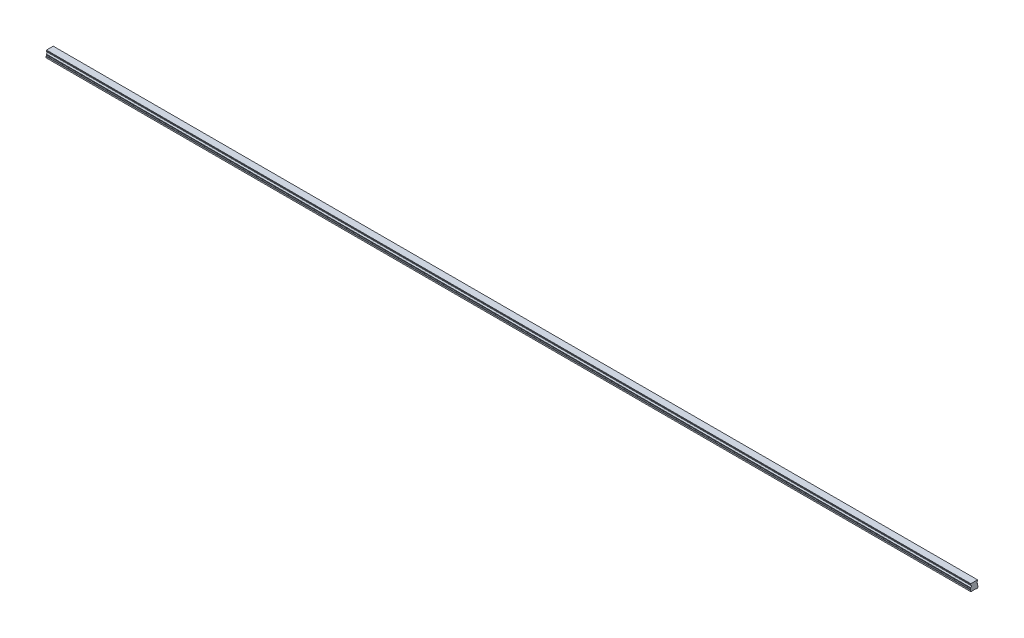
ISO-10303-21;
HEADER;
FILE_DESCRIPTION(('STEP AP214'),'2;1');
FILE_NAME('part.step','',(''),(''),'','','');
FILE_SCHEMA(('AUTOMOTIVE_DESIGN { 1 0 10303 214 1 1 1 1 }'));
ENDSEC;
DATA;
#1=APPLICATION_CONTEXT('core data for automotive mechanical design processes');
#2=APPLICATION_PROTOCOL_DEFINITION('international standard','automotive_design',2000,#1);
#3=PRODUCT_CONTEXT('',#1,'mechanical');
#4=PRODUCT('Part','Part','',(#3));
#5=PRODUCT_RELATED_PRODUCT_CATEGORY('part','',(#4));
#6=PRODUCT_DEFINITION_FORMATION('','',#4);
#7=PRODUCT_DEFINITION_CONTEXT('part definition',#1,'design');
#8=PRODUCT_DEFINITION('design','',#6,#7);
#9=PRODUCT_DEFINITION_SHAPE('','',#8);
#10=(LENGTH_UNIT() NAMED_UNIT(*) SI_UNIT(.MILLI.,.METRE.));
#11=(NAMED_UNIT(*) PLANE_ANGLE_UNIT() SI_UNIT($,.RADIAN.));
#12=(NAMED_UNIT(*) SI_UNIT($,.STERADIAN.) SOLID_ANGLE_UNIT());
#13=UNCERTAINTY_MEASURE_WITH_UNIT(LENGTH_MEASURE(1.E-05),#10,'distance_accuracy_value','');
#14=(GEOMETRIC_REPRESENTATION_CONTEXT(3) GLOBAL_UNCERTAINTY_ASSIGNED_CONTEXT((#13)) GLOBAL_UNIT_ASSIGNED_CONTEXT((#10,
#11,#12)) REPRESENTATION_CONTEXT('',''));
#15=CARTESIAN_POINT('',(0.,0.,0.));
#16=DIRECTION('',(0.,0.,1.));
#17=DIRECTION('',(1.,0.,0.));
#18=AXIS2_PLACEMENT_3D('',#15,#16,#17);
#19=CARTESIAN_POINT('',(1770.,0.399999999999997,0.));
#20=DIRECTION('',(0.,-1.,0.));
#21=DIRECTION('',(0.,0.,-1.));
#22=AXIS2_PLACEMENT_3D('',#19,#20,#21);
#23=CONICAL_SURFACE('',#22,2.8999999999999,0.785398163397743);
#24=CARTESIAN_POINT('',(1770.,0.799999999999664,0.));
#25=DIRECTION('',(0.,1.,0.));
#26=DIRECTION('',(0.,0.,1.));
#27=AXIS2_PLACEMENT_3D('',#24,#25,#26);
#28=CIRCLE('',#27,2.5);
#29=CARTESIAN_POINT('',(1770.,0.799999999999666,2.5));
#30=VERTEX_POINT('',#29);
#31=EDGE_CURVE('E11',#30,#30,#28,.F.);
#32=ORIENTED_EDGE('',*,*,#31,.F.);
#33=EDGE_LOOP('',(#32));
#34=FACE_BOUND('',#33,.T.);
#35=CARTESIAN_POINT('',(1770.,0.399999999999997,0.));
#36=DIRECTION('',(0.,1.,0.));
#37=DIRECTION('',(0.,0.,1.));
#38=AXIS2_PLACEMENT_3D('',#35,#36,#37);
#39=CIRCLE('',#38,2.89999999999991);
#40=CARTESIAN_POINT('',(1770.,0.399999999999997,2.89999999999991));
#41=VERTEX_POINT('',#40);
#42=EDGE_CURVE('E757',#41,#41,#39,.T.);
#43=ORIENTED_EDGE('',*,*,#42,.F.);
#44=EDGE_LOOP('',(#43));
#45=FACE_BOUND('',#44,.T.);
#46=ADVANCED_FACE('F39',(#34,#45),#23,.F.);
#47=CARTESIAN_POINT('',(1770.,7.,0.));
#48=DIRECTION('',(0.,-1.,0.));
#49=DIRECTION('',(0.,0.,-1.));
#50=AXIS2_PLACEMENT_3D('',#47,#48,#49);
#51=CYLINDRICAL_SURFACE('',#50,2.5);
#52=ORIENTED_EDGE('',*,*,#31,.T.);
#53=EDGE_LOOP('',(#52));
#54=FACE_BOUND('',#53,.T.);
#55=CARTESIAN_POINT('',(1770.,7.,0.));
#56=DIRECTION('',(0.,-1.,0.));
#57=DIRECTION('',(0.,0.,-1.));
#58=AXIS2_PLACEMENT_3D('',#55,#56,#57);
#59=CIRCLE('',#58,2.5);
#60=CARTESIAN_POINT('',(1770.,7.,-2.50000000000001));
#61=VERTEX_POINT('',#60);
#62=EDGE_CURVE('E49',#61,#61,#59,.T.);
#63=ORIENTED_EDGE('',*,*,#62,.F.);
#64=EDGE_LOOP('',(#63));
#65=FACE_BOUND('',#64,.T.);
#66=ADVANCED_FACE('F1031',(#54,#65),#51,.F.);
#67=CARTESIAN_POINT('',(1770.,7.,0.));
#68=DIRECTION('',(0.,-1.,0.));
#69=DIRECTION('',(0.,0.,-1.));
#70=AXIS2_PLACEMENT_3D('',#67,#68,#69);
#71=PLANE('',#70);
#72=CARTESIAN_POINT('',(1770.,7.,0.));
#73=DIRECTION('',(0.,-1.,0.));
#74=DIRECTION('',(0.,0.,-1.));
#75=AXIS2_PLACEMENT_3D('',#72,#73,#74);
#76=CIRCLE('',#75,2.1);
#77=CARTESIAN_POINT('',(1770.,7.,-2.1));
#78=VERTEX_POINT('',#77);
#79=EDGE_CURVE('E42',#78,#78,#76,.T.);
#80=ORIENTED_EDGE('',*,*,#79,.F.);
#81=EDGE_LOOP('',(#80));
#82=FACE_BOUND('',#81,.T.);
#83=ORIENTED_EDGE('',*,*,#62,.T.);
#84=EDGE_LOOP('',(#83));
#85=FACE_BOUND('',#84,.T.);
#86=ADVANCED_FACE('F1036',(#82,#85),#71,.T.);
#87=CARTESIAN_POINT('',(1710.,0.399999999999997,0.));
#88=DIRECTION('',(0.,-1.,0.));
#89=DIRECTION('',(0.,0.,-1.));
#90=AXIS2_PLACEMENT_3D('',#87,#88,#89);
#91=CONICAL_SURFACE('',#90,2.8999999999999,0.785398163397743);
#92=CARTESIAN_POINT('',(1710.,0.799999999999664,0.));
#93=DIRECTION('',(0.,1.,0.));
#94=DIRECTION('',(0.,0.,1.));
#95=AXIS2_PLACEMENT_3D('',#92,#93,#94);
#96=CIRCLE('',#95,2.5);
#97=CARTESIAN_POINT('',(1710.,0.799999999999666,2.5));
#98=VERTEX_POINT('',#97);
#99=EDGE_CURVE('E753',#98,#98,#96,.F.);
#100=ORIENTED_EDGE('',*,*,#99,.F.);
#101=EDGE_LOOP('',(#100));
#102=FACE_BOUND('',#101,.T.);
#103=CARTESIAN_POINT('',(1710.,0.399999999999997,0.));
#104=DIRECTION('',(0.,1.,0.));
#105=DIRECTION('',(0.,0.,1.));
#106=AXIS2_PLACEMENT_3D('',#103,#104,#105);
#107=CIRCLE('',#106,2.89999999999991);
#108=CARTESIAN_POINT('',(1710.,0.399999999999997,2.89999999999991));
#109=VERTEX_POINT('',#108);
#110=EDGE_CURVE('E745',#109,#109,#107,.T.);
#111=ORIENTED_EDGE('',*,*,#110,.F.);
#112=EDGE_LOOP('',(#111));
#113=FACE_BOUND('',#112,.T.);
#114=ADVANCED_FACE('F1435',(#102,#113),#91,.F.);
#115=CARTESIAN_POINT('',(1710.,7.,0.));
#116=DIRECTION('',(0.,-1.,0.));
#117=DIRECTION('',(0.,0.,-1.));
#118=AXIS2_PLACEMENT_3D('',#115,#116,#117);
#119=CYLINDRICAL_SURFACE('',#118,2.5);
#120=ORIENTED_EDGE('',*,*,#99,.T.);
#121=EDGE_LOOP('',(#120));
#122=FACE_BOUND('',#121,.T.);
#123=CARTESIAN_POINT('',(1710.,7.,0.));
#124=DIRECTION('',(0.,-1.,0.));
#125=DIRECTION('',(0.,0.,-1.));
#126=AXIS2_PLACEMENT_3D('',#123,#124,#125);
#127=CIRCLE('',#126,2.5);
#128=CARTESIAN_POINT('',(1710.,7.,-2.50000000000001));
#129=VERTEX_POINT('',#128);
#130=EDGE_CURVE('E749',#129,#129,#127,.T.);
#131=ORIENTED_EDGE('',*,*,#130,.F.);
#132=EDGE_LOOP('',(#131));
#133=FACE_BOUND('',#132,.T.);
#134=ADVANCED_FACE('F1431',(#122,#133),#119,.F.);
#135=CARTESIAN_POINT('',(1710.,7.,0.));
#136=DIRECTION('',(0.,-1.,0.));
#137=DIRECTION('',(0.,0.,-1.));
#138=AXIS2_PLACEMENT_3D('',#135,#136,#137);
#139=PLANE('',#138);
#140=CARTESIAN_POINT('',(1710.,7.,0.));
#141=DIRECTION('',(0.,-1.,0.));
#142=DIRECTION('',(0.,0.,-1.));
#143=AXIS2_PLACEMENT_3D('',#140,#141,#142);
#144=CIRCLE('',#143,2.1);
#145=CARTESIAN_POINT('',(1710.,7.,-2.1));
#146=VERTEX_POINT('',#145);
#147=EDGE_CURVE('E872',#146,#146,#144,.T.);
#148=ORIENTED_EDGE('',*,*,#147,.F.);
#149=EDGE_LOOP('',(#148));
#150=FACE_BOUND('',#149,.T.);
#151=ORIENTED_EDGE('',*,*,#130,.T.);
#152=EDGE_LOOP('',(#151));
#153=FACE_BOUND('',#152,.T.);
#154=ADVANCED_FACE('F1427',(#150,#153),#139,.T.);
#155=CARTESIAN_POINT('',(1650.,0.399999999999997,0.));
#156=DIRECTION('',(0.,-1.,0.));
#157=DIRECTION('',(0.,0.,-1.));
#158=AXIS2_PLACEMENT_3D('',#155,#156,#157);
#159=CONICAL_SURFACE('',#158,2.8999999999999,0.785398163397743);
#160=CARTESIAN_POINT('',(1650.,0.799999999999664,0.));
#161=DIRECTION('',(0.,1.,0.));
#162=DIRECTION('',(0.,0.,1.));
#163=AXIS2_PLACEMENT_3D('',#160,#161,#162);
#164=CIRCLE('',#163,2.5);
#165=CARTESIAN_POINT('',(1650.,0.799999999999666,2.5));
#166=VERTEX_POINT('',#165);
#167=EDGE_CURVE('E741',#166,#166,#164,.F.);
#168=ORIENTED_EDGE('',*,*,#167,.F.);
#169=EDGE_LOOP('',(#168));
#170=FACE_BOUND('',#169,.T.);
#171=CARTESIAN_POINT('',(1650.,0.399999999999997,0.));
#172=DIRECTION('',(0.,1.,0.));
#173=DIRECTION('',(0.,0.,1.));
#174=AXIS2_PLACEMENT_3D('',#171,#172,#173);
#175=CIRCLE('',#174,2.89999999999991);
#176=CARTESIAN_POINT('',(1650.,0.399999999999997,2.89999999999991));
#177=VERTEX_POINT('',#176);
#178=EDGE_CURVE('E733',#177,#177,#175,.T.);
#179=ORIENTED_EDGE('',*,*,#178,.F.);
#180=EDGE_LOOP('',(#179));
#181=FACE_BOUND('',#180,.T.);
#182=ADVANCED_FACE('F1423',(#170,#181),#159,.F.);
#183=CARTESIAN_POINT('',(1650.,7.,0.));
#184=DIRECTION('',(0.,-1.,0.));
#185=DIRECTION('',(0.,0.,-1.));
#186=AXIS2_PLACEMENT_3D('',#183,#184,#185);
#187=CYLINDRICAL_SURFACE('',#186,2.5);
#188=ORIENTED_EDGE('',*,*,#167,.T.);
#189=EDGE_LOOP('',(#188));
#190=FACE_BOUND('',#189,.T.);
#191=CARTESIAN_POINT('',(1650.,7.,0.));
#192=DIRECTION('',(0.,-1.,0.));
#193=DIRECTION('',(0.,0.,-1.));
#194=AXIS2_PLACEMENT_3D('',#191,#192,#193);
#195=CIRCLE('',#194,2.5);
#196=CARTESIAN_POINT('',(1650.,7.,-2.50000000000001));
#197=VERTEX_POINT('',#196);
#198=EDGE_CURVE('E737',#197,#197,#195,.T.);
#199=ORIENTED_EDGE('',*,*,#198,.F.);
#200=EDGE_LOOP('',(#199));
#201=FACE_BOUND('',#200,.T.);
#202=ADVANCED_FACE('F1419',(#190,#201),#187,.F.);
#203=CARTESIAN_POINT('',(1650.,7.,0.));
#204=DIRECTION('',(0.,-1.,0.));
#205=DIRECTION('',(0.,0.,-1.));
#206=AXIS2_PLACEMENT_3D('',#203,#204,#205);
#207=PLANE('',#206);
#208=CARTESIAN_POINT('',(1650.,7.,0.));
#209=DIRECTION('',(0.,-1.,0.));
#210=DIRECTION('',(0.,0.,-1.));
#211=AXIS2_PLACEMENT_3D('',#208,#209,#210);
#212=CIRCLE('',#211,2.1);
#213=CARTESIAN_POINT('',(1650.,7.,-2.1));
#214=VERTEX_POINT('',#213);
#215=EDGE_CURVE('E869',#214,#214,#212,.T.);
#216=ORIENTED_EDGE('',*,*,#215,.F.);
#217=EDGE_LOOP('',(#216));
#218=FACE_BOUND('',#217,.T.);
#219=ORIENTED_EDGE('',*,*,#198,.T.);
#220=EDGE_LOOP('',(#219));
#221=FACE_BOUND('',#220,.T.);
#222=ADVANCED_FACE('F1415',(#218,#221),#207,.T.);
#223=CARTESIAN_POINT('',(1590.,0.399999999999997,0.));
#224=DIRECTION('',(0.,-1.,0.));
#225=DIRECTION('',(0.,0.,-1.));
#226=AXIS2_PLACEMENT_3D('',#223,#224,#225);
#227=CONICAL_SURFACE('',#226,2.8999999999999,0.785398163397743);
#228=CARTESIAN_POINT('',(1590.,0.799999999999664,0.));
#229=DIRECTION('',(0.,1.,0.));
#230=DIRECTION('',(0.,0.,1.));
#231=AXIS2_PLACEMENT_3D('',#228,#229,#230);
#232=CIRCLE('',#231,2.5);
#233=CARTESIAN_POINT('',(1590.,0.799999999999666,2.5));
#234=VERTEX_POINT('',#233);
#235=EDGE_CURVE('E729',#234,#234,#232,.F.);
#236=ORIENTED_EDGE('',*,*,#235,.F.);
#237=EDGE_LOOP('',(#236));
#238=FACE_BOUND('',#237,.T.);
#239=CARTESIAN_POINT('',(1590.,0.399999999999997,0.));
#240=DIRECTION('',(0.,1.,0.));
#241=DIRECTION('',(0.,0.,1.));
#242=AXIS2_PLACEMENT_3D('',#239,#240,#241);
#243=CIRCLE('',#242,2.89999999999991);
#244=CARTESIAN_POINT('',(1590.,0.399999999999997,2.89999999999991));
#245=VERTEX_POINT('',#244);
#246=EDGE_CURVE('E721',#245,#245,#243,.T.);
#247=ORIENTED_EDGE('',*,*,#246,.F.);
#248=EDGE_LOOP('',(#247));
#249=FACE_BOUND('',#248,.T.);
#250=ADVANCED_FACE('F1411',(#238,#249),#227,.F.);
#251=CARTESIAN_POINT('',(1590.,7.,0.));
#252=DIRECTION('',(0.,-1.,0.));
#253=DIRECTION('',(0.,0.,-1.));
#254=AXIS2_PLACEMENT_3D('',#251,#252,#253);
#255=CYLINDRICAL_SURFACE('',#254,2.5);
#256=ORIENTED_EDGE('',*,*,#235,.T.);
#257=EDGE_LOOP('',(#256));
#258=FACE_BOUND('',#257,.T.);
#259=CARTESIAN_POINT('',(1590.,7.,0.));
#260=DIRECTION('',(0.,-1.,0.));
#261=DIRECTION('',(0.,0.,-1.));
#262=AXIS2_PLACEMENT_3D('',#259,#260,#261);
#263=CIRCLE('',#262,2.5);
#264=CARTESIAN_POINT('',(1590.,7.,-2.50000000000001));
#265=VERTEX_POINT('',#264);
#266=EDGE_CURVE('E725',#265,#265,#263,.T.);
#267=ORIENTED_EDGE('',*,*,#266,.F.);
#268=EDGE_LOOP('',(#267));
#269=FACE_BOUND('',#268,.T.);
#270=ADVANCED_FACE('F1407',(#258,#269),#255,.F.);
#271=CARTESIAN_POINT('',(1590.,7.,0.));
#272=DIRECTION('',(0.,-1.,0.));
#273=DIRECTION('',(0.,0.,-1.));
#274=AXIS2_PLACEMENT_3D('',#271,#272,#273);
#275=PLANE('',#274);
#276=CARTESIAN_POINT('',(1590.,7.,0.));
#277=DIRECTION('',(0.,-1.,0.));
#278=DIRECTION('',(0.,0.,-1.));
#279=AXIS2_PLACEMENT_3D('',#276,#277,#278);
#280=CIRCLE('',#279,2.1);
#281=CARTESIAN_POINT('',(1590.,7.,-2.1));
#282=VERTEX_POINT('',#281);
#283=EDGE_CURVE('E865',#282,#282,#280,.T.);
#284=ORIENTED_EDGE('',*,*,#283,.F.);
#285=EDGE_LOOP('',(#284));
#286=FACE_BOUND('',#285,.T.);
#287=ORIENTED_EDGE('',*,*,#266,.T.);
#288=EDGE_LOOP('',(#287));
#289=FACE_BOUND('',#288,.T.);
#290=ADVANCED_FACE('F1403',(#286,#289),#275,.T.);
#291=CARTESIAN_POINT('',(1530.,0.399999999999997,0.));
#292=DIRECTION('',(0.,-1.,0.));
#293=DIRECTION('',(0.,0.,-1.));
#294=AXIS2_PLACEMENT_3D('',#291,#292,#293);
#295=CONICAL_SURFACE('',#294,2.8999999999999,0.785398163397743);
#296=CARTESIAN_POINT('',(1530.,0.799999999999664,0.));
#297=DIRECTION('',(0.,1.,0.));
#298=DIRECTION('',(0.,0.,1.));
#299=AXIS2_PLACEMENT_3D('',#296,#297,#298);
#300=CIRCLE('',#299,2.5);
#301=CARTESIAN_POINT('',(1530.,0.799999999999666,2.5));
#302=VERTEX_POINT('',#301);
#303=EDGE_CURVE('E717',#302,#302,#300,.F.);
#304=ORIENTED_EDGE('',*,*,#303,.F.);
#305=EDGE_LOOP('',(#304));
#306=FACE_BOUND('',#305,.T.);
#307=CARTESIAN_POINT('',(1530.,0.399999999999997,0.));
#308=DIRECTION('',(0.,1.,0.));
#309=DIRECTION('',(0.,0.,1.));
#310=AXIS2_PLACEMENT_3D('',#307,#308,#309);
#311=CIRCLE('',#310,2.89999999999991);
#312=CARTESIAN_POINT('',(1530.,0.399999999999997,2.89999999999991));
#313=VERTEX_POINT('',#312);
#314=EDGE_CURVE('E709',#313,#313,#311,.T.);
#315=ORIENTED_EDGE('',*,*,#314,.F.);
#316=EDGE_LOOP('',(#315));
#317=FACE_BOUND('',#316,.T.);
#318=ADVANCED_FACE('F1399',(#306,#317),#295,.F.);
#319=CARTESIAN_POINT('',(1530.,7.,0.));
#320=DIRECTION('',(0.,-1.,0.));
#321=DIRECTION('',(0.,0.,-1.));
#322=AXIS2_PLACEMENT_3D('',#319,#320,#321);
#323=CYLINDRICAL_SURFACE('',#322,2.5);
#324=ORIENTED_EDGE('',*,*,#303,.T.);
#325=EDGE_LOOP('',(#324));
#326=FACE_BOUND('',#325,.T.);
#327=CARTESIAN_POINT('',(1530.,7.,0.));
#328=DIRECTION('',(0.,-1.,0.));
#329=DIRECTION('',(0.,0.,-1.));
#330=AXIS2_PLACEMENT_3D('',#327,#328,#329);
#331=CIRCLE('',#330,2.5);
#332=CARTESIAN_POINT('',(1530.,7.,-2.50000000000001));
#333=VERTEX_POINT('',#332);
#334=EDGE_CURVE('E713',#333,#333,#331,.T.);
#335=ORIENTED_EDGE('',*,*,#334,.F.);
#336=EDGE_LOOP('',(#335));
#337=FACE_BOUND('',#336,.T.);
#338=ADVANCED_FACE('F1395',(#326,#337),#323,.F.);
#339=CARTESIAN_POINT('',(1530.,7.,0.));
#340=DIRECTION('',(0.,-1.,0.));
#341=DIRECTION('',(0.,0.,-1.));
#342=AXIS2_PLACEMENT_3D('',#339,#340,#341);
#343=PLANE('',#342);
#344=CARTESIAN_POINT('',(1530.,7.,0.));
#345=DIRECTION('',(0.,-1.,0.));
#346=DIRECTION('',(0.,0.,-1.));
#347=AXIS2_PLACEMENT_3D('',#344,#345,#346);
#348=CIRCLE('',#347,2.1);
#349=CARTESIAN_POINT('',(1530.,7.,-2.1));
#350=VERTEX_POINT('',#349);
#351=EDGE_CURVE('E861',#350,#350,#348,.T.);
#352=ORIENTED_EDGE('',*,*,#351,.F.);
#353=EDGE_LOOP('',(#352));
#354=FACE_BOUND('',#353,.T.);
#355=ORIENTED_EDGE('',*,*,#334,.T.);
#356=EDGE_LOOP('',(#355));
#357=FACE_BOUND('',#356,.T.);
#358=ADVANCED_FACE('F1391',(#354,#357),#343,.T.);
#359=CARTESIAN_POINT('',(1470.,0.399999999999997,0.));
#360=DIRECTION('',(0.,-1.,0.));
#361=DIRECTION('',(0.,0.,-1.));
#362=AXIS2_PLACEMENT_3D('',#359,#360,#361);
#363=CONICAL_SURFACE('',#362,2.8999999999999,0.785398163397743);
#364=CARTESIAN_POINT('',(1470.,0.799999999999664,0.));
#365=DIRECTION('',(0.,1.,0.));
#366=DIRECTION('',(0.,0.,1.));
#367=AXIS2_PLACEMENT_3D('',#364,#365,#366);
#368=CIRCLE('',#367,2.5);
#369=CARTESIAN_POINT('',(1470.,0.799999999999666,2.5));
#370=VERTEX_POINT('',#369);
#371=EDGE_CURVE('E705',#370,#370,#368,.F.);
#372=ORIENTED_EDGE('',*,*,#371,.F.);
#373=EDGE_LOOP('',(#372));
#374=FACE_BOUND('',#373,.T.);
#375=CARTESIAN_POINT('',(1470.,0.399999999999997,0.));
#376=DIRECTION('',(0.,1.,0.));
#377=DIRECTION('',(0.,0.,1.));
#378=AXIS2_PLACEMENT_3D('',#375,#376,#377);
#379=CIRCLE('',#378,2.89999999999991);
#380=CARTESIAN_POINT('',(1470.,0.399999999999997,2.89999999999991));
#381=VERTEX_POINT('',#380);
#382=EDGE_CURVE('E697',#381,#381,#379,.T.);
#383=ORIENTED_EDGE('',*,*,#382,.F.);
#384=EDGE_LOOP('',(#383));
#385=FACE_BOUND('',#384,.T.);
#386=ADVANCED_FACE('F1387',(#374,#385),#363,.F.);
#387=CARTESIAN_POINT('',(1470.,7.,0.));
#388=DIRECTION('',(0.,-1.,0.));
#389=DIRECTION('',(0.,0.,-1.));
#390=AXIS2_PLACEMENT_3D('',#387,#388,#389);
#391=CYLINDRICAL_SURFACE('',#390,2.5);
#392=ORIENTED_EDGE('',*,*,#371,.T.);
#393=EDGE_LOOP('',(#392));
#394=FACE_BOUND('',#393,.T.);
#395=CARTESIAN_POINT('',(1470.,7.,0.));
#396=DIRECTION('',(0.,-1.,0.));
#397=DIRECTION('',(0.,0.,-1.));
#398=AXIS2_PLACEMENT_3D('',#395,#396,#397);
#399=CIRCLE('',#398,2.5);
#400=CARTESIAN_POINT('',(1470.,7.,-2.50000000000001));
#401=VERTEX_POINT('',#400);
#402=EDGE_CURVE('E701',#401,#401,#399,.T.);
#403=ORIENTED_EDGE('',*,*,#402,.F.);
#404=EDGE_LOOP('',(#403));
#405=FACE_BOUND('',#404,.T.);
#406=ADVANCED_FACE('F1383',(#394,#405),#391,.F.);
#407=CARTESIAN_POINT('',(1470.,7.,0.));
#408=DIRECTION('',(0.,-1.,0.));
#409=DIRECTION('',(0.,0.,-1.));
#410=AXIS2_PLACEMENT_3D('',#407,#408,#409);
#411=PLANE('',#410);
#412=CARTESIAN_POINT('',(1470.,7.,0.));
#413=DIRECTION('',(0.,-1.,0.));
#414=DIRECTION('',(0.,0.,-1.));
#415=AXIS2_PLACEMENT_3D('',#412,#413,#414);
#416=CIRCLE('',#415,2.1);
#417=CARTESIAN_POINT('',(1470.,7.,-2.1));
#418=VERTEX_POINT('',#417);
#419=EDGE_CURVE('E857',#418,#418,#416,.T.);
#420=ORIENTED_EDGE('',*,*,#419,.F.);
#421=EDGE_LOOP('',(#420));
#422=FACE_BOUND('',#421,.T.);
#423=ORIENTED_EDGE('',*,*,#402,.T.);
#424=EDGE_LOOP('',(#423));
#425=FACE_BOUND('',#424,.T.);
#426=ADVANCED_FACE('F1379',(#422,#425),#411,.T.);
#427=CARTESIAN_POINT('',(1410.,0.399999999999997,0.));
#428=DIRECTION('',(0.,-1.,0.));
#429=DIRECTION('',(0.,0.,-1.));
#430=AXIS2_PLACEMENT_3D('',#427,#428,#429);
#431=CONICAL_SURFACE('',#430,2.8999999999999,0.785398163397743);
#432=CARTESIAN_POINT('',(1410.,0.799999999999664,0.));
#433=DIRECTION('',(0.,1.,0.));
#434=DIRECTION('',(0.,0.,1.));
#435=AXIS2_PLACEMENT_3D('',#432,#433,#434);
#436=CIRCLE('',#435,2.5);
#437=CARTESIAN_POINT('',(1410.,0.799999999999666,2.5));
#438=VERTEX_POINT('',#437);
#439=EDGE_CURVE('E693',#438,#438,#436,.F.);
#440=ORIENTED_EDGE('',*,*,#439,.F.);
#441=EDGE_LOOP('',(#440));
#442=FACE_BOUND('',#441,.T.);
#443=CARTESIAN_POINT('',(1410.,0.399999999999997,0.));
#444=DIRECTION('',(0.,1.,0.));
#445=DIRECTION('',(0.,0.,1.));
#446=AXIS2_PLACEMENT_3D('',#443,#444,#445);
#447=CIRCLE('',#446,2.89999999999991);
#448=CARTESIAN_POINT('',(1410.,0.399999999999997,2.89999999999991));
#449=VERTEX_POINT('',#448);
#450=EDGE_CURVE('E685',#449,#449,#447,.T.);
#451=ORIENTED_EDGE('',*,*,#450,.F.);
#452=EDGE_LOOP('',(#451));
#453=FACE_BOUND('',#452,.T.);
#454=ADVANCED_FACE('F1375',(#442,#453),#431,.F.);
#455=CARTESIAN_POINT('',(1410.,7.,0.));
#456=DIRECTION('',(0.,-1.,0.));
#457=DIRECTION('',(0.,0.,-1.));
#458=AXIS2_PLACEMENT_3D('',#455,#456,#457);
#459=CYLINDRICAL_SURFACE('',#458,2.5);
#460=ORIENTED_EDGE('',*,*,#439,.T.);
#461=EDGE_LOOP('',(#460));
#462=FACE_BOUND('',#461,.T.);
#463=CARTESIAN_POINT('',(1410.,7.,0.));
#464=DIRECTION('',(0.,-1.,0.));
#465=DIRECTION('',(0.,0.,-1.));
#466=AXIS2_PLACEMENT_3D('',#463,#464,#465);
#467=CIRCLE('',#466,2.5);
#468=CARTESIAN_POINT('',(1410.,7.,-2.50000000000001));
#469=VERTEX_POINT('',#468);
#470=EDGE_CURVE('E689',#469,#469,#467,.T.);
#471=ORIENTED_EDGE('',*,*,#470,.F.);
#472=EDGE_LOOP('',(#471));
#473=FACE_BOUND('',#472,.T.);
#474=ADVANCED_FACE('F1371',(#462,#473),#459,.F.);
#475=CARTESIAN_POINT('',(1410.,7.,0.));
#476=DIRECTION('',(0.,-1.,0.));
#477=DIRECTION('',(0.,0.,-1.));
#478=AXIS2_PLACEMENT_3D('',#475,#476,#477);
#479=PLANE('',#478);
#480=CARTESIAN_POINT('',(1410.,7.,0.));
#481=DIRECTION('',(0.,-1.,0.));
#482=DIRECTION('',(0.,0.,-1.));
#483=AXIS2_PLACEMENT_3D('',#480,#481,#482);
#484=CIRCLE('',#483,2.1);
#485=CARTESIAN_POINT('',(1410.,7.,-2.1));
#486=VERTEX_POINT('',#485);
#487=EDGE_CURVE('E853',#486,#486,#484,.T.);
#488=ORIENTED_EDGE('',*,*,#487,.F.);
#489=EDGE_LOOP('',(#488));
#490=FACE_BOUND('',#489,.T.);
#491=ORIENTED_EDGE('',*,*,#470,.T.);
#492=EDGE_LOOP('',(#491));
#493=FACE_BOUND('',#492,.T.);
#494=ADVANCED_FACE('F1367',(#490,#493),#479,.T.);
#495=CARTESIAN_POINT('',(1350.,0.399999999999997,0.));
#496=DIRECTION('',(0.,-1.,0.));
#497=DIRECTION('',(0.,0.,-1.));
#498=AXIS2_PLACEMENT_3D('',#495,#496,#497);
#499=CONICAL_SURFACE('',#498,2.8999999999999,0.785398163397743);
#500=CARTESIAN_POINT('',(1350.,0.799999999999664,0.));
#501=DIRECTION('',(0.,1.,0.));
#502=DIRECTION('',(0.,0.,1.));
#503=AXIS2_PLACEMENT_3D('',#500,#501,#502);
#504=CIRCLE('',#503,2.5);
#505=CARTESIAN_POINT('',(1350.,0.799999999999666,2.5));
#506=VERTEX_POINT('',#505);
#507=EDGE_CURVE('E681',#506,#506,#504,.F.);
#508=ORIENTED_EDGE('',*,*,#507,.F.);
#509=EDGE_LOOP('',(#508));
#510=FACE_BOUND('',#509,.T.);
#511=CARTESIAN_POINT('',(1350.,0.399999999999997,0.));
#512=DIRECTION('',(0.,1.,0.));
#513=DIRECTION('',(0.,0.,1.));
#514=AXIS2_PLACEMENT_3D('',#511,#512,#513);
#515=CIRCLE('',#514,2.89999999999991);
#516=CARTESIAN_POINT('',(1350.,0.399999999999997,2.89999999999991));
#517=VERTEX_POINT('',#516);
#518=EDGE_CURVE('E673',#517,#517,#515,.T.);
#519=ORIENTED_EDGE('',*,*,#518,.F.);
#520=EDGE_LOOP('',(#519));
#521=FACE_BOUND('',#520,.T.);
#522=ADVANCED_FACE('F1363',(#510,#521),#499,.F.);
#523=CARTESIAN_POINT('',(1350.,7.,0.));
#524=DIRECTION('',(0.,-1.,0.));
#525=DIRECTION('',(0.,0.,-1.));
#526=AXIS2_PLACEMENT_3D('',#523,#524,#525);
#527=CYLINDRICAL_SURFACE('',#526,2.5);
#528=ORIENTED_EDGE('',*,*,#507,.T.);
#529=EDGE_LOOP('',(#528));
#530=FACE_BOUND('',#529,.T.);
#531=CARTESIAN_POINT('',(1350.,7.,0.));
#532=DIRECTION('',(0.,-1.,0.));
#533=DIRECTION('',(0.,0.,-1.));
#534=AXIS2_PLACEMENT_3D('',#531,#532,#533);
#535=CIRCLE('',#534,2.5);
#536=CARTESIAN_POINT('',(1350.,7.,-2.50000000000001));
#537=VERTEX_POINT('',#536);
#538=EDGE_CURVE('E677',#537,#537,#535,.T.);
#539=ORIENTED_EDGE('',*,*,#538,.F.);
#540=EDGE_LOOP('',(#539));
#541=FACE_BOUND('',#540,.T.);
#542=ADVANCED_FACE('F1359',(#530,#541),#527,.F.);
#543=CARTESIAN_POINT('',(1350.,7.,0.));
#544=DIRECTION('',(0.,-1.,0.));
#545=DIRECTION('',(0.,0.,-1.));
#546=AXIS2_PLACEMENT_3D('',#543,#544,#545);
#547=PLANE('',#546);
#548=CARTESIAN_POINT('',(1350.,7.,0.));
#549=DIRECTION('',(0.,-1.,0.));
#550=DIRECTION('',(0.,0.,-1.));
#551=AXIS2_PLACEMENT_3D('',#548,#549,#550);
#552=CIRCLE('',#551,2.1);
#553=CARTESIAN_POINT('',(1350.,7.,-2.1));
#554=VERTEX_POINT('',#553);
#555=EDGE_CURVE('E849',#554,#554,#552,.T.);
#556=ORIENTED_EDGE('',*,*,#555,.F.);
#557=EDGE_LOOP('',(#556));
#558=FACE_BOUND('',#557,.T.);
#559=ORIENTED_EDGE('',*,*,#538,.T.);
#560=EDGE_LOOP('',(#559));
#561=FACE_BOUND('',#560,.T.);
#562=ADVANCED_FACE('F1355',(#558,#561),#547,.T.);
#563=CARTESIAN_POINT('',(1290.,0.399999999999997,0.));
#564=DIRECTION('',(0.,-1.,0.));
#565=DIRECTION('',(0.,0.,-1.));
#566=AXIS2_PLACEMENT_3D('',#563,#564,#565);
#567=CONICAL_SURFACE('',#566,2.8999999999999,0.785398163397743);
#568=CARTESIAN_POINT('',(1290.,0.799999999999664,0.));
#569=DIRECTION('',(0.,1.,0.));
#570=DIRECTION('',(0.,0.,1.));
#571=AXIS2_PLACEMENT_3D('',#568,#569,#570);
#572=CIRCLE('',#571,2.5);
#573=CARTESIAN_POINT('',(1290.,0.799999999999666,2.5));
#574=VERTEX_POINT('',#573);
#575=EDGE_CURVE('E669',#574,#574,#572,.F.);
#576=ORIENTED_EDGE('',*,*,#575,.F.);
#577=EDGE_LOOP('',(#576));
#578=FACE_BOUND('',#577,.T.);
#579=CARTESIAN_POINT('',(1290.,0.399999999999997,0.));
#580=DIRECTION('',(0.,1.,0.));
#581=DIRECTION('',(0.,0.,1.));
#582=AXIS2_PLACEMENT_3D('',#579,#580,#581);
#583=CIRCLE('',#582,2.89999999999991);
#584=CARTESIAN_POINT('',(1290.,0.399999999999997,2.89999999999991));
#585=VERTEX_POINT('',#584);
#586=EDGE_CURVE('E661',#585,#585,#583,.T.);
#587=ORIENTED_EDGE('',*,*,#586,.F.);
#588=EDGE_LOOP('',(#587));
#589=FACE_BOUND('',#588,.T.);
#590=ADVANCED_FACE('F1351',(#578,#589),#567,.F.);
#591=CARTESIAN_POINT('',(1290.,7.,0.));
#592=DIRECTION('',(0.,-1.,0.));
#593=DIRECTION('',(0.,0.,-1.));
#594=AXIS2_PLACEMENT_3D('',#591,#592,#593);
#595=CYLINDRICAL_SURFACE('',#594,2.5);
#596=ORIENTED_EDGE('',*,*,#575,.T.);
#597=EDGE_LOOP('',(#596));
#598=FACE_BOUND('',#597,.T.);
#599=CARTESIAN_POINT('',(1290.,7.,0.));
#600=DIRECTION('',(0.,-1.,0.));
#601=DIRECTION('',(0.,0.,-1.));
#602=AXIS2_PLACEMENT_3D('',#599,#600,#601);
#603=CIRCLE('',#602,2.5);
#604=CARTESIAN_POINT('',(1290.,7.,-2.50000000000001));
#605=VERTEX_POINT('',#604);
#606=EDGE_CURVE('E665',#605,#605,#603,.T.);
#607=ORIENTED_EDGE('',*,*,#606,.F.);
#608=EDGE_LOOP('',(#607));
#609=FACE_BOUND('',#608,.T.);
#610=ADVANCED_FACE('F1347',(#598,#609),#595,.F.);
#611=CARTESIAN_POINT('',(1290.,7.,0.));
#612=DIRECTION('',(0.,-1.,0.));
#613=DIRECTION('',(0.,0.,-1.));
#614=AXIS2_PLACEMENT_3D('',#611,#612,#613);
#615=PLANE('',#614);
#616=CARTESIAN_POINT('',(1290.,7.,0.));
#617=DIRECTION('',(0.,-1.,0.));
#618=DIRECTION('',(0.,0.,-1.));
#619=AXIS2_PLACEMENT_3D('',#616,#617,#618);
#620=CIRCLE('',#619,2.1);
#621=CARTESIAN_POINT('',(1290.,7.,-2.1));
#622=VERTEX_POINT('',#621);
#623=EDGE_CURVE('E845',#622,#622,#620,.T.);
#624=ORIENTED_EDGE('',*,*,#623,.F.);
#625=EDGE_LOOP('',(#624));
#626=FACE_BOUND('',#625,.T.);
#627=ORIENTED_EDGE('',*,*,#606,.T.);
#628=EDGE_LOOP('',(#627));
#629=FACE_BOUND('',#628,.T.);
#630=ADVANCED_FACE('F1343',(#626,#629),#615,.T.);
#631=CARTESIAN_POINT('',(1230.,0.399999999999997,0.));
#632=DIRECTION('',(0.,-1.,0.));
#633=DIRECTION('',(0.,0.,-1.));
#634=AXIS2_PLACEMENT_3D('',#631,#632,#633);
#635=CONICAL_SURFACE('',#634,2.8999999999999,0.785398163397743);
#636=CARTESIAN_POINT('',(1230.,0.799999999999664,0.));
#637=DIRECTION('',(0.,1.,0.));
#638=DIRECTION('',(0.,0.,1.));
#639=AXIS2_PLACEMENT_3D('',#636,#637,#638);
#640=CIRCLE('',#639,2.5);
#641=CARTESIAN_POINT('',(1230.,0.799999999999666,2.5));
#642=VERTEX_POINT('',#641);
#643=EDGE_CURVE('E657',#642,#642,#640,.F.);
#644=ORIENTED_EDGE('',*,*,#643,.F.);
#645=EDGE_LOOP('',(#644));
#646=FACE_BOUND('',#645,.T.);
#647=CARTESIAN_POINT('',(1230.,0.399999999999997,0.));
#648=DIRECTION('',(0.,1.,0.));
#649=DIRECTION('',(0.,0.,1.));
#650=AXIS2_PLACEMENT_3D('',#647,#648,#649);
#651=CIRCLE('',#650,2.89999999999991);
#652=CARTESIAN_POINT('',(1230.,0.399999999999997,2.89999999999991));
#653=VERTEX_POINT('',#652);
#654=EDGE_CURVE('E649',#653,#653,#651,.T.);
#655=ORIENTED_EDGE('',*,*,#654,.F.);
#656=EDGE_LOOP('',(#655));
#657=FACE_BOUND('',#656,.T.);
#658=ADVANCED_FACE('F1339',(#646,#657),#635,.F.);
#659=CARTESIAN_POINT('',(1230.,7.,0.));
#660=DIRECTION('',(0.,-1.,0.));
#661=DIRECTION('',(0.,0.,-1.));
#662=AXIS2_PLACEMENT_3D('',#659,#660,#661);
#663=CYLINDRICAL_SURFACE('',#662,2.5);
#664=ORIENTED_EDGE('',*,*,#643,.T.);
#665=EDGE_LOOP('',(#664));
#666=FACE_BOUND('',#665,.T.);
#667=CARTESIAN_POINT('',(1230.,7.,0.));
#668=DIRECTION('',(0.,-1.,0.));
#669=DIRECTION('',(0.,0.,-1.));
#670=AXIS2_PLACEMENT_3D('',#667,#668,#669);
#671=CIRCLE('',#670,2.5);
#672=CARTESIAN_POINT('',(1230.,7.,-2.50000000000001));
#673=VERTEX_POINT('',#672);
#674=EDGE_CURVE('E653',#673,#673,#671,.T.);
#675=ORIENTED_EDGE('',*,*,#674,.F.);
#676=EDGE_LOOP('',(#675));
#677=FACE_BOUND('',#676,.T.);
#678=ADVANCED_FACE('F1335',(#666,#677),#663,.F.);
#679=CARTESIAN_POINT('',(1230.,7.,0.));
#680=DIRECTION('',(0.,-1.,0.));
#681=DIRECTION('',(0.,0.,-1.));
#682=AXIS2_PLACEMENT_3D('',#679,#680,#681);
#683=PLANE('',#682);
#684=CARTESIAN_POINT('',(1230.,7.,0.));
#685=DIRECTION('',(0.,-1.,0.));
#686=DIRECTION('',(0.,0.,-1.));
#687=AXIS2_PLACEMENT_3D('',#684,#685,#686);
#688=CIRCLE('',#687,2.1);
#689=CARTESIAN_POINT('',(1230.,7.,-2.1));
#690=VERTEX_POINT('',#689);
#691=EDGE_CURVE('E841',#690,#690,#688,.T.);
#692=ORIENTED_EDGE('',*,*,#691,.F.);
#693=EDGE_LOOP('',(#692));
#694=FACE_BOUND('',#693,.T.);
#695=ORIENTED_EDGE('',*,*,#674,.T.);
#696=EDGE_LOOP('',(#695));
#697=FACE_BOUND('',#696,.T.);
#698=ADVANCED_FACE('F1331',(#694,#697),#683,.T.);
#699=CARTESIAN_POINT('',(1170.,0.399999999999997,0.));
#700=DIRECTION('',(0.,-1.,0.));
#701=DIRECTION('',(0.,0.,-1.));
#702=AXIS2_PLACEMENT_3D('',#699,#700,#701);
#703=CONICAL_SURFACE('',#702,2.8999999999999,0.785398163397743);
#704=CARTESIAN_POINT('',(1170.,0.799999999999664,0.));
#705=DIRECTION('',(0.,1.,0.));
#706=DIRECTION('',(0.,0.,1.));
#707=AXIS2_PLACEMENT_3D('',#704,#705,#706);
#708=CIRCLE('',#707,2.5);
#709=CARTESIAN_POINT('',(1170.,0.799999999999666,2.5));
#710=VERTEX_POINT('',#709);
#711=EDGE_CURVE('E645',#710,#710,#708,.F.);
#712=ORIENTED_EDGE('',*,*,#711,.F.);
#713=EDGE_LOOP('',(#712));
#714=FACE_BOUND('',#713,.T.);
#715=CARTESIAN_POINT('',(1170.,0.399999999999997,0.));
#716=DIRECTION('',(0.,1.,0.));
#717=DIRECTION('',(0.,0.,1.));
#718=AXIS2_PLACEMENT_3D('',#715,#716,#717);
#719=CIRCLE('',#718,2.89999999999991);
#720=CARTESIAN_POINT('',(1170.,0.399999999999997,2.89999999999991));
#721=VERTEX_POINT('',#720);
#722=EDGE_CURVE('E637',#721,#721,#719,.T.);
#723=ORIENTED_EDGE('',*,*,#722,.F.);
#724=EDGE_LOOP('',(#723));
#725=FACE_BOUND('',#724,.T.);
#726=ADVANCED_FACE('F1327',(#714,#725),#703,.F.);
#727=CARTESIAN_POINT('',(1170.,7.,0.));
#728=DIRECTION('',(0.,-1.,0.));
#729=DIRECTION('',(0.,0.,-1.));
#730=AXIS2_PLACEMENT_3D('',#727,#728,#729);
#731=CYLINDRICAL_SURFACE('',#730,2.5);
#732=ORIENTED_EDGE('',*,*,#711,.T.);
#733=EDGE_LOOP('',(#732));
#734=FACE_BOUND('',#733,.T.);
#735=CARTESIAN_POINT('',(1170.,7.,0.));
#736=DIRECTION('',(0.,-1.,0.));
#737=DIRECTION('',(0.,0.,-1.));
#738=AXIS2_PLACEMENT_3D('',#735,#736,#737);
#739=CIRCLE('',#738,2.5);
#740=CARTESIAN_POINT('',(1170.,7.,-2.50000000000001));
#741=VERTEX_POINT('',#740);
#742=EDGE_CURVE('E641',#741,#741,#739,.T.);
#743=ORIENTED_EDGE('',*,*,#742,.F.);
#744=EDGE_LOOP('',(#743));
#745=FACE_BOUND('',#744,.T.);
#746=ADVANCED_FACE('F1323',(#734,#745),#731,.F.);
#747=CARTESIAN_POINT('',(1170.,7.,0.));
#748=DIRECTION('',(0.,-1.,0.));
#749=DIRECTION('',(0.,0.,-1.));
#750=AXIS2_PLACEMENT_3D('',#747,#748,#749);
#751=PLANE('',#750);
#752=CARTESIAN_POINT('',(1170.,7.,0.));
#753=DIRECTION('',(0.,-1.,0.));
#754=DIRECTION('',(0.,0.,-1.));
#755=AXIS2_PLACEMENT_3D('',#752,#753,#754);
#756=CIRCLE('',#755,2.1);
#757=CARTESIAN_POINT('',(1170.,7.,-2.1));
#758=VERTEX_POINT('',#757);
#759=EDGE_CURVE('E837',#758,#758,#756,.T.);
#760=ORIENTED_EDGE('',*,*,#759,.F.);
#761=EDGE_LOOP('',(#760));
#762=FACE_BOUND('',#761,.T.);
#763=ORIENTED_EDGE('',*,*,#742,.T.);
#764=EDGE_LOOP('',(#763));
#765=FACE_BOUND('',#764,.T.);
#766=ADVANCED_FACE('F1319',(#762,#765),#751,.T.);
#767=CARTESIAN_POINT('',(1110.,0.399999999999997,0.));
#768=DIRECTION('',(0.,-1.,0.));
#769=DIRECTION('',(0.,0.,-1.));
#770=AXIS2_PLACEMENT_3D('',#767,#768,#769);
#771=CONICAL_SURFACE('',#770,2.8999999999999,0.785398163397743);
#772=CARTESIAN_POINT('',(1110.,0.799999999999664,0.));
#773=DIRECTION('',(0.,1.,0.));
#774=DIRECTION('',(0.,0.,1.));
#775=AXIS2_PLACEMENT_3D('',#772,#773,#774);
#776=CIRCLE('',#775,2.5);
#777=CARTESIAN_POINT('',(1110.,0.799999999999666,2.5));
#778=VERTEX_POINT('',#777);
#779=EDGE_CURVE('E633',#778,#778,#776,.F.);
#780=ORIENTED_EDGE('',*,*,#779,.F.);
#781=EDGE_LOOP('',(#780));
#782=FACE_BOUND('',#781,.T.);
#783=CARTESIAN_POINT('',(1110.,0.399999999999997,0.));
#784=DIRECTION('',(0.,1.,0.));
#785=DIRECTION('',(0.,0.,1.));
#786=AXIS2_PLACEMENT_3D('',#783,#784,#785);
#787=CIRCLE('',#786,2.89999999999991);
#788=CARTESIAN_POINT('',(1110.,0.399999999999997,2.89999999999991));
#789=VERTEX_POINT('',#788);
#790=EDGE_CURVE('E625',#789,#789,#787,.T.);
#791=ORIENTED_EDGE('',*,*,#790,.F.);
#792=EDGE_LOOP('',(#791));
#793=FACE_BOUND('',#792,.T.);
#794=ADVANCED_FACE('F1315',(#782,#793),#771,.F.);
#795=CARTESIAN_POINT('',(1110.,7.,0.));
#796=DIRECTION('',(0.,-1.,0.));
#797=DIRECTION('',(0.,0.,-1.));
#798=AXIS2_PLACEMENT_3D('',#795,#796,#797);
#799=CYLINDRICAL_SURFACE('',#798,2.5);
#800=ORIENTED_EDGE('',*,*,#779,.T.);
#801=EDGE_LOOP('',(#800));
#802=FACE_BOUND('',#801,.T.);
#803=CARTESIAN_POINT('',(1110.,7.,0.));
#804=DIRECTION('',(0.,-1.,0.));
#805=DIRECTION('',(0.,0.,-1.));
#806=AXIS2_PLACEMENT_3D('',#803,#804,#805);
#807=CIRCLE('',#806,2.5);
#808=CARTESIAN_POINT('',(1110.,7.,-2.50000000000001));
#809=VERTEX_POINT('',#808);
#810=EDGE_CURVE('E629',#809,#809,#807,.T.);
#811=ORIENTED_EDGE('',*,*,#810,.F.);
#812=EDGE_LOOP('',(#811));
#813=FACE_BOUND('',#812,.T.);
#814=ADVANCED_FACE('F1311',(#802,#813),#799,.F.);
#815=CARTESIAN_POINT('',(1110.,7.,0.));
#816=DIRECTION('',(0.,-1.,0.));
#817=DIRECTION('',(0.,0.,-1.));
#818=AXIS2_PLACEMENT_3D('',#815,#816,#817);
#819=PLANE('',#818);
#820=CARTESIAN_POINT('',(1110.,7.,0.));
#821=DIRECTION('',(0.,-1.,0.));
#822=DIRECTION('',(0.,0.,-1.));
#823=AXIS2_PLACEMENT_3D('',#820,#821,#822);
#824=CIRCLE('',#823,2.1);
#825=CARTESIAN_POINT('',(1110.,7.,-2.1));
#826=VERTEX_POINT('',#825);
#827=EDGE_CURVE('E833',#826,#826,#824,.T.);
#828=ORIENTED_EDGE('',*,*,#827,.F.);
#829=EDGE_LOOP('',(#828));
#830=FACE_BOUND('',#829,.T.);
#831=ORIENTED_EDGE('',*,*,#810,.T.);
#832=EDGE_LOOP('',(#831));
#833=FACE_BOUND('',#832,.T.);
#834=ADVANCED_FACE('F1307',(#830,#833),#819,.T.);
#835=CARTESIAN_POINT('',(1050.,0.399999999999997,0.));
#836=DIRECTION('',(0.,-1.,0.));
#837=DIRECTION('',(0.,0.,-1.));
#838=AXIS2_PLACEMENT_3D('',#835,#836,#837);
#839=CONICAL_SURFACE('',#838,2.8999999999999,0.785398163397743);
#840=CARTESIAN_POINT('',(1050.,0.799999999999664,0.));
#841=DIRECTION('',(0.,1.,0.));
#842=DIRECTION('',(0.,0.,1.));
#843=AXIS2_PLACEMENT_3D('',#840,#841,#842);
#844=CIRCLE('',#843,2.5);
#845=CARTESIAN_POINT('',(1050.,0.799999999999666,2.5));
#846=VERTEX_POINT('',#845);
#847=EDGE_CURVE('E621',#846,#846,#844,.F.);
#848=ORIENTED_EDGE('',*,*,#847,.F.);
#849=EDGE_LOOP('',(#848));
#850=FACE_BOUND('',#849,.T.);
#851=CARTESIAN_POINT('',(1050.,0.399999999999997,0.));
#852=DIRECTION('',(0.,1.,0.));
#853=DIRECTION('',(0.,0.,1.));
#854=AXIS2_PLACEMENT_3D('',#851,#852,#853);
#855=CIRCLE('',#854,2.89999999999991);
#856=CARTESIAN_POINT('',(1050.,0.399999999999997,2.89999999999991));
#857=VERTEX_POINT('',#856);
#858=EDGE_CURVE('E613',#857,#857,#855,.T.);
#859=ORIENTED_EDGE('',*,*,#858,.F.);
#860=EDGE_LOOP('',(#859));
#861=FACE_BOUND('',#860,.T.);
#862=ADVANCED_FACE('F1303',(#850,#861),#839,.F.);
#863=CARTESIAN_POINT('',(1050.,7.,0.));
#864=DIRECTION('',(0.,-1.,0.));
#865=DIRECTION('',(0.,0.,-1.));
#866=AXIS2_PLACEMENT_3D('',#863,#864,#865);
#867=CYLINDRICAL_SURFACE('',#866,2.5);
#868=ORIENTED_EDGE('',*,*,#847,.T.);
#869=EDGE_LOOP('',(#868));
#870=FACE_BOUND('',#869,.T.);
#871=CARTESIAN_POINT('',(1050.,7.,0.));
#872=DIRECTION('',(0.,-1.,0.));
#873=DIRECTION('',(0.,0.,-1.));
#874=AXIS2_PLACEMENT_3D('',#871,#872,#873);
#875=CIRCLE('',#874,2.5);
#876=CARTESIAN_POINT('',(1050.,7.,-2.50000000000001));
#877=VERTEX_POINT('',#876);
#878=EDGE_CURVE('E617',#877,#877,#875,.T.);
#879=ORIENTED_EDGE('',*,*,#878,.F.);
#880=EDGE_LOOP('',(#879));
#881=FACE_BOUND('',#880,.T.);
#882=ADVANCED_FACE('F1299',(#870,#881),#867,.F.);
#883=CARTESIAN_POINT('',(1050.,7.,0.));
#884=DIRECTION('',(0.,-1.,0.));
#885=DIRECTION('',(0.,0.,-1.));
#886=AXIS2_PLACEMENT_3D('',#883,#884,#885);
#887=PLANE('',#886);
#888=CARTESIAN_POINT('',(1050.,7.,0.));
#889=DIRECTION('',(0.,-1.,0.));
#890=DIRECTION('',(0.,0.,-1.));
#891=AXIS2_PLACEMENT_3D('',#888,#889,#890);
#892=CIRCLE('',#891,2.1);
#893=CARTESIAN_POINT('',(1050.,7.,-2.1));
#894=VERTEX_POINT('',#893);
#895=EDGE_CURVE('E829',#894,#894,#892,.T.);
#896=ORIENTED_EDGE('',*,*,#895,.F.);
#897=EDGE_LOOP('',(#896));
#898=FACE_BOUND('',#897,.T.);
#899=ORIENTED_EDGE('',*,*,#878,.T.);
#900=EDGE_LOOP('',(#899));
#901=FACE_BOUND('',#900,.T.);
#902=ADVANCED_FACE('F1295',(#898,#901),#887,.T.);
#903=CARTESIAN_POINT('',(990.,0.399999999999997,0.));
#904=DIRECTION('',(0.,-1.,0.));
#905=DIRECTION('',(0.,0.,-1.));
#906=AXIS2_PLACEMENT_3D('',#903,#904,#905);
#907=CONICAL_SURFACE('',#906,2.8999999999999,0.785398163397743);
#908=CARTESIAN_POINT('',(990.,0.799999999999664,0.));
#909=DIRECTION('',(0.,1.,0.));
#910=DIRECTION('',(0.,0.,1.));
#911=AXIS2_PLACEMENT_3D('',#908,#909,#910);
#912=CIRCLE('',#911,2.5);
#913=CARTESIAN_POINT('',(990.,0.799999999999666,2.5));
#914=VERTEX_POINT('',#913);
#915=EDGE_CURVE('E609',#914,#914,#912,.F.);
#916=ORIENTED_EDGE('',*,*,#915,.F.);
#917=EDGE_LOOP('',(#916));
#918=FACE_BOUND('',#917,.T.);
#919=CARTESIAN_POINT('',(990.,0.399999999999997,0.));
#920=DIRECTION('',(0.,1.,0.));
#921=DIRECTION('',(0.,0.,1.));
#922=AXIS2_PLACEMENT_3D('',#919,#920,#921);
#923=CIRCLE('',#922,2.89999999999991);
#924=CARTESIAN_POINT('',(990.,0.399999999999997,2.89999999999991));
#925=VERTEX_POINT('',#924);
#926=EDGE_CURVE('E601',#925,#925,#923,.T.);
#927=ORIENTED_EDGE('',*,*,#926,.F.);
#928=EDGE_LOOP('',(#927));
#929=FACE_BOUND('',#928,.T.);
#930=ADVANCED_FACE('F1291',(#918,#929),#907,.F.);
#931=CARTESIAN_POINT('',(990.,7.,0.));
#932=DIRECTION('',(0.,-1.,0.));
#933=DIRECTION('',(0.,0.,-1.));
#934=AXIS2_PLACEMENT_3D('',#931,#932,#933);
#935=CYLINDRICAL_SURFACE('',#934,2.5);
#936=ORIENTED_EDGE('',*,*,#915,.T.);
#937=EDGE_LOOP('',(#936));
#938=FACE_BOUND('',#937,.T.);
#939=CARTESIAN_POINT('',(990.,7.,0.));
#940=DIRECTION('',(0.,-1.,0.));
#941=DIRECTION('',(0.,0.,-1.));
#942=AXIS2_PLACEMENT_3D('',#939,#940,#941);
#943=CIRCLE('',#942,2.5);
#944=CARTESIAN_POINT('',(990.,7.,-2.50000000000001));
#945=VERTEX_POINT('',#944);
#946=EDGE_CURVE('E605',#945,#945,#943,.T.);
#947=ORIENTED_EDGE('',*,*,#946,.F.);
#948=EDGE_LOOP('',(#947));
#949=FACE_BOUND('',#948,.T.);
#950=ADVANCED_FACE('F1287',(#938,#949),#935,.F.);
#951=CARTESIAN_POINT('',(990.,7.,0.));
#952=DIRECTION('',(0.,-1.,0.));
#953=DIRECTION('',(0.,0.,-1.));
#954=AXIS2_PLACEMENT_3D('',#951,#952,#953);
#955=PLANE('',#954);
#956=CARTESIAN_POINT('',(990.,7.,0.));
#957=DIRECTION('',(0.,-1.,0.));
#958=DIRECTION('',(0.,0.,-1.));
#959=AXIS2_PLACEMENT_3D('',#956,#957,#958);
#960=CIRCLE('',#959,2.1);
#961=CARTESIAN_POINT('',(990.,7.,-2.1));
#962=VERTEX_POINT('',#961);
#963=EDGE_CURVE('E825',#962,#962,#960,.T.);
#964=ORIENTED_EDGE('',*,*,#963,.F.);
#965=EDGE_LOOP('',(#964));
#966=FACE_BOUND('',#965,.T.);
#967=ORIENTED_EDGE('',*,*,#946,.T.);
#968=EDGE_LOOP('',(#967));
#969=FACE_BOUND('',#968,.T.);
#970=ADVANCED_FACE('F1283',(#966,#969),#955,.T.);
#971=CARTESIAN_POINT('',(930.,0.399999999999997,0.));
#972=DIRECTION('',(0.,-1.,0.));
#973=DIRECTION('',(0.,0.,-1.));
#974=AXIS2_PLACEMENT_3D('',#971,#972,#973);
#975=CONICAL_SURFACE('',#974,2.8999999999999,0.785398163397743);
#976=CARTESIAN_POINT('',(930.,0.799999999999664,0.));
#977=DIRECTION('',(0.,1.,0.));
#978=DIRECTION('',(0.,0.,1.));
#979=AXIS2_PLACEMENT_3D('',#976,#977,#978);
#980=CIRCLE('',#979,2.5);
#981=CARTESIAN_POINT('',(930.,0.799999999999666,2.5));
#982=VERTEX_POINT('',#981);
#983=EDGE_CURVE('E597',#982,#982,#980,.F.);
#984=ORIENTED_EDGE('',*,*,#983,.F.);
#985=EDGE_LOOP('',(#984));
#986=FACE_BOUND('',#985,.T.);
#987=CARTESIAN_POINT('',(930.,0.399999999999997,0.));
#988=DIRECTION('',(0.,1.,0.));
#989=DIRECTION('',(0.,0.,1.));
#990=AXIS2_PLACEMENT_3D('',#987,#988,#989);
#991=CIRCLE('',#990,2.89999999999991);
#992=CARTESIAN_POINT('',(930.,0.399999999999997,2.89999999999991));
#993=VERTEX_POINT('',#992);
#994=EDGE_CURVE('E589',#993,#993,#991,.T.);
#995=ORIENTED_EDGE('',*,*,#994,.F.);
#996=EDGE_LOOP('',(#995));
#997=FACE_BOUND('',#996,.T.);
#998=ADVANCED_FACE('F1279',(#986,#997),#975,.F.);
#999=CARTESIAN_POINT('',(930.,7.,0.));
#1000=DIRECTION('',(0.,-1.,0.));
#1001=DIRECTION('',(0.,0.,-1.));
#1002=AXIS2_PLACEMENT_3D('',#999,#1000,#1001);
#1003=CYLINDRICAL_SURFACE('',#1002,2.5);
#1004=ORIENTED_EDGE('',*,*,#983,.T.);
#1005=EDGE_LOOP('',(#1004));
#1006=FACE_BOUND('',#1005,.T.);
#1007=CARTESIAN_POINT('',(930.,7.,0.));
#1008=DIRECTION('',(0.,-1.,0.));
#1009=DIRECTION('',(0.,0.,-1.));
#1010=AXIS2_PLACEMENT_3D('',#1007,#1008,#1009);
#1011=CIRCLE('',#1010,2.5);
#1012=CARTESIAN_POINT('',(930.,7.,-2.50000000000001));
#1013=VERTEX_POINT('',#1012);
#1014=EDGE_CURVE('E593',#1013,#1013,#1011,.T.);
#1015=ORIENTED_EDGE('',*,*,#1014,.F.);
#1016=EDGE_LOOP('',(#1015));
#1017=FACE_BOUND('',#1016,.T.);
#1018=ADVANCED_FACE('F1275',(#1006,#1017),#1003,.F.);
#1019=CARTESIAN_POINT('',(930.,7.,0.));
#1020=DIRECTION('',(0.,-1.,0.));
#1021=DIRECTION('',(0.,0.,-1.));
#1022=AXIS2_PLACEMENT_3D('',#1019,#1020,#1021);
#1023=PLANE('',#1022);
#1024=CARTESIAN_POINT('',(930.,7.,0.));
#1025=DIRECTION('',(0.,-1.,0.));
#1026=DIRECTION('',(0.,0.,-1.));
#1027=AXIS2_PLACEMENT_3D('',#1024,#1025,#1026);
#1028=CIRCLE('',#1027,2.1);
#1029=CARTESIAN_POINT('',(930.,7.,-2.1));
#1030=VERTEX_POINT('',#1029);
#1031=EDGE_CURVE('E821',#1030,#1030,#1028,.T.);
#1032=ORIENTED_EDGE('',*,*,#1031,.F.);
#1033=EDGE_LOOP('',(#1032));
#1034=FACE_BOUND('',#1033,.T.);
#1035=ORIENTED_EDGE('',*,*,#1014,.T.);
#1036=EDGE_LOOP('',(#1035));
#1037=FACE_BOUND('',#1036,.T.);
#1038=ADVANCED_FACE('F1271',(#1034,#1037),#1023,.T.);
#1039=CARTESIAN_POINT('',(870.,0.399999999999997,0.));
#1040=DIRECTION('',(0.,-1.,0.));
#1041=DIRECTION('',(0.,0.,-1.));
#1042=AXIS2_PLACEMENT_3D('',#1039,#1040,#1041);
#1043=CONICAL_SURFACE('',#1042,2.8999999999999,0.785398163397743);
#1044=CARTESIAN_POINT('',(870.,0.799999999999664,0.));
#1045=DIRECTION('',(0.,1.,0.));
#1046=DIRECTION('',(0.,0.,1.));
#1047=AXIS2_PLACEMENT_3D('',#1044,#1045,#1046);
#1048=CIRCLE('',#1047,2.5);
#1049=CARTESIAN_POINT('',(870.,0.799999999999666,2.5));
#1050=VERTEX_POINT('',#1049);
#1051=EDGE_CURVE('E585',#1050,#1050,#1048,.F.);
#1052=ORIENTED_EDGE('',*,*,#1051,.F.);
#1053=EDGE_LOOP('',(#1052));
#1054=FACE_BOUND('',#1053,.T.);
#1055=CARTESIAN_POINT('',(870.,0.399999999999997,0.));
#1056=DIRECTION('',(0.,1.,0.));
#1057=DIRECTION('',(0.,0.,1.));
#1058=AXIS2_PLACEMENT_3D('',#1055,#1056,#1057);
#1059=CIRCLE('',#1058,2.89999999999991);
#1060=CARTESIAN_POINT('',(870.,0.399999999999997,2.89999999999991));
#1061=VERTEX_POINT('',#1060);
#1062=EDGE_CURVE('E577',#1061,#1061,#1059,.T.);
#1063=ORIENTED_EDGE('',*,*,#1062,.F.);
#1064=EDGE_LOOP('',(#1063));
#1065=FACE_BOUND('',#1064,.T.);
#1066=ADVANCED_FACE('F1267',(#1054,#1065),#1043,.F.);
#1067=CARTESIAN_POINT('',(870.,7.,0.));
#1068=DIRECTION('',(0.,-1.,0.));
#1069=DIRECTION('',(0.,0.,-1.));
#1070=AXIS2_PLACEMENT_3D('',#1067,#1068,#1069);
#1071=CYLINDRICAL_SURFACE('',#1070,2.5);
#1072=ORIENTED_EDGE('',*,*,#1051,.T.);
#1073=EDGE_LOOP('',(#1072));
#1074=FACE_BOUND('',#1073,.T.);
#1075=CARTESIAN_POINT('',(870.,7.,0.));
#1076=DIRECTION('',(0.,-1.,0.));
#1077=DIRECTION('',(0.,0.,-1.));
#1078=AXIS2_PLACEMENT_3D('',#1075,#1076,#1077);
#1079=CIRCLE('',#1078,2.5);
#1080=CARTESIAN_POINT('',(870.,7.,-2.50000000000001));
#1081=VERTEX_POINT('',#1080);
#1082=EDGE_CURVE('E581',#1081,#1081,#1079,.T.);
#1083=ORIENTED_EDGE('',*,*,#1082,.F.);
#1084=EDGE_LOOP('',(#1083));
#1085=FACE_BOUND('',#1084,.T.);
#1086=ADVANCED_FACE('F1263',(#1074,#1085),#1071,.F.);
#1087=CARTESIAN_POINT('',(870.,7.,0.));
#1088=DIRECTION('',(0.,-1.,0.));
#1089=DIRECTION('',(0.,0.,-1.));
#1090=AXIS2_PLACEMENT_3D('',#1087,#1088,#1089);
#1091=PLANE('',#1090);
#1092=CARTESIAN_POINT('',(870.,7.,0.));
#1093=DIRECTION('',(0.,-1.,0.));
#1094=DIRECTION('',(0.,0.,-1.));
#1095=AXIS2_PLACEMENT_3D('',#1092,#1093,#1094);
#1096=CIRCLE('',#1095,2.1);
#1097=CARTESIAN_POINT('',(870.,7.,-2.1));
#1098=VERTEX_POINT('',#1097);
#1099=EDGE_CURVE('E817',#1098,#1098,#1096,.T.);
#1100=ORIENTED_EDGE('',*,*,#1099,.F.);
#1101=EDGE_LOOP('',(#1100));
#1102=FACE_BOUND('',#1101,.T.);
#1103=ORIENTED_EDGE('',*,*,#1082,.T.);
#1104=EDGE_LOOP('',(#1103));
#1105=FACE_BOUND('',#1104,.T.);
#1106=ADVANCED_FACE('F1259',(#1102,#1105),#1091,.T.);
#1107=CARTESIAN_POINT('',(810.,0.399999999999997,0.));
#1108=DIRECTION('',(0.,-1.,0.));
#1109=DIRECTION('',(0.,0.,-1.));
#1110=AXIS2_PLACEMENT_3D('',#1107,#1108,#1109);
#1111=CONICAL_SURFACE('',#1110,2.8999999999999,0.785398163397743);
#1112=CARTESIAN_POINT('',(810.,0.799999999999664,0.));
#1113=DIRECTION('',(0.,1.,0.));
#1114=DIRECTION('',(0.,0.,1.));
#1115=AXIS2_PLACEMENT_3D('',#1112,#1113,#1114);
#1116=CIRCLE('',#1115,2.5);
#1117=CARTESIAN_POINT('',(810.,0.799999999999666,2.5));
#1118=VERTEX_POINT('',#1117);
#1119=EDGE_CURVE('E573',#1118,#1118,#1116,.F.);
#1120=ORIENTED_EDGE('',*,*,#1119,.F.);
#1121=EDGE_LOOP('',(#1120));
#1122=FACE_BOUND('',#1121,.T.);
#1123=CARTESIAN_POINT('',(810.,0.399999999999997,0.));
#1124=DIRECTION('',(0.,1.,0.));
#1125=DIRECTION('',(0.,0.,1.));
#1126=AXIS2_PLACEMENT_3D('',#1123,#1124,#1125);
#1127=CIRCLE('',#1126,2.89999999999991);
#1128=CARTESIAN_POINT('',(810.,0.399999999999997,2.89999999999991));
#1129=VERTEX_POINT('',#1128);
#1130=EDGE_CURVE('E565',#1129,#1129,#1127,.T.);
#1131=ORIENTED_EDGE('',*,*,#1130,.F.);
#1132=EDGE_LOOP('',(#1131));
#1133=FACE_BOUND('',#1132,.T.);
#1134=ADVANCED_FACE('F1255',(#1122,#1133),#1111,.F.);
#1135=CARTESIAN_POINT('',(810.,7.,0.));
#1136=DIRECTION('',(0.,-1.,0.));
#1137=DIRECTION('',(0.,0.,-1.));
#1138=AXIS2_PLACEMENT_3D('',#1135,#1136,#1137);
#1139=CYLINDRICAL_SURFACE('',#1138,2.5);
#1140=ORIENTED_EDGE('',*,*,#1119,.T.);
#1141=EDGE_LOOP('',(#1140));
#1142=FACE_BOUND('',#1141,.T.);
#1143=CARTESIAN_POINT('',(810.,7.,0.));
#1144=DIRECTION('',(0.,-1.,0.));
#1145=DIRECTION('',(0.,0.,-1.));
#1146=AXIS2_PLACEMENT_3D('',#1143,#1144,#1145);
#1147=CIRCLE('',#1146,2.5);
#1148=CARTESIAN_POINT('',(810.,7.,-2.50000000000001));
#1149=VERTEX_POINT('',#1148);
#1150=EDGE_CURVE('E569',#1149,#1149,#1147,.T.);
#1151=ORIENTED_EDGE('',*,*,#1150,.F.);
#1152=EDGE_LOOP('',(#1151));
#1153=FACE_BOUND('',#1152,.T.);
#1154=ADVANCED_FACE('F1251',(#1142,#1153),#1139,.F.);
#1155=CARTESIAN_POINT('',(810.,7.,0.));
#1156=DIRECTION('',(0.,-1.,0.));
#1157=DIRECTION('',(0.,0.,-1.));
#1158=AXIS2_PLACEMENT_3D('',#1155,#1156,#1157);
#1159=PLANE('',#1158);
#1160=CARTESIAN_POINT('',(810.,7.,0.));
#1161=DIRECTION('',(0.,-1.,0.));
#1162=DIRECTION('',(0.,0.,-1.));
#1163=AXIS2_PLACEMENT_3D('',#1160,#1161,#1162);
#1164=CIRCLE('',#1163,2.1);
#1165=CARTESIAN_POINT('',(810.,7.,-2.1));
#1166=VERTEX_POINT('',#1165);
#1167=EDGE_CURVE('E813',#1166,#1166,#1164,.T.);
#1168=ORIENTED_EDGE('',*,*,#1167,.F.);
#1169=EDGE_LOOP('',(#1168));
#1170=FACE_BOUND('',#1169,.T.);
#1171=ORIENTED_EDGE('',*,*,#1150,.T.);
#1172=EDGE_LOOP('',(#1171));
#1173=FACE_BOUND('',#1172,.T.);
#1174=ADVANCED_FACE('F1247',(#1170,#1173),#1159,.T.);
#1175=CARTESIAN_POINT('',(750.,0.399999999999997,0.));
#1176=DIRECTION('',(0.,-1.,0.));
#1177=DIRECTION('',(0.,0.,-1.));
#1178=AXIS2_PLACEMENT_3D('',#1175,#1176,#1177);
#1179=CONICAL_SURFACE('',#1178,2.8999999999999,0.785398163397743);
#1180=CARTESIAN_POINT('',(750.,0.799999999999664,0.));
#1181=DIRECTION('',(0.,1.,0.));
#1182=DIRECTION('',(0.,0.,1.));
#1183=AXIS2_PLACEMENT_3D('',#1180,#1181,#1182);
#1184=CIRCLE('',#1183,2.5);
#1185=CARTESIAN_POINT('',(750.,0.799999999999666,2.5));
#1186=VERTEX_POINT('',#1185);
#1187=EDGE_CURVE('E561',#1186,#1186,#1184,.F.);
#1188=ORIENTED_EDGE('',*,*,#1187,.F.);
#1189=EDGE_LOOP('',(#1188));
#1190=FACE_BOUND('',#1189,.T.);
#1191=CARTESIAN_POINT('',(750.,0.399999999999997,0.));
#1192=DIRECTION('',(0.,1.,0.));
#1193=DIRECTION('',(0.,0.,1.));
#1194=AXIS2_PLACEMENT_3D('',#1191,#1192,#1193);
#1195=CIRCLE('',#1194,2.89999999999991);
#1196=CARTESIAN_POINT('',(750.,0.399999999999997,2.89999999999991));
#1197=VERTEX_POINT('',#1196);
#1198=EDGE_CURVE('E553',#1197,#1197,#1195,.T.);
#1199=ORIENTED_EDGE('',*,*,#1198,.F.);
#1200=EDGE_LOOP('',(#1199));
#1201=FACE_BOUND('',#1200,.T.);
#1202=ADVANCED_FACE('F1243',(#1190,#1201),#1179,.F.);
#1203=CARTESIAN_POINT('',(750.,7.,0.));
#1204=DIRECTION('',(0.,-1.,0.));
#1205=DIRECTION('',(0.,0.,-1.));
#1206=AXIS2_PLACEMENT_3D('',#1203,#1204,#1205);
#1207=CYLINDRICAL_SURFACE('',#1206,2.5);
#1208=ORIENTED_EDGE('',*,*,#1187,.T.);
#1209=EDGE_LOOP('',(#1208));
#1210=FACE_BOUND('',#1209,.T.);
#1211=CARTESIAN_POINT('',(750.,7.,0.));
#1212=DIRECTION('',(0.,-1.,0.));
#1213=DIRECTION('',(0.,0.,-1.));
#1214=AXIS2_PLACEMENT_3D('',#1211,#1212,#1213);
#1215=CIRCLE('',#1214,2.5);
#1216=CARTESIAN_POINT('',(750.,7.,-2.50000000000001));
#1217=VERTEX_POINT('',#1216);
#1218=EDGE_CURVE('E557',#1217,#1217,#1215,.T.);
#1219=ORIENTED_EDGE('',*,*,#1218,.F.);
#1220=EDGE_LOOP('',(#1219));
#1221=FACE_BOUND('',#1220,.T.);
#1222=ADVANCED_FACE('F1239',(#1210,#1221),#1207,.F.);
#1223=CARTESIAN_POINT('',(750.,7.,0.));
#1224=DIRECTION('',(0.,-1.,0.));
#1225=DIRECTION('',(0.,0.,-1.));
#1226=AXIS2_PLACEMENT_3D('',#1223,#1224,#1225);
#1227=PLANE('',#1226);
#1228=CARTESIAN_POINT('',(750.,7.,0.));
#1229=DIRECTION('',(0.,-1.,0.));
#1230=DIRECTION('',(0.,0.,-1.));
#1231=AXIS2_PLACEMENT_3D('',#1228,#1229,#1230);
#1232=CIRCLE('',#1231,2.1);
#1233=CARTESIAN_POINT('',(750.,7.,-2.1));
#1234=VERTEX_POINT('',#1233);
#1235=EDGE_CURVE('E809',#1234,#1234,#1232,.T.);
#1236=ORIENTED_EDGE('',*,*,#1235,.F.);
#1237=EDGE_LOOP('',(#1236));
#1238=FACE_BOUND('',#1237,.T.);
#1239=ORIENTED_EDGE('',*,*,#1218,.T.);
#1240=EDGE_LOOP('',(#1239));
#1241=FACE_BOUND('',#1240,.T.);
#1242=ADVANCED_FACE('F1235',(#1238,#1241),#1227,.T.);
#1243=CARTESIAN_POINT('',(690.,0.399999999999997,0.));
#1244=DIRECTION('',(0.,-1.,0.));
#1245=DIRECTION('',(0.,0.,-1.));
#1246=AXIS2_PLACEMENT_3D('',#1243,#1244,#1245);
#1247=CONICAL_SURFACE('',#1246,2.8999999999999,0.785398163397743);
#1248=CARTESIAN_POINT('',(690.,0.799999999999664,0.));
#1249=DIRECTION('',(0.,1.,0.));
#1250=DIRECTION('',(0.,0.,1.));
#1251=AXIS2_PLACEMENT_3D('',#1248,#1249,#1250);
#1252=CIRCLE('',#1251,2.5);
#1253=CARTESIAN_POINT('',(690.,0.799999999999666,2.5));
#1254=VERTEX_POINT('',#1253);
#1255=EDGE_CURVE('E549',#1254,#1254,#1252,.F.);
#1256=ORIENTED_EDGE('',*,*,#1255,.F.);
#1257=EDGE_LOOP('',(#1256));
#1258=FACE_BOUND('',#1257,.T.);
#1259=CARTESIAN_POINT('',(690.,0.399999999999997,0.));
#1260=DIRECTION('',(0.,1.,0.));
#1261=DIRECTION('',(0.,0.,1.));
#1262=AXIS2_PLACEMENT_3D('',#1259,#1260,#1261);
#1263=CIRCLE('',#1262,2.89999999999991);
#1264=CARTESIAN_POINT('',(690.,0.399999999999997,2.89999999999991));
#1265=VERTEX_POINT('',#1264);
#1266=EDGE_CURVE('E541',#1265,#1265,#1263,.T.);
#1267=ORIENTED_EDGE('',*,*,#1266,.F.);
#1268=EDGE_LOOP('',(#1267));
#1269=FACE_BOUND('',#1268,.T.);
#1270=ADVANCED_FACE('F1231',(#1258,#1269),#1247,.F.);
#1271=CARTESIAN_POINT('',(690.,7.,0.));
#1272=DIRECTION('',(0.,-1.,0.));
#1273=DIRECTION('',(0.,0.,-1.));
#1274=AXIS2_PLACEMENT_3D('',#1271,#1272,#1273);
#1275=CYLINDRICAL_SURFACE('',#1274,2.5);
#1276=ORIENTED_EDGE('',*,*,#1255,.T.);
#1277=EDGE_LOOP('',(#1276));
#1278=FACE_BOUND('',#1277,.T.);
#1279=CARTESIAN_POINT('',(690.,7.,0.));
#1280=DIRECTION('',(0.,-1.,0.));
#1281=DIRECTION('',(0.,0.,-1.));
#1282=AXIS2_PLACEMENT_3D('',#1279,#1280,#1281);
#1283=CIRCLE('',#1282,2.5);
#1284=CARTESIAN_POINT('',(690.,7.,-2.50000000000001));
#1285=VERTEX_POINT('',#1284);
#1286=EDGE_CURVE('E545',#1285,#1285,#1283,.T.);
#1287=ORIENTED_EDGE('',*,*,#1286,.F.);
#1288=EDGE_LOOP('',(#1287));
#1289=FACE_BOUND('',#1288,.T.);
#1290=ADVANCED_FACE('F1227',(#1278,#1289),#1275,.F.);
#1291=CARTESIAN_POINT('',(690.,7.,0.));
#1292=DIRECTION('',(0.,-1.,0.));
#1293=DIRECTION('',(0.,0.,-1.));
#1294=AXIS2_PLACEMENT_3D('',#1291,#1292,#1293);
#1295=PLANE('',#1294);
#1296=CARTESIAN_POINT('',(690.,7.,0.));
#1297=DIRECTION('',(0.,-1.,0.));
#1298=DIRECTION('',(0.,0.,-1.));
#1299=AXIS2_PLACEMENT_3D('',#1296,#1297,#1298);
#1300=CIRCLE('',#1299,2.1);
#1301=CARTESIAN_POINT('',(690.,7.,-2.1));
#1302=VERTEX_POINT('',#1301);
#1303=EDGE_CURVE('E805',#1302,#1302,#1300,.T.);
#1304=ORIENTED_EDGE('',*,*,#1303,.F.);
#1305=EDGE_LOOP('',(#1304));
#1306=FACE_BOUND('',#1305,.T.);
#1307=ORIENTED_EDGE('',*,*,#1286,.T.);
#1308=EDGE_LOOP('',(#1307));
#1309=FACE_BOUND('',#1308,.T.);
#1310=ADVANCED_FACE('F1223',(#1306,#1309),#1295,.T.);
#1311=CARTESIAN_POINT('',(630.,0.399999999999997,0.));
#1312=DIRECTION('',(0.,-1.,0.));
#1313=DIRECTION('',(0.,0.,-1.));
#1314=AXIS2_PLACEMENT_3D('',#1311,#1312,#1313);
#1315=CONICAL_SURFACE('',#1314,2.8999999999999,0.785398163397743);
#1316=CARTESIAN_POINT('',(630.,0.799999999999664,0.));
#1317=DIRECTION('',(0.,1.,0.));
#1318=DIRECTION('',(0.,0.,1.));
#1319=AXIS2_PLACEMENT_3D('',#1316,#1317,#1318);
#1320=CIRCLE('',#1319,2.5);
#1321=CARTESIAN_POINT('',(630.,0.799999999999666,2.5));
#1322=VERTEX_POINT('',#1321);
#1323=EDGE_CURVE('E537',#1322,#1322,#1320,.F.);
#1324=ORIENTED_EDGE('',*,*,#1323,.F.);
#1325=EDGE_LOOP('',(#1324));
#1326=FACE_BOUND('',#1325,.T.);
#1327=CARTESIAN_POINT('',(630.,0.399999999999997,0.));
#1328=DIRECTION('',(0.,1.,0.));
#1329=DIRECTION('',(0.,0.,1.));
#1330=AXIS2_PLACEMENT_3D('',#1327,#1328,#1329);
#1331=CIRCLE('',#1330,2.89999999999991);
#1332=CARTESIAN_POINT('',(630.,0.399999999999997,2.89999999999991));
#1333=VERTEX_POINT('',#1332);
#1334=EDGE_CURVE('E529',#1333,#1333,#1331,.T.);
#1335=ORIENTED_EDGE('',*,*,#1334,.F.);
#1336=EDGE_LOOP('',(#1335));
#1337=FACE_BOUND('',#1336,.T.);
#1338=ADVANCED_FACE('F1219',(#1326,#1337),#1315,.F.);
#1339=CARTESIAN_POINT('',(630.,7.,0.));
#1340=DIRECTION('',(0.,-1.,0.));
#1341=DIRECTION('',(0.,0.,-1.));
#1342=AXIS2_PLACEMENT_3D('',#1339,#1340,#1341);
#1343=CYLINDRICAL_SURFACE('',#1342,2.5);
#1344=ORIENTED_EDGE('',*,*,#1323,.T.);
#1345=EDGE_LOOP('',(#1344));
#1346=FACE_BOUND('',#1345,.T.);
#1347=CARTESIAN_POINT('',(630.,7.,0.));
#1348=DIRECTION('',(0.,-1.,0.));
#1349=DIRECTION('',(0.,0.,-1.));
#1350=AXIS2_PLACEMENT_3D('',#1347,#1348,#1349);
#1351=CIRCLE('',#1350,2.5);
#1352=CARTESIAN_POINT('',(630.,7.,-2.50000000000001));
#1353=VERTEX_POINT('',#1352);
#1354=EDGE_CURVE('E533',#1353,#1353,#1351,.T.);
#1355=ORIENTED_EDGE('',*,*,#1354,.F.);
#1356=EDGE_LOOP('',(#1355));
#1357=FACE_BOUND('',#1356,.T.);
#1358=ADVANCED_FACE('F1215',(#1346,#1357),#1343,.F.);
#1359=CARTESIAN_POINT('',(630.,7.,0.));
#1360=DIRECTION('',(0.,-1.,0.));
#1361=DIRECTION('',(0.,0.,-1.));
#1362=AXIS2_PLACEMENT_3D('',#1359,#1360,#1361);
#1363=PLANE('',#1362);
#1364=CARTESIAN_POINT('',(630.,7.,0.));
#1365=DIRECTION('',(0.,-1.,0.));
#1366=DIRECTION('',(0.,0.,-1.));
#1367=AXIS2_PLACEMENT_3D('',#1364,#1365,#1366);
#1368=CIRCLE('',#1367,2.1);
#1369=CARTESIAN_POINT('',(630.,7.,-2.1));
#1370=VERTEX_POINT('',#1369);
#1371=EDGE_CURVE('E801',#1370,#1370,#1368,.T.);
#1372=ORIENTED_EDGE('',*,*,#1371,.F.);
#1373=EDGE_LOOP('',(#1372));
#1374=FACE_BOUND('',#1373,.T.);
#1375=ORIENTED_EDGE('',*,*,#1354,.T.);
#1376=EDGE_LOOP('',(#1375));
#1377=FACE_BOUND('',#1376,.T.);
#1378=ADVANCED_FACE('F1211',(#1374,#1377),#1363,.T.);
#1379=CARTESIAN_POINT('',(570.,0.399999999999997,0.));
#1380=DIRECTION('',(0.,-1.,0.));
#1381=DIRECTION('',(0.,0.,-1.));
#1382=AXIS2_PLACEMENT_3D('',#1379,#1380,#1381);
#1383=CONICAL_SURFACE('',#1382,2.8999999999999,0.785398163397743);
#1384=CARTESIAN_POINT('',(570.,0.799999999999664,0.));
#1385=DIRECTION('',(0.,1.,0.));
#1386=DIRECTION('',(0.,0.,1.));
#1387=AXIS2_PLACEMENT_3D('',#1384,#1385,#1386);
#1388=CIRCLE('',#1387,2.5);
#1389=CARTESIAN_POINT('',(570.,0.799999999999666,2.5));
#1390=VERTEX_POINT('',#1389);
#1391=EDGE_CURVE('E525',#1390,#1390,#1388,.F.);
#1392=ORIENTED_EDGE('',*,*,#1391,.F.);
#1393=EDGE_LOOP('',(#1392));
#1394=FACE_BOUND('',#1393,.T.);
#1395=CARTESIAN_POINT('',(570.,0.399999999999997,0.));
#1396=DIRECTION('',(0.,1.,0.));
#1397=DIRECTION('',(0.,0.,1.));
#1398=AXIS2_PLACEMENT_3D('',#1395,#1396,#1397);
#1399=CIRCLE('',#1398,2.89999999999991);
#1400=CARTESIAN_POINT('',(570.,0.399999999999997,2.89999999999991));
#1401=VERTEX_POINT('',#1400);
#1402=EDGE_CURVE('E517',#1401,#1401,#1399,.T.);
#1403=ORIENTED_EDGE('',*,*,#1402,.F.);
#1404=EDGE_LOOP('',(#1403));
#1405=FACE_BOUND('',#1404,.T.);
#1406=ADVANCED_FACE('F1207',(#1394,#1405),#1383,.F.);
#1407=CARTESIAN_POINT('',(570.,7.,0.));
#1408=DIRECTION('',(0.,-1.,0.));
#1409=DIRECTION('',(0.,0.,-1.));
#1410=AXIS2_PLACEMENT_3D('',#1407,#1408,#1409);
#1411=CYLINDRICAL_SURFACE('',#1410,2.5);
#1412=ORIENTED_EDGE('',*,*,#1391,.T.);
#1413=EDGE_LOOP('',(#1412));
#1414=FACE_BOUND('',#1413,.T.);
#1415=CARTESIAN_POINT('',(570.,7.,0.));
#1416=DIRECTION('',(0.,-1.,0.));
#1417=DIRECTION('',(0.,0.,-1.));
#1418=AXIS2_PLACEMENT_3D('',#1415,#1416,#1417);
#1419=CIRCLE('',#1418,2.5);
#1420=CARTESIAN_POINT('',(570.,7.,-2.50000000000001));
#1421=VERTEX_POINT('',#1420);
#1422=EDGE_CURVE('E521',#1421,#1421,#1419,.T.);
#1423=ORIENTED_EDGE('',*,*,#1422,.F.);
#1424=EDGE_LOOP('',(#1423));
#1425=FACE_BOUND('',#1424,.T.);
#1426=ADVANCED_FACE('F1203',(#1414,#1425),#1411,.F.);
#1427=CARTESIAN_POINT('',(570.,7.,0.));
#1428=DIRECTION('',(0.,-1.,0.));
#1429=DIRECTION('',(0.,0.,-1.));
#1430=AXIS2_PLACEMENT_3D('',#1427,#1428,#1429);
#1431=PLANE('',#1430);
#1432=CARTESIAN_POINT('',(570.,7.,0.));
#1433=DIRECTION('',(0.,-1.,0.));
#1434=DIRECTION('',(0.,0.,-1.));
#1435=AXIS2_PLACEMENT_3D('',#1432,#1433,#1434);
#1436=CIRCLE('',#1435,2.1);
#1437=CARTESIAN_POINT('',(570.,7.,-2.1));
#1438=VERTEX_POINT('',#1437);
#1439=EDGE_CURVE('E797',#1438,#1438,#1436,.T.);
#1440=ORIENTED_EDGE('',*,*,#1439,.F.);
#1441=EDGE_LOOP('',(#1440));
#1442=FACE_BOUND('',#1441,.T.);
#1443=ORIENTED_EDGE('',*,*,#1422,.T.);
#1444=EDGE_LOOP('',(#1443));
#1445=FACE_BOUND('',#1444,.T.);
#1446=ADVANCED_FACE('F1199',(#1442,#1445),#1431,.T.);
#1447=CARTESIAN_POINT('',(510.,0.399999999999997,0.));
#1448=DIRECTION('',(0.,-1.,0.));
#1449=DIRECTION('',(0.,0.,-1.));
#1450=AXIS2_PLACEMENT_3D('',#1447,#1448,#1449);
#1451=CONICAL_SURFACE('',#1450,2.8999999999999,0.785398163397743);
#1452=CARTESIAN_POINT('',(510.,0.799999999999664,0.));
#1453=DIRECTION('',(0.,1.,0.));
#1454=DIRECTION('',(0.,0.,1.));
#1455=AXIS2_PLACEMENT_3D('',#1452,#1453,#1454);
#1456=CIRCLE('',#1455,2.5);
#1457=CARTESIAN_POINT('',(510.,0.799999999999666,2.5));
#1458=VERTEX_POINT('',#1457);
#1459=EDGE_CURVE('E513',#1458,#1458,#1456,.F.);
#1460=ORIENTED_EDGE('',*,*,#1459,.F.);
#1461=EDGE_LOOP('',(#1460));
#1462=FACE_BOUND('',#1461,.T.);
#1463=CARTESIAN_POINT('',(510.,0.399999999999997,0.));
#1464=DIRECTION('',(0.,1.,0.));
#1465=DIRECTION('',(0.,0.,1.));
#1466=AXIS2_PLACEMENT_3D('',#1463,#1464,#1465);
#1467=CIRCLE('',#1466,2.89999999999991);
#1468=CARTESIAN_POINT('',(510.,0.399999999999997,2.89999999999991));
#1469=VERTEX_POINT('',#1468);
#1470=EDGE_CURVE('E505',#1469,#1469,#1467,.T.);
#1471=ORIENTED_EDGE('',*,*,#1470,.F.);
#1472=EDGE_LOOP('',(#1471));
#1473=FACE_BOUND('',#1472,.T.);
#1474=ADVANCED_FACE('F1195',(#1462,#1473),#1451,.F.);
#1475=CARTESIAN_POINT('',(510.,7.,0.));
#1476=DIRECTION('',(0.,-1.,0.));
#1477=DIRECTION('',(0.,0.,-1.));
#1478=AXIS2_PLACEMENT_3D('',#1475,#1476,#1477);
#1479=CYLINDRICAL_SURFACE('',#1478,2.5);
#1480=ORIENTED_EDGE('',*,*,#1459,.T.);
#1481=EDGE_LOOP('',(#1480));
#1482=FACE_BOUND('',#1481,.T.);
#1483=CARTESIAN_POINT('',(510.,7.,0.));
#1484=DIRECTION('',(0.,-1.,0.));
#1485=DIRECTION('',(0.,0.,-1.));
#1486=AXIS2_PLACEMENT_3D('',#1483,#1484,#1485);
#1487=CIRCLE('',#1486,2.5);
#1488=CARTESIAN_POINT('',(510.,7.,-2.50000000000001));
#1489=VERTEX_POINT('',#1488);
#1490=EDGE_CURVE('E509',#1489,#1489,#1487,.T.);
#1491=ORIENTED_EDGE('',*,*,#1490,.F.);
#1492=EDGE_LOOP('',(#1491));
#1493=FACE_BOUND('',#1492,.T.);
#1494=ADVANCED_FACE('F1191',(#1482,#1493),#1479,.F.);
#1495=CARTESIAN_POINT('',(510.,7.,0.));
#1496=DIRECTION('',(0.,-1.,0.));
#1497=DIRECTION('',(0.,0.,-1.));
#1498=AXIS2_PLACEMENT_3D('',#1495,#1496,#1497);
#1499=PLANE('',#1498);
#1500=CARTESIAN_POINT('',(510.,7.,0.));
#1501=DIRECTION('',(0.,-1.,0.));
#1502=DIRECTION('',(0.,0.,-1.));
#1503=AXIS2_PLACEMENT_3D('',#1500,#1501,#1502);
#1504=CIRCLE('',#1503,2.1);
#1505=CARTESIAN_POINT('',(510.,7.,-2.1));
#1506=VERTEX_POINT('',#1505);
#1507=EDGE_CURVE('E793',#1506,#1506,#1504,.T.);
#1508=ORIENTED_EDGE('',*,*,#1507,.F.);
#1509=EDGE_LOOP('',(#1508));
#1510=FACE_BOUND('',#1509,.T.);
#1511=ORIENTED_EDGE('',*,*,#1490,.T.);
#1512=EDGE_LOOP('',(#1511));
#1513=FACE_BOUND('',#1512,.T.);
#1514=ADVANCED_FACE('F1187',(#1510,#1513),#1499,.T.);
#1515=CARTESIAN_POINT('',(450.,0.399999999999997,0.));
#1516=DIRECTION('',(0.,-1.,0.));
#1517=DIRECTION('',(0.,0.,-1.));
#1518=AXIS2_PLACEMENT_3D('',#1515,#1516,#1517);
#1519=CONICAL_SURFACE('',#1518,2.8999999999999,0.785398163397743);
#1520=CARTESIAN_POINT('',(450.,0.799999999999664,0.));
#1521=DIRECTION('',(0.,1.,0.));
#1522=DIRECTION('',(0.,0.,1.));
#1523=AXIS2_PLACEMENT_3D('',#1520,#1521,#1522);
#1524=CIRCLE('',#1523,2.5);
#1525=CARTESIAN_POINT('',(450.,0.799999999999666,2.5));
#1526=VERTEX_POINT('',#1525);
#1527=EDGE_CURVE('E501',#1526,#1526,#1524,.F.);
#1528=ORIENTED_EDGE('',*,*,#1527,.F.);
#1529=EDGE_LOOP('',(#1528));
#1530=FACE_BOUND('',#1529,.T.);
#1531=CARTESIAN_POINT('',(450.,0.399999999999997,0.));
#1532=DIRECTION('',(0.,1.,0.));
#1533=DIRECTION('',(0.,0.,1.));
#1534=AXIS2_PLACEMENT_3D('',#1531,#1532,#1533);
#1535=CIRCLE('',#1534,2.89999999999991);
#1536=CARTESIAN_POINT('',(450.,0.399999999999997,2.89999999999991));
#1537=VERTEX_POINT('',#1536);
#1538=EDGE_CURVE('E493',#1537,#1537,#1535,.T.);
#1539=ORIENTED_EDGE('',*,*,#1538,.F.);
#1540=EDGE_LOOP('',(#1539));
#1541=FACE_BOUND('',#1540,.T.);
#1542=ADVANCED_FACE('F1183',(#1530,#1541),#1519,.F.);
#1543=CARTESIAN_POINT('',(450.,7.,0.));
#1544=DIRECTION('',(0.,-1.,0.));
#1545=DIRECTION('',(0.,0.,-1.));
#1546=AXIS2_PLACEMENT_3D('',#1543,#1544,#1545);
#1547=CYLINDRICAL_SURFACE('',#1546,2.5);
#1548=ORIENTED_EDGE('',*,*,#1527,.T.);
#1549=EDGE_LOOP('',(#1548));
#1550=FACE_BOUND('',#1549,.T.);
#1551=CARTESIAN_POINT('',(450.,7.,0.));
#1552=DIRECTION('',(0.,-1.,0.));
#1553=DIRECTION('',(0.,0.,-1.));
#1554=AXIS2_PLACEMENT_3D('',#1551,#1552,#1553);
#1555=CIRCLE('',#1554,2.5);
#1556=CARTESIAN_POINT('',(450.,7.,-2.50000000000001));
#1557=VERTEX_POINT('',#1556);
#1558=EDGE_CURVE('E497',#1557,#1557,#1555,.T.);
#1559=ORIENTED_EDGE('',*,*,#1558,.F.);
#1560=EDGE_LOOP('',(#1559));
#1561=FACE_BOUND('',#1560,.T.);
#1562=ADVANCED_FACE('F1179',(#1550,#1561),#1547,.F.);
#1563=CARTESIAN_POINT('',(450.,7.,0.));
#1564=DIRECTION('',(0.,-1.,0.));
#1565=DIRECTION('',(0.,0.,-1.));
#1566=AXIS2_PLACEMENT_3D('',#1563,#1564,#1565);
#1567=PLANE('',#1566);
#1568=CARTESIAN_POINT('',(450.,7.,0.));
#1569=DIRECTION('',(0.,-1.,0.));
#1570=DIRECTION('',(0.,0.,-1.));
#1571=AXIS2_PLACEMENT_3D('',#1568,#1569,#1570);
#1572=CIRCLE('',#1571,2.1);
#1573=CARTESIAN_POINT('',(450.,7.,-2.1));
#1574=VERTEX_POINT('',#1573);
#1575=EDGE_CURVE('E789',#1574,#1574,#1572,.T.);
#1576=ORIENTED_EDGE('',*,*,#1575,.F.);
#1577=EDGE_LOOP('',(#1576));
#1578=FACE_BOUND('',#1577,.T.);
#1579=ORIENTED_EDGE('',*,*,#1558,.T.);
#1580=EDGE_LOOP('',(#1579));
#1581=FACE_BOUND('',#1580,.T.);
#1582=ADVANCED_FACE('F1175',(#1578,#1581),#1567,.T.);
#1583=CARTESIAN_POINT('',(390.,0.399999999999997,0.));
#1584=DIRECTION('',(0.,-1.,0.));
#1585=DIRECTION('',(0.,0.,-1.));
#1586=AXIS2_PLACEMENT_3D('',#1583,#1584,#1585);
#1587=CONICAL_SURFACE('',#1586,2.8999999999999,0.785398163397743);
#1588=CARTESIAN_POINT('',(390.,0.799999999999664,0.));
#1589=DIRECTION('',(0.,1.,0.));
#1590=DIRECTION('',(0.,0.,1.));
#1591=AXIS2_PLACEMENT_3D('',#1588,#1589,#1590);
#1592=CIRCLE('',#1591,2.5);
#1593=CARTESIAN_POINT('',(390.,0.799999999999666,2.5));
#1594=VERTEX_POINT('',#1593);
#1595=EDGE_CURVE('E489',#1594,#1594,#1592,.F.);
#1596=ORIENTED_EDGE('',*,*,#1595,.F.);
#1597=EDGE_LOOP('',(#1596));
#1598=FACE_BOUND('',#1597,.T.);
#1599=CARTESIAN_POINT('',(390.,0.399999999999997,0.));
#1600=DIRECTION('',(0.,1.,0.));
#1601=DIRECTION('',(0.,0.,1.));
#1602=AXIS2_PLACEMENT_3D('',#1599,#1600,#1601);
#1603=CIRCLE('',#1602,2.89999999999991);
#1604=CARTESIAN_POINT('',(390.,0.399999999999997,2.89999999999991));
#1605=VERTEX_POINT('',#1604);
#1606=EDGE_CURVE('E481',#1605,#1605,#1603,.T.);
#1607=ORIENTED_EDGE('',*,*,#1606,.F.);
#1608=EDGE_LOOP('',(#1607));
#1609=FACE_BOUND('',#1608,.T.);
#1610=ADVANCED_FACE('F1171',(#1598,#1609),#1587,.F.);
#1611=CARTESIAN_POINT('',(390.,7.,0.));
#1612=DIRECTION('',(0.,-1.,0.));
#1613=DIRECTION('',(0.,0.,-1.));
#1614=AXIS2_PLACEMENT_3D('',#1611,#1612,#1613);
#1615=CYLINDRICAL_SURFACE('',#1614,2.5);
#1616=ORIENTED_EDGE('',*,*,#1595,.T.);
#1617=EDGE_LOOP('',(#1616));
#1618=FACE_BOUND('',#1617,.T.);
#1619=CARTESIAN_POINT('',(390.,7.,0.));
#1620=DIRECTION('',(0.,-1.,0.));
#1621=DIRECTION('',(0.,0.,-1.));
#1622=AXIS2_PLACEMENT_3D('',#1619,#1620,#1621);
#1623=CIRCLE('',#1622,2.5);
#1624=CARTESIAN_POINT('',(390.,7.,-2.50000000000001));
#1625=VERTEX_POINT('',#1624);
#1626=EDGE_CURVE('E485',#1625,#1625,#1623,.T.);
#1627=ORIENTED_EDGE('',*,*,#1626,.F.);
#1628=EDGE_LOOP('',(#1627));
#1629=FACE_BOUND('',#1628,.T.);
#1630=ADVANCED_FACE('F1167',(#1618,#1629),#1615,.F.);
#1631=CARTESIAN_POINT('',(390.,7.,0.));
#1632=DIRECTION('',(0.,-1.,0.));
#1633=DIRECTION('',(0.,0.,-1.));
#1634=AXIS2_PLACEMENT_3D('',#1631,#1632,#1633);
#1635=PLANE('',#1634);
#1636=CARTESIAN_POINT('',(390.,7.,0.));
#1637=DIRECTION('',(0.,-1.,0.));
#1638=DIRECTION('',(0.,0.,-1.));
#1639=AXIS2_PLACEMENT_3D('',#1636,#1637,#1638);
#1640=CIRCLE('',#1639,2.1);
#1641=CARTESIAN_POINT('',(390.,7.,-2.1));
#1642=VERTEX_POINT('',#1641);
#1643=EDGE_CURVE('E785',#1642,#1642,#1640,.T.);
#1644=ORIENTED_EDGE('',*,*,#1643,.F.);
#1645=EDGE_LOOP('',(#1644));
#1646=FACE_BOUND('',#1645,.T.);
#1647=ORIENTED_EDGE('',*,*,#1626,.T.);
#1648=EDGE_LOOP('',(#1647));
#1649=FACE_BOUND('',#1648,.T.);
#1650=ADVANCED_FACE('F1163',(#1646,#1649),#1635,.T.);
#1651=CARTESIAN_POINT('',(330.,0.399999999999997,0.));
#1652=DIRECTION('',(0.,-1.,0.));
#1653=DIRECTION('',(0.,0.,-1.));
#1654=AXIS2_PLACEMENT_3D('',#1651,#1652,#1653);
#1655=CONICAL_SURFACE('',#1654,2.8999999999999,0.785398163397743);
#1656=CARTESIAN_POINT('',(330.,0.799999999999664,0.));
#1657=DIRECTION('',(0.,1.,0.));
#1658=DIRECTION('',(0.,0.,1.));
#1659=AXIS2_PLACEMENT_3D('',#1656,#1657,#1658);
#1660=CIRCLE('',#1659,2.5);
#1661=CARTESIAN_POINT('',(330.,0.799999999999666,2.5));
#1662=VERTEX_POINT('',#1661);
#1663=EDGE_CURVE('E477',#1662,#1662,#1660,.F.);
#1664=ORIENTED_EDGE('',*,*,#1663,.F.);
#1665=EDGE_LOOP('',(#1664));
#1666=FACE_BOUND('',#1665,.T.);
#1667=CARTESIAN_POINT('',(330.,0.399999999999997,0.));
#1668=DIRECTION('',(0.,1.,0.));
#1669=DIRECTION('',(0.,0.,1.));
#1670=AXIS2_PLACEMENT_3D('',#1667,#1668,#1669);
#1671=CIRCLE('',#1670,2.89999999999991);
#1672=CARTESIAN_POINT('',(330.,0.399999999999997,2.89999999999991));
#1673=VERTEX_POINT('',#1672);
#1674=EDGE_CURVE('E469',#1673,#1673,#1671,.T.);
#1675=ORIENTED_EDGE('',*,*,#1674,.F.);
#1676=EDGE_LOOP('',(#1675));
#1677=FACE_BOUND('',#1676,.T.);
#1678=ADVANCED_FACE('F1159',(#1666,#1677),#1655,.F.);
#1679=CARTESIAN_POINT('',(330.,7.,0.));
#1680=DIRECTION('',(0.,-1.,0.));
#1681=DIRECTION('',(0.,0.,-1.));
#1682=AXIS2_PLACEMENT_3D('',#1679,#1680,#1681);
#1683=CYLINDRICAL_SURFACE('',#1682,2.5);
#1684=ORIENTED_EDGE('',*,*,#1663,.T.);
#1685=EDGE_LOOP('',(#1684));
#1686=FACE_BOUND('',#1685,.T.);
#1687=CARTESIAN_POINT('',(330.,7.,0.));
#1688=DIRECTION('',(0.,-1.,0.));
#1689=DIRECTION('',(0.,0.,-1.));
#1690=AXIS2_PLACEMENT_3D('',#1687,#1688,#1689);
#1691=CIRCLE('',#1690,2.5);
#1692=CARTESIAN_POINT('',(330.,7.,-2.50000000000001));
#1693=VERTEX_POINT('',#1692);
#1694=EDGE_CURVE('E473',#1693,#1693,#1691,.T.);
#1695=ORIENTED_EDGE('',*,*,#1694,.F.);
#1696=EDGE_LOOP('',(#1695));
#1697=FACE_BOUND('',#1696,.T.);
#1698=ADVANCED_FACE('F1155',(#1686,#1697),#1683,.F.);
#1699=CARTESIAN_POINT('',(330.,7.,0.));
#1700=DIRECTION('',(0.,-1.,0.));
#1701=DIRECTION('',(0.,0.,-1.));
#1702=AXIS2_PLACEMENT_3D('',#1699,#1700,#1701);
#1703=PLANE('',#1702);
#1704=CARTESIAN_POINT('',(330.,7.,0.));
#1705=DIRECTION('',(0.,-1.,0.));
#1706=DIRECTION('',(0.,0.,-1.));
#1707=AXIS2_PLACEMENT_3D('',#1704,#1705,#1706);
#1708=CIRCLE('',#1707,2.1);
#1709=CARTESIAN_POINT('',(330.,7.,-2.1));
#1710=VERTEX_POINT('',#1709);
#1711=EDGE_CURVE('E781',#1710,#1710,#1708,.T.);
#1712=ORIENTED_EDGE('',*,*,#1711,.F.);
#1713=EDGE_LOOP('',(#1712));
#1714=FACE_BOUND('',#1713,.T.);
#1715=ORIENTED_EDGE('',*,*,#1694,.T.);
#1716=EDGE_LOOP('',(#1715));
#1717=FACE_BOUND('',#1716,.T.);
#1718=ADVANCED_FACE('F1151',(#1714,#1717),#1703,.T.);
#1719=CARTESIAN_POINT('',(270.,0.399999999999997,0.));
#1720=DIRECTION('',(0.,-1.,0.));
#1721=DIRECTION('',(0.,0.,-1.));
#1722=AXIS2_PLACEMENT_3D('',#1719,#1720,#1721);
#1723=CONICAL_SURFACE('',#1722,2.8999999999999,0.785398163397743);
#1724=CARTESIAN_POINT('',(270.,0.799999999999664,0.));
#1725=DIRECTION('',(0.,1.,0.));
#1726=DIRECTION('',(0.,0.,1.));
#1727=AXIS2_PLACEMENT_3D('',#1724,#1725,#1726);
#1728=CIRCLE('',#1727,2.5);
#1729=CARTESIAN_POINT('',(270.,0.799999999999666,2.5));
#1730=VERTEX_POINT('',#1729);
#1731=EDGE_CURVE('E465',#1730,#1730,#1728,.F.);
#1732=ORIENTED_EDGE('',*,*,#1731,.F.);
#1733=EDGE_LOOP('',(#1732));
#1734=FACE_BOUND('',#1733,.T.);
#1735=CARTESIAN_POINT('',(270.,0.399999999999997,0.));
#1736=DIRECTION('',(0.,1.,0.));
#1737=DIRECTION('',(0.,0.,1.));
#1738=AXIS2_PLACEMENT_3D('',#1735,#1736,#1737);
#1739=CIRCLE('',#1738,2.89999999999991);
#1740=CARTESIAN_POINT('',(270.,0.399999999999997,2.89999999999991));
#1741=VERTEX_POINT('',#1740);
#1742=EDGE_CURVE('E457',#1741,#1741,#1739,.T.);
#1743=ORIENTED_EDGE('',*,*,#1742,.F.);
#1744=EDGE_LOOP('',(#1743));
#1745=FACE_BOUND('',#1744,.T.);
#1746=ADVANCED_FACE('F1147',(#1734,#1745),#1723,.F.);
#1747=CARTESIAN_POINT('',(270.,7.,0.));
#1748=DIRECTION('',(0.,-1.,0.));
#1749=DIRECTION('',(0.,0.,-1.));
#1750=AXIS2_PLACEMENT_3D('',#1747,#1748,#1749);
#1751=CYLINDRICAL_SURFACE('',#1750,2.5);
#1752=ORIENTED_EDGE('',*,*,#1731,.T.);
#1753=EDGE_LOOP('',(#1752));
#1754=FACE_BOUND('',#1753,.T.);
#1755=CARTESIAN_POINT('',(270.,7.,0.));
#1756=DIRECTION('',(0.,-1.,0.));
#1757=DIRECTION('',(0.,0.,-1.));
#1758=AXIS2_PLACEMENT_3D('',#1755,#1756,#1757);
#1759=CIRCLE('',#1758,2.5);
#1760=CARTESIAN_POINT('',(270.,7.,-2.50000000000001));
#1761=VERTEX_POINT('',#1760);
#1762=EDGE_CURVE('E461',#1761,#1761,#1759,.T.);
#1763=ORIENTED_EDGE('',*,*,#1762,.F.);
#1764=EDGE_LOOP('',(#1763));
#1765=FACE_BOUND('',#1764,.T.);
#1766=ADVANCED_FACE('F1143',(#1754,#1765),#1751,.F.);
#1767=CARTESIAN_POINT('',(270.,7.,0.));
#1768=DIRECTION('',(0.,-1.,0.));
#1769=DIRECTION('',(0.,0.,-1.));
#1770=AXIS2_PLACEMENT_3D('',#1767,#1768,#1769);
#1771=PLANE('',#1770);
#1772=CARTESIAN_POINT('',(270.,7.,0.));
#1773=DIRECTION('',(0.,-1.,0.));
#1774=DIRECTION('',(0.,0.,-1.));
#1775=AXIS2_PLACEMENT_3D('',#1772,#1773,#1774);
#1776=CIRCLE('',#1775,2.1);
#1777=CARTESIAN_POINT('',(270.,7.,-2.1));
#1778=VERTEX_POINT('',#1777);
#1779=EDGE_CURVE('E777',#1778,#1778,#1776,.T.);
#1780=ORIENTED_EDGE('',*,*,#1779,.F.);
#1781=EDGE_LOOP('',(#1780));
#1782=FACE_BOUND('',#1781,.T.);
#1783=ORIENTED_EDGE('',*,*,#1762,.T.);
#1784=EDGE_LOOP('',(#1783));
#1785=FACE_BOUND('',#1784,.T.);
#1786=ADVANCED_FACE('F1139',(#1782,#1785),#1771,.T.);
#1787=CARTESIAN_POINT('',(210.,0.399999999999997,0.));
#1788=DIRECTION('',(0.,-1.,0.));
#1789=DIRECTION('',(0.,0.,-1.));
#1790=AXIS2_PLACEMENT_3D('',#1787,#1788,#1789);
#1791=CONICAL_SURFACE('',#1790,2.8999999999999,0.785398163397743);
#1792=CARTESIAN_POINT('',(210.,0.799999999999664,0.));
#1793=DIRECTION('',(0.,1.,0.));
#1794=DIRECTION('',(0.,0.,1.));
#1795=AXIS2_PLACEMENT_3D('',#1792,#1793,#1794);
#1796=CIRCLE('',#1795,2.5);
#1797=CARTESIAN_POINT('',(210.,0.799999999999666,2.5));
#1798=VERTEX_POINT('',#1797);
#1799=EDGE_CURVE('E453',#1798,#1798,#1796,.F.);
#1800=ORIENTED_EDGE('',*,*,#1799,.F.);
#1801=EDGE_LOOP('',(#1800));
#1802=FACE_BOUND('',#1801,.T.);
#1803=CARTESIAN_POINT('',(210.,0.399999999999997,0.));
#1804=DIRECTION('',(0.,1.,0.));
#1805=DIRECTION('',(0.,0.,1.));
#1806=AXIS2_PLACEMENT_3D('',#1803,#1804,#1805);
#1807=CIRCLE('',#1806,2.89999999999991);
#1808=CARTESIAN_POINT('',(210.,0.399999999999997,2.89999999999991));
#1809=VERTEX_POINT('',#1808);
#1810=EDGE_CURVE('E445',#1809,#1809,#1807,.T.);
#1811=ORIENTED_EDGE('',*,*,#1810,.F.);
#1812=EDGE_LOOP('',(#1811));
#1813=FACE_BOUND('',#1812,.T.);
#1814=ADVANCED_FACE('F1135',(#1802,#1813),#1791,.F.);
#1815=CARTESIAN_POINT('',(210.,7.,0.));
#1816=DIRECTION('',(0.,-1.,0.));
#1817=DIRECTION('',(0.,0.,-1.));
#1818=AXIS2_PLACEMENT_3D('',#1815,#1816,#1817);
#1819=CYLINDRICAL_SURFACE('',#1818,2.5);
#1820=ORIENTED_EDGE('',*,*,#1799,.T.);
#1821=EDGE_LOOP('',(#1820));
#1822=FACE_BOUND('',#1821,.T.);
#1823=CARTESIAN_POINT('',(210.,7.,0.));
#1824=DIRECTION('',(0.,-1.,0.));
#1825=DIRECTION('',(0.,0.,-1.));
#1826=AXIS2_PLACEMENT_3D('',#1823,#1824,#1825);
#1827=CIRCLE('',#1826,2.5);
#1828=CARTESIAN_POINT('',(210.,7.,-2.50000000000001));
#1829=VERTEX_POINT('',#1828);
#1830=EDGE_CURVE('E449',#1829,#1829,#1827,.T.);
#1831=ORIENTED_EDGE('',*,*,#1830,.F.);
#1832=EDGE_LOOP('',(#1831));
#1833=FACE_BOUND('',#1832,.T.);
#1834=ADVANCED_FACE('F1131',(#1822,#1833),#1819,.F.);
#1835=CARTESIAN_POINT('',(210.,7.,0.));
#1836=DIRECTION('',(0.,-1.,0.));
#1837=DIRECTION('',(0.,0.,-1.));
#1838=AXIS2_PLACEMENT_3D('',#1835,#1836,#1837);
#1839=PLANE('',#1838);
#1840=CARTESIAN_POINT('',(210.,7.,0.));
#1841=DIRECTION('',(0.,-1.,0.));
#1842=DIRECTION('',(0.,0.,-1.));
#1843=AXIS2_PLACEMENT_3D('',#1840,#1841,#1842);
#1844=CIRCLE('',#1843,2.1);
#1845=CARTESIAN_POINT('',(210.,7.,-2.1));
#1846=VERTEX_POINT('',#1845);
#1847=EDGE_CURVE('E773',#1846,#1846,#1844,.T.);
#1848=ORIENTED_EDGE('',*,*,#1847,.F.);
#1849=EDGE_LOOP('',(#1848));
#1850=FACE_BOUND('',#1849,.T.);
#1851=ORIENTED_EDGE('',*,*,#1830,.T.);
#1852=EDGE_LOOP('',(#1851));
#1853=FACE_BOUND('',#1852,.T.);
#1854=ADVANCED_FACE('F1127',(#1850,#1853),#1839,.T.);
#1855=CARTESIAN_POINT('',(150.,0.399999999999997,0.));
#1856=DIRECTION('',(0.,-1.,0.));
#1857=DIRECTION('',(0.,0.,-1.));
#1858=AXIS2_PLACEMENT_3D('',#1855,#1856,#1857);
#1859=CONICAL_SURFACE('',#1858,2.8999999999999,0.785398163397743);
#1860=CARTESIAN_POINT('',(150.,0.799999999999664,0.));
#1861=DIRECTION('',(0.,1.,0.));
#1862=DIRECTION('',(0.,0.,1.));
#1863=AXIS2_PLACEMENT_3D('',#1860,#1861,#1862);
#1864=CIRCLE('',#1863,2.5);
#1865=CARTESIAN_POINT('',(150.,0.799999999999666,2.5));
#1866=VERTEX_POINT('',#1865);
#1867=EDGE_CURVE('E441',#1866,#1866,#1864,.F.);
#1868=ORIENTED_EDGE('',*,*,#1867,.F.);
#1869=EDGE_LOOP('',(#1868));
#1870=FACE_BOUND('',#1869,.T.);
#1871=CARTESIAN_POINT('',(150.,0.399999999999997,0.));
#1872=DIRECTION('',(0.,1.,0.));
#1873=DIRECTION('',(0.,0.,1.));
#1874=AXIS2_PLACEMENT_3D('',#1871,#1872,#1873);
#1875=CIRCLE('',#1874,2.89999999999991);
#1876=CARTESIAN_POINT('',(150.,0.399999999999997,2.89999999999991));
#1877=VERTEX_POINT('',#1876);
#1878=EDGE_CURVE('E433',#1877,#1877,#1875,.T.);
#1879=ORIENTED_EDGE('',*,*,#1878,.F.);
#1880=EDGE_LOOP('',(#1879));
#1881=FACE_BOUND('',#1880,.T.);
#1882=ADVANCED_FACE('F1123',(#1870,#1881),#1859,.F.);
#1883=CARTESIAN_POINT('',(150.,7.,0.));
#1884=DIRECTION('',(0.,-1.,0.));
#1885=DIRECTION('',(0.,0.,-1.));
#1886=AXIS2_PLACEMENT_3D('',#1883,#1884,#1885);
#1887=CYLINDRICAL_SURFACE('',#1886,2.5);
#1888=ORIENTED_EDGE('',*,*,#1867,.T.);
#1889=EDGE_LOOP('',(#1888));
#1890=FACE_BOUND('',#1889,.T.);
#1891=CARTESIAN_POINT('',(150.,7.,0.));
#1892=DIRECTION('',(0.,-1.,0.));
#1893=DIRECTION('',(0.,0.,-1.));
#1894=AXIS2_PLACEMENT_3D('',#1891,#1892,#1893);
#1895=CIRCLE('',#1894,2.5);
#1896=CARTESIAN_POINT('',(150.,7.,-2.50000000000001));
#1897=VERTEX_POINT('',#1896);
#1898=EDGE_CURVE('E437',#1897,#1897,#1895,.T.);
#1899=ORIENTED_EDGE('',*,*,#1898,.F.);
#1900=EDGE_LOOP('',(#1899));
#1901=FACE_BOUND('',#1900,.T.);
#1902=ADVANCED_FACE('F1119',(#1890,#1901),#1887,.F.);
#1903=CARTESIAN_POINT('',(150.,7.,0.));
#1904=DIRECTION('',(0.,-1.,0.));
#1905=DIRECTION('',(0.,0.,-1.));
#1906=AXIS2_PLACEMENT_3D('',#1903,#1904,#1905);
#1907=PLANE('',#1906);
#1908=CARTESIAN_POINT('',(150.,7.,0.));
#1909=DIRECTION('',(0.,-1.,0.));
#1910=DIRECTION('',(0.,0.,-1.));
#1911=AXIS2_PLACEMENT_3D('',#1908,#1909,#1910);
#1912=CIRCLE('',#1911,2.1);
#1913=CARTESIAN_POINT('',(150.,7.,-2.1));
#1914=VERTEX_POINT('',#1913);
#1915=EDGE_CURVE('E768',#1914,#1914,#1912,.T.);
#1916=ORIENTED_EDGE('',*,*,#1915,.F.);
#1917=EDGE_LOOP('',(#1916));
#1918=FACE_BOUND('',#1917,.T.);
#1919=ORIENTED_EDGE('',*,*,#1898,.T.);
#1920=EDGE_LOOP('',(#1919));
#1921=FACE_BOUND('',#1920,.T.);
#1922=ADVANCED_FACE('F1109',(#1918,#1921),#1907,.T.);
#1923=CARTESIAN_POINT('',(1800.,14.,-6.59000000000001));
#1924=DIRECTION('',(0.,0.,1.));
#1925=DIRECTION('',(0.,-1.,0.));
#1926=AXIS2_PLACEMENT_3D('',#1923,#1924,#1925);
#1927=PLANE('',#1926);
#1928=DIRECTION('',(0.,1.,0.));
#1929=VECTOR('',#1928,1.);
#1930=CARTESIAN_POINT('',(0.,14.,-6.59000000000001));
#1931=LINE('',#1930,#1929);
#1932=CARTESIAN_POINT('',(0.,13.15,-6.59));
#1933=VERTEX_POINT('',#1932);
#1934=CARTESIAN_POINT('',(0.,14.,-6.59000000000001));
#1935=VERTEX_POINT('',#1934);
#1936=EDGE_CURVE('E255',#1933,#1935,#1931,.T.);
#1937=ORIENTED_EDGE('',*,*,#1936,.T.);
#1938=DIRECTION('',(-1.,0.,0.));
#1939=VECTOR('',#1938,1.);
#1940=CARTESIAN_POINT('',(1800.,14.,-6.59000000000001));
#1941=LINE('',#1940,#1939);
#1942=CARTESIAN_POINT('',(1800.,14.,-6.59000000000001));
#1943=VERTEX_POINT('',#1942);
#1944=EDGE_CURVE('E422',#1943,#1935,#1941,.T.);
#1945=ORIENTED_EDGE('',*,*,#1944,.F.);
#1946=DIRECTION('',(0.,1.,0.));
#1947=VECTOR('',#1946,1.);
#1948=CARTESIAN_POINT('',(1800.,14.,-6.59000000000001));
#1949=LINE('',#1948,#1947);
#1950=CARTESIAN_POINT('',(1800.,13.15,-6.59));
#1951=VERTEX_POINT('',#1950);
#1952=EDGE_CURVE('E332',#1951,#1943,#1949,.T.);
#1953=ORIENTED_EDGE('',*,*,#1952,.F.);
#1954=DIRECTION('',(-1.,0.,0.));
#1955=VECTOR('',#1954,1.);
#1956=CARTESIAN_POINT('',(1800.,13.15,-6.59));
#1957=LINE('',#1956,#1955);
#1958=EDGE_CURVE('E251',#1951,#1933,#1957,.T.);
#1959=ORIENTED_EDGE('',*,*,#1958,.T.);
#1960=EDGE_LOOP('',(#1937,#1945,#1953,#1959));
#1961=FACE_BOUND('',#1960,.T.);
#1962=ADVANCED_FACE('F1106',(#1961),#1927,.F.);
#1963=CARTESIAN_POINT('',(1800.,14.,-6.59000000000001));
#1964=DIRECTION('',(0.,-1.,0.));
#1965=DIRECTION('',(0.,0.,-1.));
#1966=AXIS2_PLACEMENT_3D('',#1963,#1964,#1965);
#1967=PLANE('',#1966);
#1968=DIRECTION('',(0.,0.,1.));
#1969=VECTOR('',#1968,1.);
#1970=CARTESIAN_POINT('',(0.,14.,-6.59000000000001));
#1971=LINE('',#1970,#1969);
#1972=CARTESIAN_POINT('',(0.,14.,6.59));
#1973=VERTEX_POINT('',#1972);
#1974=EDGE_CURVE('E259',#1935,#1973,#1971,.T.);
#1975=ORIENTED_EDGE('',*,*,#1974,.T.);
#1976=DIRECTION('',(-1.,0.,0.));
#1977=VECTOR('',#1976,1.);
#1978=CARTESIAN_POINT('',(1800.,14.,6.59));
#1979=LINE('',#1978,#1977);
#1980=CARTESIAN_POINT('',(1800.,14.,6.59));
#1981=VERTEX_POINT('',#1980);
#1982=EDGE_CURVE('E418',#1981,#1973,#1979,.T.);
#1983=ORIENTED_EDGE('',*,*,#1982,.F.);
#1984=DIRECTION('',(0.,0.,1.));
#1985=VECTOR('',#1984,1.);
#1986=CARTESIAN_POINT('',(1800.,14.,-6.59000000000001));
#1987=LINE('',#1986,#1985);
#1988=EDGE_CURVE('E157',#1943,#1981,#1987,.T.);
#1989=ORIENTED_EDGE('',*,*,#1988,.F.);
#1990=ORIENTED_EDGE('',*,*,#1944,.T.);
#1991=EDGE_LOOP('',(#1975,#1983,#1989,#1990));
#1992=FACE_BOUND('',#1991,.T.);
#1993=ADVANCED_FACE('F1102',(#1992),#1967,.F.);
#1994=CARTESIAN_POINT('',(1800.,14.,6.59));
#1995=DIRECTION('',(0.,0.,-1.));
#1996=DIRECTION('',(0.,1.,0.));
#1997=AXIS2_PLACEMENT_3D('',#1994,#1995,#1996);
#1998=PLANE('',#1997);
#1999=DIRECTION('',(0.,-1.,0.));
#2000=VECTOR('',#1999,1.);
#2001=CARTESIAN_POINT('',(0.,14.,6.59));
#2002=LINE('',#2001,#2000);
#2003=CARTESIAN_POINT('',(0.,13.15,6.59));
#2004=VERTEX_POINT('',#2003);
#2005=EDGE_CURVE('E263',#1973,#2004,#2002,.T.);
#2006=ORIENTED_EDGE('',*,*,#2005,.T.);
#2007=DIRECTION('',(-1.,0.,0.));
#2008=VECTOR('',#2007,1.);
#2009=CARTESIAN_POINT('',(1800.,13.15,6.59));
#2010=LINE('',#2009,#2008);
#2011=CARTESIAN_POINT('',(1800.,13.15,6.59));
#2012=VERTEX_POINT('',#2011);
#2013=EDGE_CURVE('E414',#2012,#2004,#2010,.T.);
#2014=ORIENTED_EDGE('',*,*,#2013,.F.);
#2015=DIRECTION('',(0.,-1.,0.));
#2016=VECTOR('',#2015,1.);
#2017=CARTESIAN_POINT('',(1800.,14.,6.59));
#2018=LINE('',#2017,#2016);
#2019=EDGE_CURVE('E913',#1981,#2012,#2018,.T.);
#2020=ORIENTED_EDGE('',*,*,#2019,.F.);
#2021=ORIENTED_EDGE('',*,*,#1982,.T.);
#2022=EDGE_LOOP('',(#2006,#2014,#2020,#2021));
#2023=FACE_BOUND('',#2022,.T.);
#2024=ADVANCED_FACE('F1098',(#2023),#1998,.F.);
#2025=CARTESIAN_POINT('',(1800.,13.15,6.59));
#2026=DIRECTION('',(0.,-0.422618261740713,-0.906307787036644));
#2027=DIRECTION('',(0.,0.906307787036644,-0.422618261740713));
#2028=AXIS2_PLACEMENT_3D('',#2025,#2026,#2027);
#2029=PLANE('',#2028);
#2030=DIRECTION('',(0.,-0.906307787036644,0.422618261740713));
#2031=VECTOR('',#2030,1.);
#2032=CARTESIAN_POINT('',(0.,13.15,6.59));
#2033=LINE('',#2032,#2031);
#2034=CARTESIAN_POINT('',(0.,12.3565324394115,6.96));
#2035=VERTEX_POINT('',#2034);
#2036=EDGE_CURVE('E266',#2004,#2035,#2033,.T.);
#2037=ORIENTED_EDGE('',*,*,#2036,.T.);
#2038=DIRECTION('',(-1.,0.,0.));
#2039=VECTOR('',#2038,1.);
#2040=CARTESIAN_POINT('',(1800.,12.3565324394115,6.96));
#2041=LINE('',#2040,#2039);
#2042=CARTESIAN_POINT('',(1800.,12.3565324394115,6.96));
#2043=VERTEX_POINT('',#2042);
#2044=EDGE_CURVE('E410',#2043,#2035,#2041,.T.);
#2045=ORIENTED_EDGE('',*,*,#2044,.F.);
#2046=DIRECTION('',(0.,-0.906307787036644,0.422618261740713));
#2047=VECTOR('',#2046,1.);
#2048=CARTESIAN_POINT('',(1800.,13.15,6.59));
#2049=LINE('',#2048,#2047);
#2050=EDGE_CURVE('E916',#2012,#2043,#2049,.T.);
#2051=ORIENTED_EDGE('',*,*,#2050,.F.);
#2052=ORIENTED_EDGE('',*,*,#2013,.T.);
#2053=EDGE_LOOP('',(#2037,#2045,#2051,#2052));
#2054=FACE_BOUND('',#2053,.T.);
#2055=ADVANCED_FACE('F1094',(#2054),#2029,.F.);
#2056=CARTESIAN_POINT('',(1800.,12.3565324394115,6.96));
#2057=DIRECTION('',(0.,0.,-1.));
#2058=DIRECTION('',(0.,1.,0.));
#2059=AXIS2_PLACEMENT_3D('',#2056,#2057,#2058);
#2060=PLANE('',#2059);
#2061=DIRECTION('',(0.,-1.,0.));
#2062=VECTOR('',#2061,1.);
#2063=CARTESIAN_POINT('',(0.,12.3565324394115,6.96));
#2064=LINE('',#2063,#2062);
#2065=CARTESIAN_POINT('',(0.,11.4351744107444,6.96));
#2066=VERTEX_POINT('',#2065);
#2067=EDGE_CURVE('E269',#2035,#2066,#2064,.T.);
#2068=ORIENTED_EDGE('',*,*,#2067,.T.);
#2069=DIRECTION('',(-1.,0.,0.));
#2070=VECTOR('',#2069,1.);
#2071=CARTESIAN_POINT('',(1800.,11.4351744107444,6.96));
#2072=LINE('',#2071,#2070);
#2073=CARTESIAN_POINT('',(1800.,11.4351744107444,6.96));
#2074=VERTEX_POINT('',#2073);
#2075=EDGE_CURVE('E406',#2074,#2066,#2072,.T.);
#2076=ORIENTED_EDGE('',*,*,#2075,.F.);
#2077=DIRECTION('',(0.,-1.,0.));
#2078=VECTOR('',#2077,1.);
#2079=CARTESIAN_POINT('',(1800.,12.3565324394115,6.96));
#2080=LINE('',#2079,#2078);
#2081=EDGE_CURVE('E919',#2043,#2074,#2080,.T.);
#2082=ORIENTED_EDGE('',*,*,#2081,.F.);
#2083=ORIENTED_EDGE('',*,*,#2044,.T.);
#2084=EDGE_LOOP('',(#2068,#2076,#2082,#2083));
#2085=FACE_BOUND('',#2084,.T.);
#2086=ADVANCED_FACE('F1090',(#2085),#2060,.F.);
#2087=CARTESIAN_POINT('',(1800.,9.5,7.2));
#2088=DIRECTION('',(-1.,0.,0.));
#2089=DIRECTION('',(0.,0.,1.));
#2090=AXIS2_PLACEMENT_3D('',#2087,#2088,#2089);
#2091=CYLINDRICAL_SURFACE('',#2090,1.95);
#2092=CARTESIAN_POINT('',(0.,9.5,7.2));
#2093=DIRECTION('',(-1.,0.,0.));
#2094=DIRECTION('',(0.,0.,-1.));
#2095=AXIS2_PLACEMENT_3D('',#2092,#2093,#2094);
#2096=CIRCLE('',#2095,1.95);
#2097=CARTESIAN_POINT('',(0.,7.56482558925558,6.96));
#2098=VERTEX_POINT('',#2097);
#2099=EDGE_CURVE('E272',#2066,#2098,#2096,.T.);
#2100=ORIENTED_EDGE('',*,*,#2099,.T.);
#2101=DIRECTION('',(-1.,0.,0.));
#2102=VECTOR('',#2101,1.);
#2103=CARTESIAN_POINT('',(1800.,7.56482558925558,6.96));
#2104=LINE('',#2103,#2102);
#2105=CARTESIAN_POINT('',(1800.,7.56482558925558,6.96));
#2106=VERTEX_POINT('',#2105);
#2107=EDGE_CURVE('E402',#2106,#2098,#2104,.T.);
#2108=ORIENTED_EDGE('',*,*,#2107,.F.);
#2109=CARTESIAN_POINT('',(1800.,9.5,7.2));
#2110=DIRECTION('',(-1.,0.,0.));
#2111=DIRECTION('',(0.,0.,-1.));
#2112=AXIS2_PLACEMENT_3D('',#2109,#2110,#2111);
#2113=CIRCLE('',#2112,1.95);
#2114=EDGE_CURVE('E922',#2074,#2106,#2113,.T.);
#2115=ORIENTED_EDGE('',*,*,#2114,.F.);
#2116=ORIENTED_EDGE('',*,*,#2075,.T.);
#2117=EDGE_LOOP('',(#2100,#2108,#2115,#2116));
#2118=FACE_BOUND('',#2117,.T.);
#2119=ADVANCED_FACE('F1086',(#2118),#2091,.F.);
#2120=CARTESIAN_POINT('',(1800.,7.56482558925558,6.96));
#2121=DIRECTION('',(0.,0.,-1.));
#2122=DIRECTION('',(0.,1.,0.));
#2123=AXIS2_PLACEMENT_3D('',#2120,#2121,#2122);
#2124=PLANE('',#2123);
#2125=DIRECTION('',(0.,-1.,0.));
#2126=VECTOR('',#2125,1.);
#2127=CARTESIAN_POINT('',(0.,7.56482558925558,6.96));
#2128=LINE('',#2127,#2126);
#2129=CARTESIAN_POINT('',(0.,6.64346756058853,6.96));
#2130=VERTEX_POINT('',#2129);
#2131=EDGE_CURVE('E275',#2098,#2130,#2128,.T.);
#2132=ORIENTED_EDGE('',*,*,#2131,.T.);
#2133=DIRECTION('',(-1.,0.,0.));
#2134=VECTOR('',#2133,1.);
#2135=CARTESIAN_POINT('',(1800.,6.64346756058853,6.96));
#2136=LINE('',#2135,#2134);
#2137=CARTESIAN_POINT('',(1800.,6.64346756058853,6.96));
#2138=VERTEX_POINT('',#2137);
#2139=EDGE_CURVE('E398',#2138,#2130,#2136,.T.);
#2140=ORIENTED_EDGE('',*,*,#2139,.F.);
#2141=DIRECTION('',(0.,-1.,0.));
#2142=VECTOR('',#2141,1.);
#2143=CARTESIAN_POINT('',(1800.,7.56482558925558,6.96));
#2144=LINE('',#2143,#2142);
#2145=EDGE_CURVE('E925',#2106,#2138,#2144,.T.);
#2146=ORIENTED_EDGE('',*,*,#2145,.F.);
#2147=ORIENTED_EDGE('',*,*,#2107,.T.);
#2148=EDGE_LOOP('',(#2132,#2140,#2146,#2147));
#2149=FACE_BOUND('',#2148,.T.);
#2150=ADVANCED_FACE('F1082',(#2149),#2124,.F.);
#2151=CARTESIAN_POINT('',(1800.,6.64346756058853,6.96));
#2152=DIRECTION('',(0.,0.422618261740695,-0.906307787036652));
#2153=DIRECTION('',(0.,0.906307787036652,0.422618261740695));
#2154=AXIS2_PLACEMENT_3D('',#2151,#2152,#2153);
#2155=PLANE('',#2154);
#2156=DIRECTION('',(0.,-0.906307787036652,-0.422618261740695));
#2157=VECTOR('',#2156,1.);
#2158=CARTESIAN_POINT('',(0.,6.64346756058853,6.96));
#2159=LINE('',#2158,#2157);
#2160=CARTESIAN_POINT('',(0.,5.85,6.59000000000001));
#2161=VERTEX_POINT('',#2160);
#2162=EDGE_CURVE('E278',#2130,#2161,#2159,.T.);
#2163=ORIENTED_EDGE('',*,*,#2162,.T.);
#2164=DIRECTION('',(-1.,0.,0.));
#2165=VECTOR('',#2164,1.);
#2166=CARTESIAN_POINT('',(1800.,5.85,6.59000000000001));
#2167=LINE('',#2166,#2165);
#2168=CARTESIAN_POINT('',(1800.,5.85,6.59000000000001));
#2169=VERTEX_POINT('',#2168);
#2170=EDGE_CURVE('E394',#2169,#2161,#2167,.T.);
#2171=ORIENTED_EDGE('',*,*,#2170,.F.);
#2172=DIRECTION('',(0.,-0.906307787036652,-0.422618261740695));
#2173=VECTOR('',#2172,1.);
#2174=CARTESIAN_POINT('',(1800.,6.64346756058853,6.96));
#2175=LINE('',#2174,#2173);
#2176=EDGE_CURVE('E928',#2138,#2169,#2175,.T.);
#2177=ORIENTED_EDGE('',*,*,#2176,.F.);
#2178=ORIENTED_EDGE('',*,*,#2139,.T.);
#2179=EDGE_LOOP('',(#2163,#2171,#2177,#2178));
#2180=FACE_BOUND('',#2179,.T.);
#2181=ADVANCED_FACE('F1078',(#2180),#2155,.F.);
#2182=CARTESIAN_POINT('',(1800.,5.85,6.59000000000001));
#2183=DIRECTION('',(0.,-0.25881904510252,-0.965925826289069));
#2184=DIRECTION('',(0.,0.965925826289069,-0.25881904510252));
#2185=AXIS2_PLACEMENT_3D('',#2182,#2183,#2184);
#2186=PLANE('',#2185);
#2187=DIRECTION('',(0.,-0.965925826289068,0.25881904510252));
#2188=VECTOR('',#2187,1.);
#2189=CARTESIAN_POINT('',(0.,5.85,6.59000000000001));
#2190=LINE('',#2189,#2188);
#2191=CARTESIAN_POINT('',(0.,4.2,7.03211616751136));
#2192=VERTEX_POINT('',#2191);
#2193=EDGE_CURVE('E281',#2161,#2192,#2190,.T.);
#2194=ORIENTED_EDGE('',*,*,#2193,.T.);
#2195=DIRECTION('',(-1.,0.,0.));
#2196=VECTOR('',#2195,1.);
#2197=CARTESIAN_POINT('',(1800.,4.2,7.03211616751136));
#2198=LINE('',#2197,#2196);
#2199=CARTESIAN_POINT('',(1800.,4.2,7.03211616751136));
#2200=VERTEX_POINT('',#2199);
#2201=EDGE_CURVE('E390',#2200,#2192,#2198,.T.);
#2202=ORIENTED_EDGE('',*,*,#2201,.F.);
#2203=DIRECTION('',(0.,-0.965925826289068,0.25881904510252));
#2204=VECTOR('',#2203,1.);
#2205=CARTESIAN_POINT('',(1800.,5.85,6.59000000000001));
#2206=LINE('',#2205,#2204);
#2207=EDGE_CURVE('E931',#2169,#2200,#2206,.T.);
#2208=ORIENTED_EDGE('',*,*,#2207,.F.);
#2209=ORIENTED_EDGE('',*,*,#2170,.T.);
#2210=EDGE_LOOP('',(#2194,#2202,#2208,#2209));
#2211=FACE_BOUND('',#2210,.T.);
#2212=ADVANCED_FACE('F1074',(#2211),#2186,.F.);
#2213=CARTESIAN_POINT('',(1800.,4.2,7.03211616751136));
#2214=DIRECTION('',(0.,-0.866025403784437,-0.500000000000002));
#2215=DIRECTION('',(0.,0.500000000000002,-0.866025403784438));
#2216=AXIS2_PLACEMENT_3D('',#2213,#2214,#2215);
#2217=PLANE('',#2216);
#2218=DIRECTION('',(0.,-0.500000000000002,0.866025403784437));
#2219=VECTOR('',#2218,1.);
#2220=CARTESIAN_POINT('',(0.,4.2,7.03211616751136));
#2221=LINE('',#2220,#2219);
#2222=CARTESIAN_POINT('',(0.,3.92986714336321,7.5));
#2223=VERTEX_POINT('',#2222);
#2224=EDGE_CURVE('E284',#2192,#2223,#2221,.T.);
#2225=ORIENTED_EDGE('',*,*,#2224,.T.);
#2226=DIRECTION('',(-1.,0.,0.));
#2227=VECTOR('',#2226,1.);
#2228=CARTESIAN_POINT('',(1800.,3.92986714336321,7.5));
#2229=LINE('',#2228,#2227);
#2230=CARTESIAN_POINT('',(1800.,3.92986714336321,7.5));
#2231=VERTEX_POINT('',#2230);
#2232=EDGE_CURVE('E386',#2231,#2223,#2229,.T.);
#2233=ORIENTED_EDGE('',*,*,#2232,.F.);
#2234=DIRECTION('',(0.,-0.500000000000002,0.866025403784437));
#2235=VECTOR('',#2234,1.);
#2236=CARTESIAN_POINT('',(1800.,4.2,7.03211616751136));
#2237=LINE('',#2236,#2235);
#2238=EDGE_CURVE('E934',#2200,#2231,#2237,.T.);
#2239=ORIENTED_EDGE('',*,*,#2238,.F.);
#2240=ORIENTED_EDGE('',*,*,#2201,.T.);
#2241=EDGE_LOOP('',(#2225,#2233,#2239,#2240));
#2242=FACE_BOUND('',#2241,.T.);
#2243=ADVANCED_FACE('F1070',(#2242),#2217,.F.);
#2244=CARTESIAN_POINT('',(1800.,3.92986714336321,7.5));
#2245=DIRECTION('',(0.,0.,-1.));
#2246=DIRECTION('',(0.,1.,0.));
#2247=AXIS2_PLACEMENT_3D('',#2244,#2245,#2246);
#2248=PLANE('',#2247);
#2249=DIRECTION('',(0.,-1.,0.));
#2250=VECTOR('',#2249,1.);
#2251=CARTESIAN_POINT('',(0.,3.92986714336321,7.5));
#2252=LINE('',#2251,#2250);
#2253=CARTESIAN_POINT('',(0.,1.4,7.5));
#2254=VERTEX_POINT('',#2253);
#2255=EDGE_CURVE('E287',#2223,#2254,#2252,.T.);
#2256=ORIENTED_EDGE('',*,*,#2255,.T.);
#2257=DIRECTION('',(-1.,0.,0.));
#2258=VECTOR('',#2257,1.);
#2259=CARTESIAN_POINT('',(1800.,1.4,7.5));
#2260=LINE('',#2259,#2258);
#2261=CARTESIAN_POINT('',(1800.,1.4,7.5));
#2262=VERTEX_POINT('',#2261);
#2263=EDGE_CURVE('E382',#2262,#2254,#2260,.T.);
#2264=ORIENTED_EDGE('',*,*,#2263,.F.);
#2265=DIRECTION('',(0.,-1.,0.));
#2266=VECTOR('',#2265,1.);
#2267=CARTESIAN_POINT('',(1800.,3.92986714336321,7.5));
#2268=LINE('',#2267,#2266);
#2269=EDGE_CURVE('E937',#2231,#2262,#2268,.T.);
#2270=ORIENTED_EDGE('',*,*,#2269,.F.);
#2271=ORIENTED_EDGE('',*,*,#2232,.T.);
#2272=EDGE_LOOP('',(#2256,#2264,#2270,#2271));
#2273=FACE_BOUND('',#2272,.T.);
#2274=ADVANCED_FACE('F1066',(#2273),#2248,.F.);
#2275=CARTESIAN_POINT('',(1800.,1.4,7.5));
#2276=DIRECTION('',(0.,0.70710678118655,-0.707106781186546));
#2277=DIRECTION('',(0.,0.707106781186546,0.70710678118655));
#2278=AXIS2_PLACEMENT_3D('',#2275,#2276,#2277);
#2279=PLANE('',#2278);
#2280=DIRECTION('',(0.,-0.707106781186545,-0.70710678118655));
#2281=VECTOR('',#2280,1.);
#2282=CARTESIAN_POINT('',(0.,1.4,7.5));
#2283=LINE('',#2282,#2281);
#2284=CARTESIAN_POINT('',(0.,0.,6.1));
#2285=VERTEX_POINT('',#2284);
#2286=EDGE_CURVE('E290',#2254,#2285,#2283,.T.);
#2287=ORIENTED_EDGE('',*,*,#2286,.T.);
#2288=DIRECTION('',(-1.,0.,0.));
#2289=VECTOR('',#2288,1.);
#2290=CARTESIAN_POINT('',(1800.,0.,6.1));
#2291=LINE('',#2290,#2289);
#2292=CARTESIAN_POINT('',(1800.,0.,6.1));
#2293=VERTEX_POINT('',#2292);
#2294=EDGE_CURVE('E378',#2293,#2285,#2291,.T.);
#2295=ORIENTED_EDGE('',*,*,#2294,.F.);
#2296=DIRECTION('',(0.,-0.707106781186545,-0.70710678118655));
#2297=VECTOR('',#2296,1.);
#2298=CARTESIAN_POINT('',(1800.,1.4,7.5));
#2299=LINE('',#2298,#2297);
#2300=EDGE_CURVE('E940',#2262,#2293,#2299,.T.);
#2301=ORIENTED_EDGE('',*,*,#2300,.F.);
#2302=ORIENTED_EDGE('',*,*,#2263,.T.);
#2303=EDGE_LOOP('',(#2287,#2295,#2301,#2302));
#2304=FACE_BOUND('',#2303,.T.);
#2305=ADVANCED_FACE('F1062',(#2304),#2279,.F.);
#2306=CARTESIAN_POINT('',(1800.,0.,6.1));
#2307=DIRECTION('',(0.,1.,0.));
#2308=DIRECTION('',(0.,0.,1.));
#2309=AXIS2_PLACEMENT_3D('',#2306,#2307,#2308);
#2310=PLANE('',#2309);
#2311=DIRECTION('',(0.,0.,-1.));
#2312=VECTOR('',#2311,1.);
#2313=CARTESIAN_POINT('',(0.,0.,6.1));
#2314=LINE('',#2313,#2312);
#2315=CARTESIAN_POINT('',(0.,0.,3.65));
#2316=VERTEX_POINT('',#2315);
#2317=EDGE_CURVE('E293',#2285,#2316,#2314,.T.);
#2318=ORIENTED_EDGE('',*,*,#2317,.T.);
#2319=DIRECTION('',(-1.,0.,0.));
#2320=VECTOR('',#2319,1.);
#2321=CARTESIAN_POINT('',(1800.,0.,3.65));
#2322=LINE('',#2321,#2320);
#2323=CARTESIAN_POINT('',(1800.,0.,3.65));
#2324=VERTEX_POINT('',#2323);
#2325=EDGE_CURVE('E374',#2324,#2316,#2322,.T.);
#2326=ORIENTED_EDGE('',*,*,#2325,.F.);
#2327=DIRECTION('',(0.,0.,-1.));
#2328=VECTOR('',#2327,1.);
#2329=CARTESIAN_POINT('',(1800.,0.,6.1));
#2330=LINE('',#2329,#2328);
#2331=EDGE_CURVE('E943',#2293,#2324,#2330,.T.);
#2332=ORIENTED_EDGE('',*,*,#2331,.F.);
#2333=ORIENTED_EDGE('',*,*,#2294,.T.);
#2334=EDGE_LOOP('',(#2318,#2326,#2332,#2333));
#2335=FACE_BOUND('',#2334,.T.);
#2336=ADVANCED_FACE('F1054',(#2335),#2310,.F.);
#2337=CARTESIAN_POINT('',(1800.,0.,3.65));
#2338=DIRECTION('',(0.,0.707106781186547,0.707106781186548));
#2339=DIRECTION('',(0.,-0.707106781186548,0.707106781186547));
#2340=AXIS2_PLACEMENT_3D('',#2337,#2338,#2339);
#2341=PLANE('',#2340);
#2342=DIRECTION('',(0.,0.707106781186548,-0.707106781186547));
#2343=VECTOR('',#2342,1.);
#2344=CARTESIAN_POINT('',(0.,0.,3.65));
#2345=LINE('',#2344,#2343);
#2346=CARTESIAN_POINT('',(0.,0.399999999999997,3.25));
#2347=VERTEX_POINT('',#2346);
#2348=EDGE_CURVE('E296',#2316,#2347,#2345,.T.);
#2349=ORIENTED_EDGE('',*,*,#2348,.T.);
#2350=DIRECTION('',(-1.,0.,0.));
#2351=VECTOR('',#2350,1.);
#2352=CARTESIAN_POINT('',(1800.,0.399999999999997,3.25));
#2353=LINE('',#2352,#2351);
#2354=CARTESIAN_POINT('',(1800.,0.399999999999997,3.25));
#2355=VERTEX_POINT('',#2354);
#2356=EDGE_CURVE('E370',#2355,#2347,#2353,.T.);
#2357=ORIENTED_EDGE('',*,*,#2356,.F.);
#2358=DIRECTION('',(0.,0.707106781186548,-0.707106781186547));
#2359=VECTOR('',#2358,1.);
#2360=CARTESIAN_POINT('',(1800.,0.,3.65));
#2361=LINE('',#2360,#2359);
#2362=EDGE_CURVE('E946',#2324,#2355,#2361,.T.);
#2363=ORIENTED_EDGE('',*,*,#2362,.F.);
#2364=ORIENTED_EDGE('',*,*,#2325,.T.);
#2365=EDGE_LOOP('',(#2349,#2357,#2363,#2364));
#2366=FACE_BOUND('',#2365,.T.);
#2367=ADVANCED_FACE('F1045',(#2366),#2341,.F.);
#2368=CARTESIAN_POINT('',(1800.,0.399999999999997,3.25));
#2369=DIRECTION('',(0.,1.,0.));
#2370=DIRECTION('',(0.,0.,1.));
#2371=AXIS2_PLACEMENT_3D('',#2368,#2369,#2370);
#2372=PLANE('',#2371);
#2373=CARTESIAN_POINT('',(90.,0.399999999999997,0.));
#2374=DIRECTION('',(0.,1.,0.));
#2375=DIRECTION('',(0.,0.,1.));
#2376=AXIS2_PLACEMENT_3D('',#2373,#2374,#2375);
#2377=CIRCLE('',#2376,2.89999999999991);
#2378=CARTESIAN_POINT('',(90.,0.399999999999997,2.89999999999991));
#2379=VERTEX_POINT('',#2378);
#2380=EDGE_CURVE('E879',#2379,#2379,#2377,.T.);
#2381=ORIENTED_EDGE('',*,*,#2380,.T.);
#2382=EDGE_LOOP('',(#2381));
#2383=FACE_BOUND('',#2382,.T.);
#2384=CARTESIAN_POINT('',(30.,0.399999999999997,0.));
#2385=DIRECTION('',(0.,1.,0.));
#2386=DIRECTION('',(0.,0.,1.));
#2387=AXIS2_PLACEMENT_3D('',#2384,#2385,#2386);
#2388=CIRCLE('',#2387,2.89999999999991);
#2389=CARTESIAN_POINT('',(30.,0.399999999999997,2.89999999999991));
#2390=VERTEX_POINT('',#2389);
#2391=EDGE_CURVE('E425',#2390,#2390,#2388,.T.);
#2392=ORIENTED_EDGE('',*,*,#2391,.T.);
#2393=EDGE_LOOP('',(#2392));
#2394=FACE_BOUND('',#2393,.T.);
#2395=DIRECTION('',(0.,0.,-1.));
#2396=VECTOR('',#2395,1.);
#2397=CARTESIAN_POINT('',(0.,0.399999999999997,3.25));
#2398=LINE('',#2397,#2396);
#2399=CARTESIAN_POINT('',(0.,0.399999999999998,-3.25));
#2400=VERTEX_POINT('',#2399);
#2401=EDGE_CURVE('E299',#2347,#2400,#2398,.T.);
#2402=ORIENTED_EDGE('',*,*,#2401,.T.);
#2403=DIRECTION('',(-1.,0.,0.));
#2404=VECTOR('',#2403,1.);
#2405=CARTESIAN_POINT('',(1800.,0.399999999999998,-3.25));
#2406=LINE('',#2405,#2404);
#2407=CARTESIAN_POINT('',(1800.,0.399999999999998,-3.25));
#2408=VERTEX_POINT('',#2407);
#2409=EDGE_CURVE('E366',#2408,#2400,#2406,.T.);
#2410=ORIENTED_EDGE('',*,*,#2409,.F.);
#2411=DIRECTION('',(0.,0.,-1.));
#2412=VECTOR('',#2411,1.);
#2413=CARTESIAN_POINT('',(1800.,0.399999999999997,3.25));
#2414=LINE('',#2413,#2412);
#2415=EDGE_CURVE('E949',#2355,#2408,#2414,.T.);
#2416=ORIENTED_EDGE('',*,*,#2415,.F.);
#2417=ORIENTED_EDGE('',*,*,#2356,.T.);
#2418=EDGE_LOOP('',(#2402,#2410,#2416,#2417));
#2419=FACE_BOUND('',#2418,.T.);
#2420=ORIENTED_EDGE('',*,*,#1878,.T.);
#2421=EDGE_LOOP('',(#2420));
#2422=FACE_BOUND('',#2421,.T.);
#2423=ORIENTED_EDGE('',*,*,#1810,.T.);
#2424=EDGE_LOOP('',(#2423));
#2425=FACE_BOUND('',#2424,.T.);
#2426=ORIENTED_EDGE('',*,*,#1742,.T.);
#2427=EDGE_LOOP('',(#2426));
#2428=FACE_BOUND('',#2427,.T.);
#2429=ORIENTED_EDGE('',*,*,#1674,.T.);
#2430=EDGE_LOOP('',(#2429));
#2431=FACE_BOUND('',#2430,.T.);
#2432=ORIENTED_EDGE('',*,*,#1606,.T.);
#2433=EDGE_LOOP('',(#2432));
#2434=FACE_BOUND('',#2433,.T.);
#2435=ORIENTED_EDGE('',*,*,#1538,.T.);
#2436=EDGE_LOOP('',(#2435));
#2437=FACE_BOUND('',#2436,.T.);
#2438=ORIENTED_EDGE('',*,*,#1470,.T.);
#2439=EDGE_LOOP('',(#2438));
#2440=FACE_BOUND('',#2439,.T.);
#2441=ORIENTED_EDGE('',*,*,#1402,.T.);
#2442=EDGE_LOOP('',(#2441));
#2443=FACE_BOUND('',#2442,.T.);
#2444=ORIENTED_EDGE('',*,*,#1334,.T.);
#2445=EDGE_LOOP('',(#2444));
#2446=FACE_BOUND('',#2445,.T.);
#2447=ORIENTED_EDGE('',*,*,#1266,.T.);
#2448=EDGE_LOOP('',(#2447));
#2449=FACE_BOUND('',#2448,.T.);
#2450=ORIENTED_EDGE('',*,*,#1198,.T.);
#2451=EDGE_LOOP('',(#2450));
#2452=FACE_BOUND('',#2451,.T.);
#2453=ORIENTED_EDGE('',*,*,#1130,.T.);
#2454=EDGE_LOOP('',(#2453));
#2455=FACE_BOUND('',#2454,.T.);
#2456=ORIENTED_EDGE('',*,*,#1062,.T.);
#2457=EDGE_LOOP('',(#2456));
#2458=FACE_BOUND('',#2457,.T.);
#2459=ORIENTED_EDGE('',*,*,#994,.T.);
#2460=EDGE_LOOP('',(#2459));
#2461=FACE_BOUND('',#2460,.T.);
#2462=ORIENTED_EDGE('',*,*,#926,.T.);
#2463=EDGE_LOOP('',(#2462));
#2464=FACE_BOUND('',#2463,.T.);
#2465=ORIENTED_EDGE('',*,*,#858,.T.);
#2466=EDGE_LOOP('',(#2465));
#2467=FACE_BOUND('',#2466,.T.);
#2468=ORIENTED_EDGE('',*,*,#790,.T.);
#2469=EDGE_LOOP('',(#2468));
#2470=FACE_BOUND('',#2469,.T.);
#2471=ORIENTED_EDGE('',*,*,#722,.T.);
#2472=EDGE_LOOP('',(#2471));
#2473=FACE_BOUND('',#2472,.T.);
#2474=ORIENTED_EDGE('',*,*,#654,.T.);
#2475=EDGE_LOOP('',(#2474));
#2476=FACE_BOUND('',#2475,.T.);
#2477=ORIENTED_EDGE('',*,*,#586,.T.);
#2478=EDGE_LOOP('',(#2477));
#2479=FACE_BOUND('',#2478,.T.);
#2480=ORIENTED_EDGE('',*,*,#518,.T.);
#2481=EDGE_LOOP('',(#2480));
#2482=FACE_BOUND('',#2481,.T.);
#2483=ORIENTED_EDGE('',*,*,#450,.T.);
#2484=EDGE_LOOP('',(#2483));
#2485=FACE_BOUND('',#2484,.T.);
#2486=ORIENTED_EDGE('',*,*,#382,.T.);
#2487=EDGE_LOOP('',(#2486));
#2488=FACE_BOUND('',#2487,.T.);
#2489=ORIENTED_EDGE('',*,*,#314,.T.);
#2490=EDGE_LOOP('',(#2489));
#2491=FACE_BOUND('',#2490,.T.);
#2492=ORIENTED_EDGE('',*,*,#246,.T.);
#2493=EDGE_LOOP('',(#2492));
#2494=FACE_BOUND('',#2493,.T.);
#2495=ORIENTED_EDGE('',*,*,#178,.T.);
#2496=EDGE_LOOP('',(#2495));
#2497=FACE_BOUND('',#2496,.T.);
#2498=ORIENTED_EDGE('',*,*,#110,.T.);
#2499=EDGE_LOOP('',(#2498));
#2500=FACE_BOUND('',#2499,.T.);
#2501=ORIENTED_EDGE('',*,*,#42,.T.);
#2502=EDGE_LOOP('',(#2501));
#2503=FACE_BOUND('',#2502,.T.);
#2504=ADVANCED_FACE('F1042',(#2383,#2394,#2419,#2422,#2425,#2428,#2431,#2434,#2437,#2440,#2443,
#2446,#2449,#2452,#2455,#2458,#2461,#2464,#2467,#2470,#2473,#2476,#2479,#2482,#2485,#2488,#2491,
#2494,#2497,#2500,#2503),#2372,.F.);
#2505=CARTESIAN_POINT('',(1800.,0.399999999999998,-3.25));
#2506=DIRECTION('',(0.,0.707106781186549,-0.707106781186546));
#2507=DIRECTION('',(0.,0.707106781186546,0.707106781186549));
#2508=AXIS2_PLACEMENT_3D('',#2505,#2506,#2507);
#2509=PLANE('',#2508);
#2510=DIRECTION('',(0.,-0.707106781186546,-0.707106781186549));
#2511=VECTOR('',#2510,1.);
#2512=CARTESIAN_POINT('',(0.,0.399999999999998,-3.25));
#2513=LINE('',#2512,#2511);
#2514=CARTESIAN_POINT('',(0.,0.,-3.65));
#2515=VERTEX_POINT('',#2514);
#2516=EDGE_CURVE('E302',#2400,#2515,#2513,.T.);
#2517=ORIENTED_EDGE('',*,*,#2516,.T.);
#2518=DIRECTION('',(-1.,0.,0.));
#2519=VECTOR('',#2518,1.);
#2520=CARTESIAN_POINT('',(1800.,0.,-3.65));
#2521=LINE('',#2520,#2519);
#2522=CARTESIAN_POINT('',(1800.,0.,-3.65));
#2523=VERTEX_POINT('',#2522);
#2524=EDGE_CURVE('E362',#2523,#2515,#2521,.T.);
#2525=ORIENTED_EDGE('',*,*,#2524,.F.);
#2526=DIRECTION('',(0.,-0.707106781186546,-0.707106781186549));
#2527=VECTOR('',#2526,1.);
#2528=CARTESIAN_POINT('',(1800.,0.399999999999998,-3.25));
#2529=LINE('',#2528,#2527);
#2530=EDGE_CURVE('E952',#2408,#2523,#2529,.T.);
#2531=ORIENTED_EDGE('',*,*,#2530,.F.);
#2532=ORIENTED_EDGE('',*,*,#2409,.T.);
#2533=EDGE_LOOP('',(#2517,#2525,#2531,#2532));
#2534=FACE_BOUND('',#2533,.T.);
#2535=ADVANCED_FACE('F1044',(#2534),#2509,.F.);
#2536=CARTESIAN_POINT('',(1800.,0.,-3.65));
#2537=DIRECTION('',(0.,1.,0.));
#2538=DIRECTION('',(0.,0.,1.));
#2539=AXIS2_PLACEMENT_3D('',#2536,#2537,#2538);
#2540=PLANE('',#2539);
#2541=DIRECTION('',(0.,0.,-1.));
#2542=VECTOR('',#2541,1.);
#2543=CARTESIAN_POINT('',(0.,0.,-3.65));
#2544=LINE('',#2543,#2542);
#2545=CARTESIAN_POINT('',(0.,0.,-6.1));
#2546=VERTEX_POINT('',#2545);
#2547=EDGE_CURVE('E305',#2515,#2546,#2544,.T.);
#2548=ORIENTED_EDGE('',*,*,#2547,.T.);
#2549=DIRECTION('',(-1.,0.,0.));
#2550=VECTOR('',#2549,1.);
#2551=CARTESIAN_POINT('',(1800.,0.,-6.1));
#2552=LINE('',#2551,#2550);
#2553=CARTESIAN_POINT('',(1800.,0.,-6.1));
#2554=VERTEX_POINT('',#2553);
#2555=EDGE_CURVE('E358',#2554,#2546,#2552,.T.);
#2556=ORIENTED_EDGE('',*,*,#2555,.F.);
#2557=DIRECTION('',(0.,0.,-1.));
#2558=VECTOR('',#2557,1.);
#2559=CARTESIAN_POINT('',(1800.,0.,-3.65));
#2560=LINE('',#2559,#2558);
#2561=EDGE_CURVE('E955',#2523,#2554,#2560,.T.);
#2562=ORIENTED_EDGE('',*,*,#2561,.F.);
#2563=ORIENTED_EDGE('',*,*,#2524,.T.);
#2564=EDGE_LOOP('',(#2548,#2556,#2562,#2563));
#2565=FACE_BOUND('',#2564,.T.);
#2566=ADVANCED_FACE('F1051',(#2565),#2540,.F.);
#2567=CARTESIAN_POINT('',(1800.,0.,-6.1));
#2568=DIRECTION('',(0.,0.707106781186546,0.707106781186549));
#2569=DIRECTION('',(0.,-0.707106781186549,0.707106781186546));
#2570=AXIS2_PLACEMENT_3D('',#2567,#2568,#2569);
#2571=PLANE('',#2570);
#2572=DIRECTION('',(0.,0.707106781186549,-0.707106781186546));
#2573=VECTOR('',#2572,1.);
#2574=CARTESIAN_POINT('',(0.,0.,-6.1));
#2575=LINE('',#2574,#2573);
#2576=CARTESIAN_POINT('',(0.,1.4,-7.5));
#2577=VERTEX_POINT('',#2576);
#2578=EDGE_CURVE('E308',#2546,#2577,#2575,.T.);
#2579=ORIENTED_EDGE('',*,*,#2578,.T.);
#2580=DIRECTION('',(-1.,0.,0.));
#2581=VECTOR('',#2580,1.);
#2582=CARTESIAN_POINT('',(1800.,1.4,-7.5));
#2583=LINE('',#2582,#2581);
#2584=CARTESIAN_POINT('',(1800.,1.4,-7.5));
#2585=VERTEX_POINT('',#2584);
#2586=EDGE_CURVE('E354',#2585,#2577,#2583,.T.);
#2587=ORIENTED_EDGE('',*,*,#2586,.F.);
#2588=DIRECTION('',(0.,0.707106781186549,-0.707106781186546));
#2589=VECTOR('',#2588,1.);
#2590=CARTESIAN_POINT('',(1800.,0.,-6.1));
#2591=LINE('',#2590,#2589);
#2592=EDGE_CURVE('E958',#2554,#2585,#2591,.T.);
#2593=ORIENTED_EDGE('',*,*,#2592,.F.);
#2594=ORIENTED_EDGE('',*,*,#2555,.T.);
#2595=EDGE_LOOP('',(#2579,#2587,#2593,#2594));
#2596=FACE_BOUND('',#2595,.T.);
#2597=ADVANCED_FACE('F1750',(#2596),#2571,.F.);
#2598=CARTESIAN_POINT('',(1800.,1.4,-7.5));
#2599=DIRECTION('',(0.,0.,1.));
#2600=DIRECTION('',(0.,-1.,0.));
#2601=AXIS2_PLACEMENT_3D('',#2598,#2599,#2600);
#2602=PLANE('',#2601);
#2603=DIRECTION('',(0.,1.,0.));
#2604=VECTOR('',#2603,1.);
#2605=CARTESIAN_POINT('',(0.,1.4,-7.5));
#2606=LINE('',#2605,#2604);
#2607=CARTESIAN_POINT('',(0.,3.92986714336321,-7.5));
#2608=VERTEX_POINT('',#2607);
#2609=EDGE_CURVE('E311',#2577,#2608,#2606,.T.);
#2610=ORIENTED_EDGE('',*,*,#2609,.T.);
#2611=DIRECTION('',(-1.,0.,0.));
#2612=VECTOR('',#2611,1.);
#2613=CARTESIAN_POINT('',(1800.,3.92986714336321,-7.5));
#2614=LINE('',#2613,#2612);
#2615=CARTESIAN_POINT('',(1800.,3.92986714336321,-7.5));
#2616=VERTEX_POINT('',#2615);
#2617=EDGE_CURVE('E351',#2616,#2608,#2614,.T.);
#2618=ORIENTED_EDGE('',*,*,#2617,.F.);
#2619=DIRECTION('',(0.,1.,0.));
#2620=VECTOR('',#2619,1.);
#2621=CARTESIAN_POINT('',(1800.,1.4,-7.5));
#2622=LINE('',#2621,#2620);
#2623=EDGE_CURVE('E961',#2585,#2616,#2622,.T.);
#2624=ORIENTED_EDGE('',*,*,#2623,.F.);
#2625=ORIENTED_EDGE('',*,*,#2586,.T.);
#2626=EDGE_LOOP('',(#2610,#2618,#2624,#2625));
#2627=FACE_BOUND('',#2626,.T.);
#2628=ADVANCED_FACE('F1758',(#2627),#2602,.F.);
#2629=CARTESIAN_POINT('',(1800.,3.92986714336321,-7.5));
#2630=DIRECTION('',(0.,-0.866025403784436,0.500000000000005));
#2631=DIRECTION('',(0.,-0.500000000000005,-0.866025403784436));
#2632=AXIS2_PLACEMENT_3D('',#2629,#2630,#2631);
#2633=PLANE('',#2632);
#2634=DIRECTION('',(0.,0.500000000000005,0.866025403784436));
#2635=VECTOR('',#2634,1.);
#2636=CARTESIAN_POINT('',(0.,3.92986714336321,-7.5));
#2637=LINE('',#2636,#2635);
#2638=CARTESIAN_POINT('',(0.,4.2,-7.03211616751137));
#2639=VERTEX_POINT('',#2638);
#2640=EDGE_CURVE('E314',#2608,#2639,#2637,.T.);
#2641=ORIENTED_EDGE('',*,*,#2640,.T.);
#2642=DIRECTION('',(-1.,0.,0.));
#2643=VECTOR('',#2642,1.);
#2644=CARTESIAN_POINT('',(1800.,4.2,-7.03211616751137));
#2645=LINE('',#2644,#2643);
#2646=CARTESIAN_POINT('',(1800.,4.2,-7.03211616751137));
#2647=VERTEX_POINT('',#2646);
#2648=EDGE_CURVE('E347',#2647,#2639,#2645,.T.);
#2649=ORIENTED_EDGE('',*,*,#2648,.F.);
#2650=DIRECTION('',(0.,0.500000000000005,0.866025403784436));
#2651=VECTOR('',#2650,1.);
#2652=CARTESIAN_POINT('',(1800.,3.92986714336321,-7.5));
#2653=LINE('',#2652,#2651);
#2654=EDGE_CURVE('E964',#2616,#2647,#2653,.T.);
#2655=ORIENTED_EDGE('',*,*,#2654,.F.);
#2656=ORIENTED_EDGE('',*,*,#2617,.T.);
#2657=EDGE_LOOP('',(#2641,#2649,#2655,#2656));
#2658=FACE_BOUND('',#2657,.T.);
#2659=ADVANCED_FACE('F1767',(#2658),#2633,.F.);
#2660=CARTESIAN_POINT('',(1800.,4.2,-7.03211616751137));
#2661=DIRECTION('',(0.,-0.258819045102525,0.965925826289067));
#2662=DIRECTION('',(0.,-0.965925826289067,-0.258819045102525));
#2663=AXIS2_PLACEMENT_3D('',#2660,#2661,#2662);
#2664=PLANE('',#2663);
#2665=DIRECTION('',(0.,0.965925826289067,0.258819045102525));
#2666=VECTOR('',#2665,1.);
#2667=CARTESIAN_POINT('',(0.,4.2,-7.03211616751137));
#2668=LINE('',#2667,#2666);
#2669=CARTESIAN_POINT('',(0.,5.85,-6.59000000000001));
#2670=VERTEX_POINT('',#2669);
#2671=EDGE_CURVE('E317',#2639,#2670,#2668,.T.);
#2672=ORIENTED_EDGE('',*,*,#2671,.T.);
#2673=DIRECTION('',(-1.,0.,0.));
#2674=VECTOR('',#2673,1.);
#2675=CARTESIAN_POINT('',(1800.,5.85,-6.59000000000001));
#2676=LINE('',#2675,#2674);
#2677=CARTESIAN_POINT('',(1800.,5.85,-6.59000000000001));
#2678=VERTEX_POINT('',#2677);
#2679=EDGE_CURVE('E343',#2678,#2670,#2676,.T.);
#2680=ORIENTED_EDGE('',*,*,#2679,.F.);
#2681=DIRECTION('',(0.,0.965925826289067,0.258819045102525));
#2682=VECTOR('',#2681,1.);
#2683=CARTESIAN_POINT('',(1800.,4.2,-7.03211616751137));
#2684=LINE('',#2683,#2682);
#2685=EDGE_CURVE('E967',#2647,#2678,#2684,.T.);
#2686=ORIENTED_EDGE('',*,*,#2685,.F.);
#2687=ORIENTED_EDGE('',*,*,#2648,.T.);
#2688=EDGE_LOOP('',(#2672,#2680,#2686,#2687));
#2689=FACE_BOUND('',#2688,.T.);
#2690=ADVANCED_FACE('F1776',(#2689),#2664,.F.);
#2691=CARTESIAN_POINT('',(1800.,5.85,-6.59000000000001));
#2692=DIRECTION('',(0.,0.422618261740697,0.906307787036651));
#2693=DIRECTION('',(0.,-0.906307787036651,0.422618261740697));
#2694=AXIS2_PLACEMENT_3D('',#2691,#2692,#2693);
#2695=PLANE('',#2694);
#2696=DIRECTION('',(0.,0.906307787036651,-0.422618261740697));
#2697=VECTOR('',#2696,1.);
#2698=CARTESIAN_POINT('',(0.,5.85,-6.59000000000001));
#2699=LINE('',#2698,#2697);
#2700=CARTESIAN_POINT('',(0.,6.64346756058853,-6.96));
#2701=VERTEX_POINT('',#2700);
#2702=EDGE_CURVE('E320',#2670,#2701,#2699,.T.);
#2703=ORIENTED_EDGE('',*,*,#2702,.T.);
#2704=DIRECTION('',(-1.,0.,0.));
#2705=VECTOR('',#2704,1.);
#2706=CARTESIAN_POINT('',(1800.,6.64346756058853,-6.96));
#2707=LINE('',#2706,#2705);
#2708=CARTESIAN_POINT('',(1800.,6.64346756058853,-6.96));
#2709=VERTEX_POINT('',#2708);
#2710=EDGE_CURVE('E339',#2709,#2701,#2707,.T.);
#2711=ORIENTED_EDGE('',*,*,#2710,.F.);
#2712=DIRECTION('',(0.,0.906307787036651,-0.422618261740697));
#2713=VECTOR('',#2712,1.);
#2714=CARTESIAN_POINT('',(1800.,5.85,-6.59000000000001));
#2715=LINE('',#2714,#2713);
#2716=EDGE_CURVE('E970',#2678,#2709,#2715,.T.);
#2717=ORIENTED_EDGE('',*,*,#2716,.F.);
#2718=ORIENTED_EDGE('',*,*,#2679,.T.);
#2719=EDGE_LOOP('',(#2703,#2711,#2717,#2718));
#2720=FACE_BOUND('',#2719,.T.);
#2721=ADVANCED_FACE('F1785',(#2720),#2695,.F.);
#2722=CARTESIAN_POINT('',(1800.,6.64346756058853,-6.96));
#2723=DIRECTION('',(0.,0.,1.));
#2724=DIRECTION('',(0.,-1.,0.));
#2725=AXIS2_PLACEMENT_3D('',#2722,#2723,#2724);
#2726=PLANE('',#2725);
#2727=DIRECTION('',(0.,1.,0.));
#2728=VECTOR('',#2727,1.);
#2729=CARTESIAN_POINT('',(0.,6.64346756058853,-6.96));
#2730=LINE('',#2729,#2728);
#2731=CARTESIAN_POINT('',(0.,7.56482558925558,-6.96));
#2732=VERTEX_POINT('',#2731);
#2733=EDGE_CURVE('E323',#2701,#2732,#2730,.T.);
#2734=ORIENTED_EDGE('',*,*,#2733,.T.);
#2735=DIRECTION('',(-1.,0.,0.));
#2736=VECTOR('',#2735,1.);
#2737=CARTESIAN_POINT('',(1800.,7.56482558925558,-6.96));
#2738=LINE('',#2737,#2736);
#2739=CARTESIAN_POINT('',(1800.,7.56482558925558,-6.96));
#2740=VERTEX_POINT('',#2739);
#2741=EDGE_CURVE('E242',#2740,#2732,#2738,.T.);
#2742=ORIENTED_EDGE('',*,*,#2741,.F.);
#2743=DIRECTION('',(0.,1.,0.));
#2744=VECTOR('',#2743,1.);
#2745=CARTESIAN_POINT('',(1800.,6.64346756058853,-6.96));
#2746=LINE('',#2745,#2744);
#2747=EDGE_CURVE('E231',#2709,#2740,#2746,.T.);
#2748=ORIENTED_EDGE('',*,*,#2747,.F.);
#2749=ORIENTED_EDGE('',*,*,#2710,.T.);
#2750=EDGE_LOOP('',(#2734,#2742,#2748,#2749));
#2751=FACE_BOUND('',#2750,.T.);
#2752=ADVANCED_FACE('F1794',(#2751),#2726,.F.);
#2753=CARTESIAN_POINT('',(1800.,9.5,-7.2));
#2754=DIRECTION('',(-1.,0.,0.));
#2755=DIRECTION('',(0.,0.,1.));
#2756=AXIS2_PLACEMENT_3D('',#2753,#2754,#2755);
#2757=CYLINDRICAL_SURFACE('',#2756,1.95);
#2758=CARTESIAN_POINT('',(0.,9.5,-7.2));
#2759=DIRECTION('',(-1.,0.,0.));
#2760=DIRECTION('',(0.,0.,-1.));
#2761=AXIS2_PLACEMENT_3D('',#2758,#2759,#2760);
#2762=CIRCLE('',#2761,1.95);
#2763=CARTESIAN_POINT('',(0.,11.4351744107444,-6.96));
#2764=VERTEX_POINT('',#2763);
#2765=EDGE_CURVE('E240',#2732,#2764,#2762,.T.);
#2766=ORIENTED_EDGE('',*,*,#2765,.T.);
#2767=DIRECTION('',(-1.,0.,0.));
#2768=VECTOR('',#2767,1.);
#2769=CARTESIAN_POINT('',(1800.,11.4351744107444,-6.96));
#2770=LINE('',#2769,#2768);
#2771=CARTESIAN_POINT('',(1800.,11.4351744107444,-6.96));
#2772=VERTEX_POINT('',#2771);
#2773=EDGE_CURVE('E237',#2772,#2764,#2770,.T.);
#2774=ORIENTED_EDGE('',*,*,#2773,.F.);
#2775=CARTESIAN_POINT('',(1800.,9.5,-7.2));
#2776=DIRECTION('',(-1.,0.,0.));
#2777=DIRECTION('',(0.,0.,-1.));
#2778=AXIS2_PLACEMENT_3D('',#2775,#2776,#2777);
#2779=CIRCLE('',#2778,1.95);
#2780=EDGE_CURVE('E225',#2740,#2772,#2779,.T.);
#2781=ORIENTED_EDGE('',*,*,#2780,.F.);
#2782=ORIENTED_EDGE('',*,*,#2741,.T.);
#2783=EDGE_LOOP('',(#2766,#2774,#2781,#2782));
#2784=FACE_BOUND('',#2783,.T.);
#2785=ADVANCED_FACE('F238',(#2784),#2757,.F.);
#2786=CARTESIAN_POINT('',(1800.,12.3565324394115,-6.96));
#2787=DIRECTION('',(0.,0.,1.));
#2788=DIRECTION('',(0.,-1.,0.));
#2789=AXIS2_PLACEMENT_3D('',#2786,#2787,#2788);
#2790=PLANE('',#2789);
#2791=DIRECTION('',(0.,1.,0.));
#2792=VECTOR('',#2791,1.);
#2793=CARTESIAN_POINT('',(0.,12.3565324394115,-6.96));
#2794=LINE('',#2793,#2792);
#2795=CARTESIAN_POINT('',(0.,12.3565324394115,-6.96));
#2796=VERTEX_POINT('',#2795);
#2797=EDGE_CURVE('E142',#2764,#2796,#2794,.T.);
#2798=ORIENTED_EDGE('',*,*,#2797,.T.);
#2799=DIRECTION('',(-1.,0.,0.));
#2800=VECTOR('',#2799,1.);
#2801=CARTESIAN_POINT('',(1800.,12.3565324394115,-6.96));
#2802=LINE('',#2801,#2800);
#2803=CARTESIAN_POINT('',(1800.,12.3565324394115,-6.96));
#2804=VERTEX_POINT('',#2803);
#2805=EDGE_CURVE('E243',#2804,#2796,#2802,.T.);
#2806=ORIENTED_EDGE('',*,*,#2805,.F.);
#2807=DIRECTION('',(0.,1.,0.));
#2808=VECTOR('',#2807,1.);
#2809=CARTESIAN_POINT('',(1800.,12.3565324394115,-6.96));
#2810=LINE('',#2809,#2808);
#2811=EDGE_CURVE('E229',#2772,#2804,#2810,.T.);
#2812=ORIENTED_EDGE('',*,*,#2811,.F.);
#2813=ORIENTED_EDGE('',*,*,#2773,.T.);
#2814=EDGE_LOOP('',(#2798,#2806,#2812,#2813));
#2815=FACE_BOUND('',#2814,.T.);
#2816=ADVANCED_FACE('F245',(#2815),#2790,.F.);
#2817=CARTESIAN_POINT('',(1800.,13.15,-6.59));
#2818=DIRECTION('',(0.,-0.422618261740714,0.906307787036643));
#2819=DIRECTION('',(0.,-0.906307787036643,-0.422618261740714));
#2820=AXIS2_PLACEMENT_3D('',#2817,#2818,#2819);
#2821=PLANE('',#2820);
#2822=DIRECTION('',(0.,0.906307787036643,0.422618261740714));
#2823=VECTOR('',#2822,1.);
#2824=CARTESIAN_POINT('',(0.,13.15,-6.59));
#2825=LINE('',#2824,#2823);
#2826=EDGE_CURVE('E148',#2796,#1933,#2825,.T.);
#2827=ORIENTED_EDGE('',*,*,#2826,.T.);
#2828=ORIENTED_EDGE('',*,*,#1958,.F.);
#2829=DIRECTION('',(0.,0.906307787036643,0.422618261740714));
#2830=VECTOR('',#2829,1.);
#2831=CARTESIAN_POINT('',(1800.,13.15,-6.59));
#2832=LINE('',#2831,#2830);
#2833=EDGE_CURVE('E58',#2804,#1951,#2832,.T.);
#2834=ORIENTED_EDGE('',*,*,#2833,.F.);
#2835=ORIENTED_EDGE('',*,*,#2805,.T.);
#2836=EDGE_LOOP('',(#2827,#2828,#2834,#2835));
#2837=FACE_BOUND('',#2836,.T.);
#2838=ADVANCED_FACE('F1818',(#2837),#2821,.F.);
#2839=CARTESIAN_POINT('',(1800.,9.5,-7.2));
#2840=DIRECTION('',(1.,0.,0.));
#2841=DIRECTION('',(0.,0.,-1.));
#2842=AXIS2_PLACEMENT_3D('',#2839,#2840,#2841);
#2843=PLANE('',#2842);
#2844=ORIENTED_EDGE('',*,*,#1952,.T.);
#2845=ORIENTED_EDGE('',*,*,#1988,.T.);
#2846=ORIENTED_EDGE('',*,*,#2019,.T.);
#2847=ORIENTED_EDGE('',*,*,#2050,.T.);
#2848=ORIENTED_EDGE('',*,*,#2081,.T.);
#2849=ORIENTED_EDGE('',*,*,#2114,.T.);
#2850=ORIENTED_EDGE('',*,*,#2145,.T.);
#2851=ORIENTED_EDGE('',*,*,#2176,.T.);
#2852=ORIENTED_EDGE('',*,*,#2207,.T.);
#2853=ORIENTED_EDGE('',*,*,#2238,.T.);
#2854=ORIENTED_EDGE('',*,*,#2269,.T.);
#2855=ORIENTED_EDGE('',*,*,#2300,.T.);
#2856=ORIENTED_EDGE('',*,*,#2331,.T.);
#2857=ORIENTED_EDGE('',*,*,#2362,.T.);
#2858=ORIENTED_EDGE('',*,*,#2415,.T.);
#2859=ORIENTED_EDGE('',*,*,#2530,.T.);
#2860=ORIENTED_EDGE('',*,*,#2561,.T.);
#2861=ORIENTED_EDGE('',*,*,#2592,.T.);
#2862=ORIENTED_EDGE('',*,*,#2623,.T.);
#2863=ORIENTED_EDGE('',*,*,#2654,.T.);
#2864=ORIENTED_EDGE('',*,*,#2685,.T.);
#2865=ORIENTED_EDGE('',*,*,#2716,.T.);
#2866=ORIENTED_EDGE('',*,*,#2747,.T.);
#2867=ORIENTED_EDGE('',*,*,#2780,.T.);
#2868=ORIENTED_EDGE('',*,*,#2811,.T.);
#2869=ORIENTED_EDGE('',*,*,#2833,.T.);
#2870=EDGE_LOOP('',(#2844,#2845,#2846,#2847,#2848,#2849,#2850,#2851,#2852,#2853,#2854,#2855,
#2856,#2857,#2858,#2859,#2860,#2861,#2862,#2863,#2864,#2865,#2866,#2867,#2868,#2869));
#2871=FACE_BOUND('',#2870,.T.);
#2872=ADVANCED_FACE('F227',(#2871),#2843,.T.);
#2873=CARTESIAN_POINT('',(0.,9.5,-7.2));
#2874=DIRECTION('',(1.,0.,0.));
#2875=DIRECTION('',(0.,0.,-1.));
#2876=AXIS2_PLACEMENT_3D('',#2873,#2874,#2875);
#2877=PLANE('',#2876);
#2878=ORIENTED_EDGE('',*,*,#1936,.F.);
#2879=ORIENTED_EDGE('',*,*,#2826,.F.);
#2880=ORIENTED_EDGE('',*,*,#2797,.F.);
#2881=ORIENTED_EDGE('',*,*,#2765,.F.);
#2882=ORIENTED_EDGE('',*,*,#2733,.F.);
#2883=ORIENTED_EDGE('',*,*,#2702,.F.);
#2884=ORIENTED_EDGE('',*,*,#2671,.F.);
#2885=ORIENTED_EDGE('',*,*,#2640,.F.);
#2886=ORIENTED_EDGE('',*,*,#2609,.F.);
#2887=ORIENTED_EDGE('',*,*,#2578,.F.);
#2888=ORIENTED_EDGE('',*,*,#2547,.F.);
#2889=ORIENTED_EDGE('',*,*,#2516,.F.);
#2890=ORIENTED_EDGE('',*,*,#2401,.F.);
#2891=ORIENTED_EDGE('',*,*,#2348,.F.);
#2892=ORIENTED_EDGE('',*,*,#2317,.F.);
#2893=ORIENTED_EDGE('',*,*,#2286,.F.);
#2894=ORIENTED_EDGE('',*,*,#2255,.F.);
#2895=ORIENTED_EDGE('',*,*,#2224,.F.);
#2896=ORIENTED_EDGE('',*,*,#2193,.F.);
#2897=ORIENTED_EDGE('',*,*,#2162,.F.);
#2898=ORIENTED_EDGE('',*,*,#2131,.F.);
#2899=ORIENTED_EDGE('',*,*,#2099,.F.);
#2900=ORIENTED_EDGE('',*,*,#2067,.F.);
#2901=ORIENTED_EDGE('',*,*,#2036,.F.);
#2902=ORIENTED_EDGE('',*,*,#2005,.F.);
#2903=ORIENTED_EDGE('',*,*,#1974,.F.);
#2904=EDGE_LOOP('',(#2878,#2879,#2880,#2881,#2882,#2883,#2884,#2885,#2886,#2887,#2888,#2889,
#2890,#2891,#2892,#2893,#2894,#2895,#2896,#2897,#2898,#2899,#2900,#2901,#2902,#2903));
#2905=FACE_BOUND('',#2904,.T.);
#2906=ADVANCED_FACE('F1833',(#2905),#2877,.F.);
#2907=CARTESIAN_POINT('',(30.,7.,0.));
#2908=DIRECTION('',(0.,-1.,0.));
#2909=DIRECTION('',(0.,0.,-1.));
#2910=AXIS2_PLACEMENT_3D('',#2907,#2908,#2909);
#2911=CYLINDRICAL_SURFACE('',#2910,2.5);
#2912=CARTESIAN_POINT('',(30.,0.799999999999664,0.));
#2913=DIRECTION('',(0.,1.,0.));
#2914=DIRECTION('',(0.,0.,1.));
#2915=AXIS2_PLACEMENT_3D('',#2912,#2913,#2914);
#2916=CIRCLE('',#2915,2.5);
#2917=CARTESIAN_POINT('',(30.,0.799999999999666,2.5));
#2918=VERTEX_POINT('',#2917);
#2919=EDGE_CURVE('E429',#2918,#2918,#2916,.F.);
#2920=ORIENTED_EDGE('',*,*,#2919,.T.);
#2921=EDGE_LOOP('',(#2920));
#2922=FACE_BOUND('',#2921,.T.);
#2923=CARTESIAN_POINT('',(30.,7.,0.));
#2924=DIRECTION('',(0.,-1.,0.));
#2925=DIRECTION('',(0.,0.,-1.));
#2926=AXIS2_PLACEMENT_3D('',#2923,#2924,#2925);
#2927=CIRCLE('',#2926,2.5);
#2928=CARTESIAN_POINT('',(30.,7.,-2.50000000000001));
#2929=VERTEX_POINT('',#2928);
#2930=EDGE_CURVE('E260',#2929,#2929,#2927,.T.);
#2931=ORIENTED_EDGE('',*,*,#2930,.F.);
#2932=EDGE_LOOP('',(#2931));
#2933=FACE_BOUND('',#2932,.T.);
#2934=ADVANCED_FACE('F1841',(#2922,#2933),#2911,.F.);
#2935=CARTESIAN_POINT('',(30.,7.,0.));
#2936=DIRECTION('',(0.,-1.,0.));
#2937=DIRECTION('',(0.,0.,-1.));
#2938=AXIS2_PLACEMENT_3D('',#2935,#2936,#2937);
#2939=PLANE('',#2938);
#2940=CARTESIAN_POINT('',(30.,7.,0.));
#2941=DIRECTION('',(0.,-1.,0.));
#2942=DIRECTION('',(0.,0.,-1.));
#2943=AXIS2_PLACEMENT_3D('',#2940,#2941,#2942);
#2944=CIRCLE('',#2943,2.1);
#2945=CARTESIAN_POINT('',(30.,7.,-2.1));
#2946=VERTEX_POINT('',#2945);
#2947=EDGE_CURVE('E902',#2946,#2946,#2944,.T.);
#2948=ORIENTED_EDGE('',*,*,#2947,.F.);
#2949=EDGE_LOOP('',(#2948));
#2950=FACE_BOUND('',#2949,.T.);
#2951=ORIENTED_EDGE('',*,*,#2930,.T.);
#2952=EDGE_LOOP('',(#2951));
#2953=FACE_BOUND('',#2952,.T.);
#2954=ADVANCED_FACE('F1851',(#2950,#2953),#2939,.T.);
#2955=CARTESIAN_POINT('',(30.,9.5,0.));
#2956=DIRECTION('',(0.,-1.,0.));
#2957=DIRECTION('',(0.,0.,-1.));
#2958=AXIS2_PLACEMENT_3D('',#2955,#2956,#2957);
#2959=CYLINDRICAL_SURFACE('',#2958,2.1);
#2960=ORIENTED_EDGE('',*,*,#2947,.T.);
#2961=EDGE_LOOP('',(#2960));
#2962=FACE_BOUND('',#2961,.T.);
#2963=CARTESIAN_POINT('',(30.,9.5,0.));
#2964=DIRECTION('',(0.,-1.,0.));
#2965=DIRECTION('',(0.,0.,-1.));
#2966=AXIS2_PLACEMENT_3D('',#2963,#2964,#2965);
#2967=CIRCLE('',#2966,2.1);
#2968=CARTESIAN_POINT('',(30.,9.5,-2.1));
#2969=VERTEX_POINT('',#2968);
#2970=EDGE_CURVE('E898',#2969,#2969,#2967,.T.);
#2971=ORIENTED_EDGE('',*,*,#2970,.F.);
#2972=EDGE_LOOP('',(#2971));
#2973=FACE_BOUND('',#2972,.T.);
#2974=ADVANCED_FACE('F1861',(#2962,#2973),#2959,.F.);
#2975=CARTESIAN_POINT('',(30.,9.5,0.));
#2976=DIRECTION('',(0.,-1.,0.));
#2977=DIRECTION('',(0.,0.,-1.));
#2978=AXIS2_PLACEMENT_3D('',#2975,#2976,#2977);
#2979=CONICAL_SURFACE('',#2978,2.1,1.0471975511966);
#2980=CARTESIAN_POINT('',(30.,10.7124355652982,0.));
#2981=VERTEX_POINT('',#2980);
#2982=VERTEX_LOOP('',#2981);
#2983=FACE_BOUND('',#2982,.T.);
#2984=ORIENTED_EDGE('',*,*,#2970,.T.);
#2985=EDGE_LOOP('',(#2984));
#2986=FACE_BOUND('',#2985,.T.);
#2987=ADVANCED_FACE('F1115',(#2983,#2986),#2979,.F.);
#2988=CARTESIAN_POINT('',(30.,0.399999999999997,0.));
#2989=DIRECTION('',(0.,-1.,0.));
#2990=DIRECTION('',(0.,0.,-1.));
#2991=AXIS2_PLACEMENT_3D('',#2988,#2989,#2990);
#2992=CONICAL_SURFACE('',#2991,2.8999999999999,0.785398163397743);
#2993=ORIENTED_EDGE('',*,*,#2919,.F.);
#2994=EDGE_LOOP('',(#2993));
#2995=FACE_BOUND('',#2994,.T.);
#2996=ORIENTED_EDGE('',*,*,#2391,.F.);
#2997=EDGE_LOOP('',(#2996));
#2998=FACE_BOUND('',#2997,.T.);
#2999=ADVANCED_FACE('F1111',(#2995,#2998),#2992,.F.);
#3000=CARTESIAN_POINT('',(90.,7.,0.));
#3001=DIRECTION('',(0.,-1.,0.));
#3002=DIRECTION('',(0.,0.,-1.));
#3003=AXIS2_PLACEMENT_3D('',#3000,#3001,#3002);
#3004=PLANE('',#3003);
#3005=CARTESIAN_POINT('',(90.,7.,0.));
#3006=DIRECTION('',(0.,-1.,0.));
#3007=DIRECTION('',(0.,0.,-1.));
#3008=AXIS2_PLACEMENT_3D('',#3005,#3006,#3007);
#3009=CIRCLE('',#3008,2.1);
#3010=CARTESIAN_POINT('',(90.,7.,-2.1));
#3011=VERTEX_POINT('',#3010);
#3012=EDGE_CURVE('E764',#3011,#3011,#3009,.T.);
#3013=ORIENTED_EDGE('',*,*,#3012,.F.);
#3014=EDGE_LOOP('',(#3013));
#3015=FACE_BOUND('',#3014,.T.);
#3016=CARTESIAN_POINT('',(90.,7.,0.));
#3017=DIRECTION('',(0.,-1.,0.));
#3018=DIRECTION('',(0.,0.,-1.));
#3019=AXIS2_PLACEMENT_3D('',#3016,#3017,#3018);
#3020=CIRCLE('',#3019,2.5);
#3021=CARTESIAN_POINT('',(90.,7.,-2.50000000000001));
#3022=VERTEX_POINT('',#3021);
#3023=EDGE_CURVE('E890',#3022,#3022,#3020,.T.);
#3024=ORIENTED_EDGE('',*,*,#3023,.T.);
#3025=EDGE_LOOP('',(#3024));
#3026=FACE_BOUND('',#3025,.T.);
#3027=ADVANCED_FACE('F1114',(#3015,#3026),#3004,.T.);
#3028=CARTESIAN_POINT('',(90.,7.,0.));
#3029=DIRECTION('',(0.,-1.,0.));
#3030=DIRECTION('',(0.,0.,-1.));
#3031=AXIS2_PLACEMENT_3D('',#3028,#3029,#3030);
#3032=CYLINDRICAL_SURFACE('',#3031,2.5);
#3033=CARTESIAN_POINT('',(90.,0.799999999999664,0.));
#3034=DIRECTION('',(0.,1.,0.));
#3035=DIRECTION('',(0.,0.,1.));
#3036=AXIS2_PLACEMENT_3D('',#3033,#3034,#3035);
#3037=CIRCLE('',#3036,2.5);
#3038=CARTESIAN_POINT('',(90.,0.799999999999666,2.5));
#3039=VERTEX_POINT('',#3038);
#3040=EDGE_CURVE('E884',#3039,#3039,#3037,.F.);
#3041=ORIENTED_EDGE('',*,*,#3040,.T.);
#3042=EDGE_LOOP('',(#3041));
#3043=FACE_BOUND('',#3042,.T.);
#3044=ORIENTED_EDGE('',*,*,#3023,.F.);
#3045=EDGE_LOOP('',(#3044));
#3046=FACE_BOUND('',#3045,.T.);
#3047=ADVANCED_FACE('F1889',(#3043,#3046),#3032,.F.);
#3048=CARTESIAN_POINT('',(90.,0.399999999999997,0.));
#3049=DIRECTION('',(0.,-1.,0.));
#3050=DIRECTION('',(0.,0.,-1.));
#3051=AXIS2_PLACEMENT_3D('',#3048,#3049,#3050);
#3052=CONICAL_SURFACE('',#3051,2.8999999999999,0.785398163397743);
#3053=ORIENTED_EDGE('',*,*,#3040,.F.);
#3054=EDGE_LOOP('',(#3053));
#3055=FACE_BOUND('',#3054,.T.);
#3056=ORIENTED_EDGE('',*,*,#2380,.F.);
#3057=EDGE_LOOP('',(#3056));
#3058=FACE_BOUND('',#3057,.T.);
#3059=ADVANCED_FACE('F1898',(#3055,#3058),#3052,.F.);
#3060=CARTESIAN_POINT('',(90.,9.5,0.));
#3061=DIRECTION('',(0.,-1.,0.));
#3062=DIRECTION('',(0.,0.,-1.));
#3063=AXIS2_PLACEMENT_3D('',#3060,#3061,#3062);
#3064=CYLINDRICAL_SURFACE('',#3063,2.1);
#3065=ORIENTED_EDGE('',*,*,#3012,.T.);
#3066=EDGE_LOOP('',(#3065));
#3067=FACE_BOUND('',#3066,.T.);
#3068=CARTESIAN_POINT('',(90.,9.5,0.));
#3069=DIRECTION('',(0.,-1.,0.));
#3070=DIRECTION('',(0.,0.,-1.));
#3071=AXIS2_PLACEMENT_3D('',#3068,#3069,#3070);
#3072=CIRCLE('',#3071,2.1);
#3073=CARTESIAN_POINT('',(90.,9.5,-2.1));
#3074=VERTEX_POINT('',#3073);
#3075=EDGE_CURVE('E769',#3074,#3074,#3072,.T.);
#3076=ORIENTED_EDGE('',*,*,#3075,.F.);
#3077=EDGE_LOOP('',(#3076));
#3078=FACE_BOUND('',#3077,.T.);
#3079=ADVANCED_FACE('F1907',(#3067,#3078),#3064,.F.);
#3080=CARTESIAN_POINT('',(60.,9.5,0.));
#3081=DIRECTION('',(0.,-1.,0.));
#3082=DIRECTION('',(0.,0.,-1.));
#3083=AXIS2_PLACEMENT_3D('',#3080,#3081,#3082);
#3084=PLANE('',#3083);
#3085=ORIENTED_EDGE('',*,*,#3075,.T.);
#3086=EDGE_LOOP('',(#3085));
#3087=FACE_BOUND('',#3086,.T.);
#3088=ADVANCED_FACE('F1915',(#3087),#3084,.T.);
#3089=CARTESIAN_POINT('',(150.,9.5,0.));
#3090=DIRECTION('',(0.,-1.,0.));
#3091=DIRECTION('',(0.,0.,-1.));
#3092=AXIS2_PLACEMENT_3D('',#3089,#3090,#3091);
#3093=CYLINDRICAL_SURFACE('',#3092,2.1);
#3094=ORIENTED_EDGE('',*,*,#1915,.T.);
#3095=EDGE_LOOP('',(#3094));
#3096=FACE_BOUND('',#3095,.T.);
#3097=CARTESIAN_POINT('',(150.,9.5,0.));
#3098=DIRECTION('',(0.,-1.,0.));
#3099=DIRECTION('',(0.,0.,-1.));
#3100=AXIS2_PLACEMENT_3D('',#3097,#3098,#3099);
#3101=CIRCLE('',#3100,2.1);
#3102=CARTESIAN_POINT('',(150.,9.5,-2.1));
#3103=VERTEX_POINT('',#3102);
#3104=EDGE_CURVE('E982',#3103,#3103,#3101,.T.);
#3105=ORIENTED_EDGE('',*,*,#3104,.F.);
#3106=EDGE_LOOP('',(#3105));
#3107=FACE_BOUND('',#3106,.T.);
#3108=ADVANCED_FACE('F1924',(#3096,#3107),#3093,.F.);
#3109=CARTESIAN_POINT('',(120.,9.5,0.));
#3110=DIRECTION('',(0.,-1.,0.));
#3111=DIRECTION('',(0.,0.,-1.));
#3112=AXIS2_PLACEMENT_3D('',#3109,#3110,#3111);
#3113=PLANE('',#3112);
#3114=ORIENTED_EDGE('',*,*,#3104,.T.);
#3115=EDGE_LOOP('',(#3114));
#3116=FACE_BOUND('',#3115,.T.);
#3117=ADVANCED_FACE('F1933',(#3116),#3113,.T.);
#3118=CARTESIAN_POINT('',(210.,9.5,0.));
#3119=DIRECTION('',(0.,-1.,0.));
#3120=DIRECTION('',(0.,0.,-1.));
#3121=AXIS2_PLACEMENT_3D('',#3118,#3119,#3120);
#3122=CYLINDRICAL_SURFACE('',#3121,2.1);
#3123=ORIENTED_EDGE('',*,*,#1847,.T.);
#3124=EDGE_LOOP('',(#3123));
#3125=FACE_BOUND('',#3124,.T.);
#3126=CARTESIAN_POINT('',(210.,9.5,0.));
#3127=DIRECTION('',(0.,-1.,0.));
#3128=DIRECTION('',(0.,0.,-1.));
#3129=AXIS2_PLACEMENT_3D('',#3126,#3127,#3128);
#3130=CIRCLE('',#3129,2.1);
#3131=CARTESIAN_POINT('',(210.,9.5,-2.1));
#3132=VERTEX_POINT('',#3131);
#3133=EDGE_CURVE('E980',#3132,#3132,#3130,.T.);
#3134=ORIENTED_EDGE('',*,*,#3133,.F.);
#3135=EDGE_LOOP('',(#3134));
#3136=FACE_BOUND('',#3135,.T.);
#3137=ADVANCED_FACE('F1942',(#3125,#3136),#3122,.F.);
#3138=CARTESIAN_POINT('',(180.,9.5,0.));
#3139=DIRECTION('',(0.,-1.,0.));
#3140=DIRECTION('',(0.,0.,-1.));
#3141=AXIS2_PLACEMENT_3D('',#3138,#3139,#3140);
#3142=PLANE('',#3141);
#3143=ORIENTED_EDGE('',*,*,#3133,.T.);
#3144=EDGE_LOOP('',(#3143));
#3145=FACE_BOUND('',#3144,.T.);
#3146=ADVANCED_FACE('F1951',(#3145),#3142,.T.);
#3147=CARTESIAN_POINT('',(270.,9.5,0.));
#3148=DIRECTION('',(0.,-1.,0.));
#3149=DIRECTION('',(0.,0.,-1.));
#3150=AXIS2_PLACEMENT_3D('',#3147,#3148,#3149);
#3151=CYLINDRICAL_SURFACE('',#3150,2.1);
#3152=ORIENTED_EDGE('',*,*,#1779,.T.);
#3153=EDGE_LOOP('',(#3152));
#3154=FACE_BOUND('',#3153,.T.);
#3155=CARTESIAN_POINT('',(270.,9.5,0.));
#3156=DIRECTION('',(0.,-1.,0.));
#3157=DIRECTION('',(0.,0.,-1.));
#3158=AXIS2_PLACEMENT_3D('',#3155,#3156,#3157);
#3159=CIRCLE('',#3158,2.1);
#3160=CARTESIAN_POINT('',(270.,9.5,-2.1));
#3161=VERTEX_POINT('',#3160);
#3162=EDGE_CURVE('E983',#3161,#3161,#3159,.T.);
#3163=ORIENTED_EDGE('',*,*,#3162,.F.);
#3164=EDGE_LOOP('',(#3163));
#3165=FACE_BOUND('',#3164,.T.);
#3166=ADVANCED_FACE('F1960',(#3154,#3165),#3151,.F.);
#3167=CARTESIAN_POINT('',(240.,9.5,0.));
#3168=DIRECTION('',(0.,-1.,0.));
#3169=DIRECTION('',(0.,0.,-1.));
#3170=AXIS2_PLACEMENT_3D('',#3167,#3168,#3169);
#3171=PLANE('',#3170);
#3172=ORIENTED_EDGE('',*,*,#3162,.T.);
#3173=EDGE_LOOP('',(#3172));
#3174=FACE_BOUND('',#3173,.T.);
#3175=ADVANCED_FACE('F1969',(#3174),#3171,.T.);
#3176=CARTESIAN_POINT('',(330.,9.5,0.));
#3177=DIRECTION('',(0.,-1.,0.));
#3178=DIRECTION('',(0.,0.,-1.));
#3179=AXIS2_PLACEMENT_3D('',#3176,#3177,#3178);
#3180=CYLINDRICAL_SURFACE('',#3179,2.1);
#3181=ORIENTED_EDGE('',*,*,#1711,.T.);
#3182=EDGE_LOOP('',(#3181));
#3183=FACE_BOUND('',#3182,.T.);
#3184=CARTESIAN_POINT('',(330.,9.5,0.));
#3185=DIRECTION('',(0.,-1.,0.));
#3186=DIRECTION('',(0.,0.,-1.));
#3187=AXIS2_PLACEMENT_3D('',#3184,#3185,#3186);
#3188=CIRCLE('',#3187,2.1);
#3189=CARTESIAN_POINT('',(330.,9.5,-2.1));
#3190=VERTEX_POINT('',#3189);
#3191=EDGE_CURVE('E3049',#3190,#3190,#3188,.T.);
#3192=ORIENTED_EDGE('',*,*,#3191,.F.);
#3193=EDGE_LOOP('',(#3192));
#3194=FACE_BOUND('',#3193,.T.);
#3195=ADVANCED_FACE('F1978',(#3183,#3194),#3180,.F.);
#3196=CARTESIAN_POINT('',(300.,9.5,0.));
#3197=DIRECTION('',(0.,-1.,0.));
#3198=DIRECTION('',(0.,0.,-1.));
#3199=AXIS2_PLACEMENT_3D('',#3196,#3197,#3198);
#3200=PLANE('',#3199);
#3201=ORIENTED_EDGE('',*,*,#3191,.T.);
#3202=EDGE_LOOP('',(#3201));
#3203=FACE_BOUND('',#3202,.T.);
#3204=ADVANCED_FACE('F1987',(#3203),#3200,.T.);
#3205=CARTESIAN_POINT('',(390.,9.5,0.));
#3206=DIRECTION('',(0.,-1.,0.));
#3207=DIRECTION('',(0.,0.,-1.));
#3208=AXIS2_PLACEMENT_3D('',#3205,#3206,#3207);
#3209=CYLINDRICAL_SURFACE('',#3208,2.1);
#3210=ORIENTED_EDGE('',*,*,#1643,.T.);
#3211=EDGE_LOOP('',(#3210));
#3212=FACE_BOUND('',#3211,.T.);
#3213=CARTESIAN_POINT('',(390.,9.5,0.));
#3214=DIRECTION('',(0.,-1.,0.));
#3215=DIRECTION('',(0.,0.,-1.));
#3216=AXIS2_PLACEMENT_3D('',#3213,#3214,#3215);
#3217=CIRCLE('',#3216,2.1);
#3218=CARTESIAN_POINT('',(390.,9.5,-2.1));
#3219=VERTEX_POINT('',#3218);
#3220=EDGE_CURVE('E3046',#3219,#3219,#3217,.T.);
#3221=ORIENTED_EDGE('',*,*,#3220,.F.);
#3222=EDGE_LOOP('',(#3221));
#3223=FACE_BOUND('',#3222,.T.);
#3224=ADVANCED_FACE('F1996',(#3212,#3223),#3209,.F.);
#3225=CARTESIAN_POINT('',(360.,9.5,0.));
#3226=DIRECTION('',(0.,-1.,0.));
#3227=DIRECTION('',(0.,0.,-1.));
#3228=AXIS2_PLACEMENT_3D('',#3225,#3226,#3227);
#3229=PLANE('',#3228);
#3230=ORIENTED_EDGE('',*,*,#3220,.T.);
#3231=EDGE_LOOP('',(#3230));
#3232=FACE_BOUND('',#3231,.T.);
#3233=ADVANCED_FACE('F2005',(#3232),#3229,.T.);
#3234=CARTESIAN_POINT('',(450.,9.5,0.));
#3235=DIRECTION('',(0.,-1.,0.));
#3236=DIRECTION('',(0.,0.,-1.));
#3237=AXIS2_PLACEMENT_3D('',#3234,#3235,#3236);
#3238=CYLINDRICAL_SURFACE('',#3237,2.1);
#3239=ORIENTED_EDGE('',*,*,#1575,.T.);
#3240=EDGE_LOOP('',(#3239));
#3241=FACE_BOUND('',#3240,.T.);
#3242=CARTESIAN_POINT('',(450.,9.5,0.));
#3243=DIRECTION('',(0.,-1.,0.));
#3244=DIRECTION('',(0.,0.,-1.));
#3245=AXIS2_PLACEMENT_3D('',#3242,#3243,#3244);
#3246=CIRCLE('',#3245,2.1);
#3247=CARTESIAN_POINT('',(450.,9.5,-2.1));
#3248=VERTEX_POINT('',#3247);
#3249=EDGE_CURVE('E3042',#3248,#3248,#3246,.T.);
#3250=ORIENTED_EDGE('',*,*,#3249,.F.);
#3251=EDGE_LOOP('',(#3250));
#3252=FACE_BOUND('',#3251,.T.);
#3253=ADVANCED_FACE('F2014',(#3241,#3252),#3238,.F.);
#3254=CARTESIAN_POINT('',(420.,9.5,0.));
#3255=DIRECTION('',(0.,-1.,0.));
#3256=DIRECTION('',(0.,0.,-1.));
#3257=AXIS2_PLACEMENT_3D('',#3254,#3255,#3256);
#3258=PLANE('',#3257);
#3259=ORIENTED_EDGE('',*,*,#3249,.T.);
#3260=EDGE_LOOP('',(#3259));
#3261=FACE_BOUND('',#3260,.T.);
#3262=ADVANCED_FACE('F2023',(#3261),#3258,.T.);
#3263=CARTESIAN_POINT('',(510.,9.5,0.));
#3264=DIRECTION('',(0.,-1.,0.));
#3265=DIRECTION('',(0.,0.,-1.));
#3266=AXIS2_PLACEMENT_3D('',#3263,#3264,#3265);
#3267=CYLINDRICAL_SURFACE('',#3266,2.1);
#3268=ORIENTED_EDGE('',*,*,#1507,.T.);
#3269=EDGE_LOOP('',(#3268));
#3270=FACE_BOUND('',#3269,.T.);
#3271=CARTESIAN_POINT('',(510.,9.5,0.));
#3272=DIRECTION('',(0.,-1.,0.));
#3273=DIRECTION('',(0.,0.,-1.));
#3274=AXIS2_PLACEMENT_3D('',#3271,#3272,#3273);
#3275=CIRCLE('',#3274,2.1);
#3276=CARTESIAN_POINT('',(510.,9.5,-2.1));
#3277=VERTEX_POINT('',#3276);
#3278=EDGE_CURVE('E3038',#3277,#3277,#3275,.T.);
#3279=ORIENTED_EDGE('',*,*,#3278,.F.);
#3280=EDGE_LOOP('',(#3279));
#3281=FACE_BOUND('',#3280,.T.);
#3282=ADVANCED_FACE('F2032',(#3270,#3281),#3267,.F.);
#3283=CARTESIAN_POINT('',(480.,9.5,0.));
#3284=DIRECTION('',(0.,-1.,0.));
#3285=DIRECTION('',(0.,0.,-1.));
#3286=AXIS2_PLACEMENT_3D('',#3283,#3284,#3285);
#3287=PLANE('',#3286);
#3288=ORIENTED_EDGE('',*,*,#3278,.T.);
#3289=EDGE_LOOP('',(#3288));
#3290=FACE_BOUND('',#3289,.T.);
#3291=ADVANCED_FACE('F2041',(#3290),#3287,.T.);
#3292=CARTESIAN_POINT('',(570.,9.5,0.));
#3293=DIRECTION('',(0.,-1.,0.));
#3294=DIRECTION('',(0.,0.,-1.));
#3295=AXIS2_PLACEMENT_3D('',#3292,#3293,#3294);
#3296=CYLINDRICAL_SURFACE('',#3295,2.1);
#3297=ORIENTED_EDGE('',*,*,#1439,.T.);
#3298=EDGE_LOOP('',(#3297));
#3299=FACE_BOUND('',#3298,.T.);
#3300=CARTESIAN_POINT('',(570.,9.5,0.));
#3301=DIRECTION('',(0.,-1.,0.));
#3302=DIRECTION('',(0.,0.,-1.));
#3303=AXIS2_PLACEMENT_3D('',#3300,#3301,#3302);
#3304=CIRCLE('',#3303,2.1);
#3305=CARTESIAN_POINT('',(570.,9.5,-2.1));
#3306=VERTEX_POINT('',#3305);
#3307=EDGE_CURVE('E3034',#3306,#3306,#3304,.T.);
#3308=ORIENTED_EDGE('',*,*,#3307,.F.);
#3309=EDGE_LOOP('',(#3308));
#3310=FACE_BOUND('',#3309,.T.);
#3311=ADVANCED_FACE('F2050',(#3299,#3310),#3296,.F.);
#3312=CARTESIAN_POINT('',(540.,9.5,0.));
#3313=DIRECTION('',(0.,-1.,0.));
#3314=DIRECTION('',(0.,0.,-1.));
#3315=AXIS2_PLACEMENT_3D('',#3312,#3313,#3314);
#3316=PLANE('',#3315);
#3317=ORIENTED_EDGE('',*,*,#3307,.T.);
#3318=EDGE_LOOP('',(#3317));
#3319=FACE_BOUND('',#3318,.T.);
#3320=ADVANCED_FACE('F2059',(#3319),#3316,.T.);
#3321=CARTESIAN_POINT('',(630.,9.5,0.));
#3322=DIRECTION('',(0.,-1.,0.));
#3323=DIRECTION('',(0.,0.,-1.));
#3324=AXIS2_PLACEMENT_3D('',#3321,#3322,#3323);
#3325=CYLINDRICAL_SURFACE('',#3324,2.1);
#3326=ORIENTED_EDGE('',*,*,#1371,.T.);
#3327=EDGE_LOOP('',(#3326));
#3328=FACE_BOUND('',#3327,.T.);
#3329=CARTESIAN_POINT('',(630.,9.5,0.));
#3330=DIRECTION('',(0.,-1.,0.));
#3331=DIRECTION('',(0.,0.,-1.));
#3332=AXIS2_PLACEMENT_3D('',#3329,#3330,#3331);
#3333=CIRCLE('',#3332,2.1);
#3334=CARTESIAN_POINT('',(630.,9.5,-2.1));
#3335=VERTEX_POINT('',#3334);
#3336=EDGE_CURVE('E3030',#3335,#3335,#3333,.T.);
#3337=ORIENTED_EDGE('',*,*,#3336,.F.);
#3338=EDGE_LOOP('',(#3337));
#3339=FACE_BOUND('',#3338,.T.);
#3340=ADVANCED_FACE('F2068',(#3328,#3339),#3325,.F.);
#3341=CARTESIAN_POINT('',(600.,9.5,0.));
#3342=DIRECTION('',(0.,-1.,0.));
#3343=DIRECTION('',(0.,0.,-1.));
#3344=AXIS2_PLACEMENT_3D('',#3341,#3342,#3343);
#3345=PLANE('',#3344);
#3346=ORIENTED_EDGE('',*,*,#3336,.T.);
#3347=EDGE_LOOP('',(#3346));
#3348=FACE_BOUND('',#3347,.T.);
#3349=ADVANCED_FACE('F2077',(#3348),#3345,.T.);
#3350=CARTESIAN_POINT('',(690.,9.5,0.));
#3351=DIRECTION('',(0.,-1.,0.));
#3352=DIRECTION('',(0.,0.,-1.));
#3353=AXIS2_PLACEMENT_3D('',#3350,#3351,#3352);
#3354=CYLINDRICAL_SURFACE('',#3353,2.1);
#3355=ORIENTED_EDGE('',*,*,#1303,.T.);
#3356=EDGE_LOOP('',(#3355));
#3357=FACE_BOUND('',#3356,.T.);
#3358=CARTESIAN_POINT('',(690.,9.5,0.));
#3359=DIRECTION('',(0.,-1.,0.));
#3360=DIRECTION('',(0.,0.,-1.));
#3361=AXIS2_PLACEMENT_3D('',#3358,#3359,#3360);
#3362=CIRCLE('',#3361,2.1);
#3363=CARTESIAN_POINT('',(690.,9.5,-2.1));
#3364=VERTEX_POINT('',#3363);
#3365=EDGE_CURVE('E3026',#3364,#3364,#3362,.T.);
#3366=ORIENTED_EDGE('',*,*,#3365,.F.);
#3367=EDGE_LOOP('',(#3366));
#3368=FACE_BOUND('',#3367,.T.);
#3369=ADVANCED_FACE('F2086',(#3357,#3368),#3354,.F.);
#3370=CARTESIAN_POINT('',(660.,9.5,0.));
#3371=DIRECTION('',(0.,-1.,0.));
#3372=DIRECTION('',(0.,0.,-1.));
#3373=AXIS2_PLACEMENT_3D('',#3370,#3371,#3372);
#3374=PLANE('',#3373);
#3375=ORIENTED_EDGE('',*,*,#3365,.T.);
#3376=EDGE_LOOP('',(#3375));
#3377=FACE_BOUND('',#3376,.T.);
#3378=ADVANCED_FACE('F2095',(#3377),#3374,.T.);
#3379=CARTESIAN_POINT('',(750.,9.5,0.));
#3380=DIRECTION('',(0.,-1.,0.));
#3381=DIRECTION('',(0.,0.,-1.));
#3382=AXIS2_PLACEMENT_3D('',#3379,#3380,#3381);
#3383=CYLINDRICAL_SURFACE('',#3382,2.1);
#3384=ORIENTED_EDGE('',*,*,#1235,.T.);
#3385=EDGE_LOOP('',(#3384));
#3386=FACE_BOUND('',#3385,.T.);
#3387=CARTESIAN_POINT('',(750.,9.5,0.));
#3388=DIRECTION('',(0.,-1.,0.));
#3389=DIRECTION('',(0.,0.,-1.));
#3390=AXIS2_PLACEMENT_3D('',#3387,#3388,#3389);
#3391=CIRCLE('',#3390,2.1);
#3392=CARTESIAN_POINT('',(750.,9.5,-2.1));
#3393=VERTEX_POINT('',#3392);
#3394=EDGE_CURVE('E3022',#3393,#3393,#3391,.T.);
#3395=ORIENTED_EDGE('',*,*,#3394,.F.);
#3396=EDGE_LOOP('',(#3395));
#3397=FACE_BOUND('',#3396,.T.);
#3398=ADVANCED_FACE('F2104',(#3386,#3397),#3383,.F.);
#3399=CARTESIAN_POINT('',(720.,9.5,0.));
#3400=DIRECTION('',(0.,-1.,0.));
#3401=DIRECTION('',(0.,0.,-1.));
#3402=AXIS2_PLACEMENT_3D('',#3399,#3400,#3401);
#3403=PLANE('',#3402);
#3404=ORIENTED_EDGE('',*,*,#3394,.T.);
#3405=EDGE_LOOP('',(#3404));
#3406=FACE_BOUND('',#3405,.T.);
#3407=ADVANCED_FACE('F2113',(#3406),#3403,.T.);
#3408=CARTESIAN_POINT('',(810.,9.5,0.));
#3409=DIRECTION('',(0.,-1.,0.));
#3410=DIRECTION('',(0.,0.,-1.));
#3411=AXIS2_PLACEMENT_3D('',#3408,#3409,#3410);
#3412=CYLINDRICAL_SURFACE('',#3411,2.1);
#3413=ORIENTED_EDGE('',*,*,#1167,.T.);
#3414=EDGE_LOOP('',(#3413));
#3415=FACE_BOUND('',#3414,.T.);
#3416=CARTESIAN_POINT('',(810.,9.5,0.));
#3417=DIRECTION('',(0.,-1.,0.));
#3418=DIRECTION('',(0.,0.,-1.));
#3419=AXIS2_PLACEMENT_3D('',#3416,#3417,#3418);
#3420=CIRCLE('',#3419,2.1);
#3421=CARTESIAN_POINT('',(810.,9.5,-2.1));
#3422=VERTEX_POINT('',#3421);
#3423=EDGE_CURVE('E3019',#3422,#3422,#3420,.T.);
#3424=ORIENTED_EDGE('',*,*,#3423,.F.);
#3425=EDGE_LOOP('',(#3424));
#3426=FACE_BOUND('',#3425,.T.);
#3427=ADVANCED_FACE('F2122',(#3415,#3426),#3412,.F.);
#3428=CARTESIAN_POINT('',(780.,9.5,0.));
#3429=DIRECTION('',(0.,-1.,0.));
#3430=DIRECTION('',(0.,0.,-1.));
#3431=AXIS2_PLACEMENT_3D('',#3428,#3429,#3430);
#3432=PLANE('',#3431);
#3433=ORIENTED_EDGE('',*,*,#3423,.T.);
#3434=EDGE_LOOP('',(#3433));
#3435=FACE_BOUND('',#3434,.T.);
#3436=ADVANCED_FACE('F2131',(#3435),#3432,.T.);
#3437=CARTESIAN_POINT('',(870.,9.5,0.));
#3438=DIRECTION('',(0.,-1.,0.));
#3439=DIRECTION('',(0.,0.,-1.));
#3440=AXIS2_PLACEMENT_3D('',#3437,#3438,#3439);
#3441=CYLINDRICAL_SURFACE('',#3440,2.1);
#3442=ORIENTED_EDGE('',*,*,#1099,.T.);
#3443=EDGE_LOOP('',(#3442));
#3444=FACE_BOUND('',#3443,.T.);
#3445=CARTESIAN_POINT('',(870.,9.5,0.));
#3446=DIRECTION('',(0.,-1.,0.));
#3447=DIRECTION('',(0.,0.,-1.));
#3448=AXIS2_PLACEMENT_3D('',#3445,#3446,#3447);
#3449=CIRCLE('',#3448,2.1);
#3450=CARTESIAN_POINT('',(870.,9.5,-2.1));
#3451=VERTEX_POINT('',#3450);
#3452=EDGE_CURVE('E3015',#3451,#3451,#3449,.T.);
#3453=ORIENTED_EDGE('',*,*,#3452,.F.);
#3454=EDGE_LOOP('',(#3453));
#3455=FACE_BOUND('',#3454,.T.);
#3456=ADVANCED_FACE('F2140',(#3444,#3455),#3441,.F.);
#3457=CARTESIAN_POINT('',(840.,9.5,0.));
#3458=DIRECTION('',(0.,-1.,0.));
#3459=DIRECTION('',(0.,0.,-1.));
#3460=AXIS2_PLACEMENT_3D('',#3457,#3458,#3459);
#3461=PLANE('',#3460);
#3462=ORIENTED_EDGE('',*,*,#3452,.T.);
#3463=EDGE_LOOP('',(#3462));
#3464=FACE_BOUND('',#3463,.T.);
#3465=ADVANCED_FACE('F2149',(#3464),#3461,.T.);
#3466=CARTESIAN_POINT('',(930.,9.5,0.));
#3467=DIRECTION('',(0.,-1.,0.));
#3468=DIRECTION('',(0.,0.,-1.));
#3469=AXIS2_PLACEMENT_3D('',#3466,#3467,#3468);
#3470=CYLINDRICAL_SURFACE('',#3469,2.1);
#3471=ORIENTED_EDGE('',*,*,#1031,.T.);
#3472=EDGE_LOOP('',(#3471));
#3473=FACE_BOUND('',#3472,.T.);
#3474=CARTESIAN_POINT('',(930.,9.5,0.));
#3475=DIRECTION('',(0.,-1.,0.));
#3476=DIRECTION('',(0.,0.,-1.));
#3477=AXIS2_PLACEMENT_3D('',#3474,#3475,#3476);
#3478=CIRCLE('',#3477,2.1);
#3479=CARTESIAN_POINT('',(930.,9.5,-2.1));
#3480=VERTEX_POINT('',#3479);
#3481=EDGE_CURVE('E3011',#3480,#3480,#3478,.T.);
#3482=ORIENTED_EDGE('',*,*,#3481,.F.);
#3483=EDGE_LOOP('',(#3482));
#3484=FACE_BOUND('',#3483,.T.);
#3485=ADVANCED_FACE('F2158',(#3473,#3484),#3470,.F.);
#3486=CARTESIAN_POINT('',(900.,9.5,0.));
#3487=DIRECTION('',(0.,-1.,0.));
#3488=DIRECTION('',(0.,0.,-1.));
#3489=AXIS2_PLACEMENT_3D('',#3486,#3487,#3488);
#3490=PLANE('',#3489);
#3491=ORIENTED_EDGE('',*,*,#3481,.T.);
#3492=EDGE_LOOP('',(#3491));
#3493=FACE_BOUND('',#3492,.T.);
#3494=ADVANCED_FACE('F2167',(#3493),#3490,.T.);
#3495=CARTESIAN_POINT('',(990.,9.5,0.));
#3496=DIRECTION('',(0.,-1.,0.));
#3497=DIRECTION('',(0.,0.,-1.));
#3498=AXIS2_PLACEMENT_3D('',#3495,#3496,#3497);
#3499=CYLINDRICAL_SURFACE('',#3498,2.1);
#3500=ORIENTED_EDGE('',*,*,#963,.T.);
#3501=EDGE_LOOP('',(#3500));
#3502=FACE_BOUND('',#3501,.T.);
#3503=CARTESIAN_POINT('',(990.,9.5,0.));
#3504=DIRECTION('',(0.,-1.,0.));
#3505=DIRECTION('',(0.,0.,-1.));
#3506=AXIS2_PLACEMENT_3D('',#3503,#3504,#3505);
#3507=CIRCLE('',#3506,2.1);
#3508=CARTESIAN_POINT('',(990.,9.5,-2.1));
#3509=VERTEX_POINT('',#3508);
#3510=EDGE_CURVE('E3007',#3509,#3509,#3507,.T.);
#3511=ORIENTED_EDGE('',*,*,#3510,.F.);
#3512=EDGE_LOOP('',(#3511));
#3513=FACE_BOUND('',#3512,.T.);
#3514=ADVANCED_FACE('F2176',(#3502,#3513),#3499,.F.);
#3515=CARTESIAN_POINT('',(960.,9.5,0.));
#3516=DIRECTION('',(0.,-1.,0.));
#3517=DIRECTION('',(0.,0.,-1.));
#3518=AXIS2_PLACEMENT_3D('',#3515,#3516,#3517);
#3519=PLANE('',#3518);
#3520=ORIENTED_EDGE('',*,*,#3510,.T.);
#3521=EDGE_LOOP('',(#3520));
#3522=FACE_BOUND('',#3521,.T.);
#3523=ADVANCED_FACE('F2185',(#3522),#3519,.T.);
#3524=CARTESIAN_POINT('',(1050.,9.5,0.));
#3525=DIRECTION('',(0.,-1.,0.));
#3526=DIRECTION('',(0.,0.,-1.));
#3527=AXIS2_PLACEMENT_3D('',#3524,#3525,#3526);
#3528=CYLINDRICAL_SURFACE('',#3527,2.1);
#3529=ORIENTED_EDGE('',*,*,#895,.T.);
#3530=EDGE_LOOP('',(#3529));
#3531=FACE_BOUND('',#3530,.T.);
#3532=CARTESIAN_POINT('',(1050.,9.5,0.));
#3533=DIRECTION('',(0.,-1.,0.));
#3534=DIRECTION('',(0.,0.,-1.));
#3535=AXIS2_PLACEMENT_3D('',#3532,#3533,#3534);
#3536=CIRCLE('',#3535,2.1);
#3537=CARTESIAN_POINT('',(1050.,9.5,-2.1));
#3538=VERTEX_POINT('',#3537);
#3539=EDGE_CURVE('E3003',#3538,#3538,#3536,.T.);
#3540=ORIENTED_EDGE('',*,*,#3539,.F.);
#3541=EDGE_LOOP('',(#3540));
#3542=FACE_BOUND('',#3541,.T.);
#3543=ADVANCED_FACE('F2194',(#3531,#3542),#3528,.F.);
#3544=CARTESIAN_POINT('',(1020.,9.5,0.));
#3545=DIRECTION('',(0.,-1.,0.));
#3546=DIRECTION('',(0.,0.,-1.));
#3547=AXIS2_PLACEMENT_3D('',#3544,#3545,#3546);
#3548=PLANE('',#3547);
#3549=ORIENTED_EDGE('',*,*,#3539,.T.);
#3550=EDGE_LOOP('',(#3549));
#3551=FACE_BOUND('',#3550,.T.);
#3552=ADVANCED_FACE('F2203',(#3551),#3548,.T.);
#3553=CARTESIAN_POINT('',(1110.,9.5,0.));
#3554=DIRECTION('',(0.,-1.,0.));
#3555=DIRECTION('',(0.,0.,-1.));
#3556=AXIS2_PLACEMENT_3D('',#3553,#3554,#3555);
#3557=CYLINDRICAL_SURFACE('',#3556,2.1);
#3558=ORIENTED_EDGE('',*,*,#827,.T.);
#3559=EDGE_LOOP('',(#3558));
#3560=FACE_BOUND('',#3559,.T.);
#3561=CARTESIAN_POINT('',(1110.,9.5,0.));
#3562=DIRECTION('',(0.,-1.,0.));
#3563=DIRECTION('',(0.,0.,-1.));
#3564=AXIS2_PLACEMENT_3D('',#3561,#3562,#3563);
#3565=CIRCLE('',#3564,2.1);
#3566=CARTESIAN_POINT('',(1110.,9.5,-2.1));
#3567=VERTEX_POINT('',#3566);
#3568=EDGE_CURVE('E2999',#3567,#3567,#3565,.T.);
#3569=ORIENTED_EDGE('',*,*,#3568,.F.);
#3570=EDGE_LOOP('',(#3569));
#3571=FACE_BOUND('',#3570,.T.);
#3572=ADVANCED_FACE('F2212',(#3560,#3571),#3557,.F.);
#3573=CARTESIAN_POINT('',(1080.,9.5,0.));
#3574=DIRECTION('',(0.,-1.,0.));
#3575=DIRECTION('',(0.,0.,-1.));
#3576=AXIS2_PLACEMENT_3D('',#3573,#3574,#3575);
#3577=PLANE('',#3576);
#3578=ORIENTED_EDGE('',*,*,#3568,.T.);
#3579=EDGE_LOOP('',(#3578));
#3580=FACE_BOUND('',#3579,.T.);
#3581=ADVANCED_FACE('F2221',(#3580),#3577,.T.);
#3582=CARTESIAN_POINT('',(1170.,9.5,0.));
#3583=DIRECTION('',(0.,-1.,0.));
#3584=DIRECTION('',(0.,0.,-1.));
#3585=AXIS2_PLACEMENT_3D('',#3582,#3583,#3584);
#3586=CYLINDRICAL_SURFACE('',#3585,2.1);
#3587=ORIENTED_EDGE('',*,*,#759,.T.);
#3588=EDGE_LOOP('',(#3587));
#3589=FACE_BOUND('',#3588,.T.);
#3590=CARTESIAN_POINT('',(1170.,9.5,0.));
#3591=DIRECTION('',(0.,-1.,0.));
#3592=DIRECTION('',(0.,0.,-1.));
#3593=AXIS2_PLACEMENT_3D('',#3590,#3591,#3592);
#3594=CIRCLE('',#3593,2.1);
#3595=CARTESIAN_POINT('',(1170.,9.5,-2.1));
#3596=VERTEX_POINT('',#3595);
#3597=EDGE_CURVE('E977',#3596,#3596,#3594,.T.);
#3598=ORIENTED_EDGE('',*,*,#3597,.F.);
#3599=EDGE_LOOP('',(#3598));
#3600=FACE_BOUND('',#3599,.T.);
#3601=ADVANCED_FACE('F2230',(#3589,#3600),#3586,.F.);
#3602=CARTESIAN_POINT('',(1140.,9.5,0.));
#3603=DIRECTION('',(0.,-1.,0.));
#3604=DIRECTION('',(0.,0.,-1.));
#3605=AXIS2_PLACEMENT_3D('',#3602,#3603,#3604);
#3606=PLANE('',#3605);
#3607=ORIENTED_EDGE('',*,*,#3597,.T.);
#3608=EDGE_LOOP('',(#3607));
#3609=FACE_BOUND('',#3608,.T.);
#3610=ADVANCED_FACE('F2239',(#3609),#3606,.T.);
#3611=CARTESIAN_POINT('',(1230.,9.5,0.));
#3612=DIRECTION('',(0.,-1.,0.));
#3613=DIRECTION('',(0.,0.,-1.));
#3614=AXIS2_PLACEMENT_3D('',#3611,#3612,#3613);
#3615=CYLINDRICAL_SURFACE('',#3614,2.1);
#3616=ORIENTED_EDGE('',*,*,#691,.T.);
#3617=EDGE_LOOP('',(#3616));
#3618=FACE_BOUND('',#3617,.T.);
#3619=CARTESIAN_POINT('',(1230.,9.5,0.));
#3620=DIRECTION('',(0.,-1.,0.));
#3621=DIRECTION('',(0.,0.,-1.));
#3622=AXIS2_PLACEMENT_3D('',#3619,#3620,#3621);
#3623=CIRCLE('',#3622,2.1);
#3624=CARTESIAN_POINT('',(1230.,9.5,-2.1));
#3625=VERTEX_POINT('',#3624);
#3626=EDGE_CURVE('E974',#3625,#3625,#3623,.T.);
#3627=ORIENTED_EDGE('',*,*,#3626,.F.);
#3628=EDGE_LOOP('',(#3627));
#3629=FACE_BOUND('',#3628,.T.);
#3630=ADVANCED_FACE('F2248',(#3618,#3629),#3615,.F.);
#3631=CARTESIAN_POINT('',(1200.,9.5,0.));
#3632=DIRECTION('',(0.,-1.,0.));
#3633=DIRECTION('',(0.,0.,-1.));
#3634=AXIS2_PLACEMENT_3D('',#3631,#3632,#3633);
#3635=PLANE('',#3634);
#3636=ORIENTED_EDGE('',*,*,#3626,.T.);
#3637=EDGE_LOOP('',(#3636));
#3638=FACE_BOUND('',#3637,.T.);
#3639=ADVANCED_FACE('F2257',(#3638),#3635,.T.);
#3640=CARTESIAN_POINT('',(1290.,9.5,0.));
#3641=DIRECTION('',(0.,-1.,0.));
#3642=DIRECTION('',(0.,0.,-1.));
#3643=AXIS2_PLACEMENT_3D('',#3640,#3641,#3642);
#3644=CYLINDRICAL_SURFACE('',#3643,2.1);
#3645=ORIENTED_EDGE('',*,*,#623,.T.);
#3646=EDGE_LOOP('',(#3645));
#3647=FACE_BOUND('',#3646,.T.);
#3648=CARTESIAN_POINT('',(1290.,9.5,0.));
#3649=DIRECTION('',(0.,-1.,0.));
#3650=DIRECTION('',(0.,0.,-1.));
#3651=AXIS2_PLACEMENT_3D('',#3648,#3649,#3650);
#3652=CIRCLE('',#3651,2.1);
#3653=CARTESIAN_POINT('',(1290.,9.5,-2.1));
#3654=VERTEX_POINT('',#3653);
#3655=EDGE_CURVE('E978',#3654,#3654,#3652,.T.);
#3656=ORIENTED_EDGE('',*,*,#3655,.F.);
#3657=EDGE_LOOP('',(#3656));
#3658=FACE_BOUND('',#3657,.T.);
#3659=ADVANCED_FACE('F2266',(#3647,#3658),#3644,.F.);
#3660=CARTESIAN_POINT('',(1260.,9.5,0.));
#3661=DIRECTION('',(0.,-1.,0.));
#3662=DIRECTION('',(0.,0.,-1.));
#3663=AXIS2_PLACEMENT_3D('',#3660,#3661,#3662);
#3664=PLANE('',#3663);
#3665=ORIENTED_EDGE('',*,*,#3655,.T.);
#3666=EDGE_LOOP('',(#3665));
#3667=FACE_BOUND('',#3666,.T.);
#3668=ADVANCED_FACE('F2275',(#3667),#3664,.T.);
#3669=CARTESIAN_POINT('',(1350.,9.5,0.));
#3670=DIRECTION('',(0.,-1.,0.));
#3671=DIRECTION('',(0.,0.,-1.));
#3672=AXIS2_PLACEMENT_3D('',#3669,#3670,#3671);
#3673=CYLINDRICAL_SURFACE('',#3672,2.1);
#3674=ORIENTED_EDGE('',*,*,#555,.T.);
#3675=EDGE_LOOP('',(#3674));
#3676=FACE_BOUND('',#3675,.T.);
#3677=CARTESIAN_POINT('',(1350.,9.5,0.));
#3678=DIRECTION('',(0.,-1.,0.));
#3679=DIRECTION('',(0.,0.,-1.));
#3680=AXIS2_PLACEMENT_3D('',#3677,#3678,#3679);
#3681=CIRCLE('',#3680,2.1);
#3682=CARTESIAN_POINT('',(1350.,9.5,-2.1));
#3683=VERTEX_POINT('',#3682);
#3684=EDGE_CURVE('E986',#3683,#3683,#3681,.T.);
#3685=ORIENTED_EDGE('',*,*,#3684,.F.);
#3686=EDGE_LOOP('',(#3685));
#3687=FACE_BOUND('',#3686,.T.);
#3688=ADVANCED_FACE('F2284',(#3676,#3687),#3673,.F.);
#3689=CARTESIAN_POINT('',(1320.,9.5,0.));
#3690=DIRECTION('',(0.,-1.,0.));
#3691=DIRECTION('',(0.,0.,-1.));
#3692=AXIS2_PLACEMENT_3D('',#3689,#3690,#3691);
#3693=PLANE('',#3692);
#3694=ORIENTED_EDGE('',*,*,#3684,.T.);
#3695=EDGE_LOOP('',(#3694));
#3696=FACE_BOUND('',#3695,.T.);
#3697=ADVANCED_FACE('F2293',(#3696),#3693,.T.);
#3698=CARTESIAN_POINT('',(1410.,9.5,0.));
#3699=DIRECTION('',(0.,-1.,0.));
#3700=DIRECTION('',(0.,0.,-1.));
#3701=AXIS2_PLACEMENT_3D('',#3698,#3699,#3700);
#3702=CYLINDRICAL_SURFACE('',#3701,2.1);
#3703=ORIENTED_EDGE('',*,*,#487,.T.);
#3704=EDGE_LOOP('',(#3703));
#3705=FACE_BOUND('',#3704,.T.);
#3706=CARTESIAN_POINT('',(1410.,9.5,0.));
#3707=DIRECTION('',(0.,-1.,0.));
#3708=DIRECTION('',(0.,0.,-1.));
#3709=AXIS2_PLACEMENT_3D('',#3706,#3707,#3708);
#3710=CIRCLE('',#3709,2.1);
#3711=CARTESIAN_POINT('',(1410.,9.5,-2.1));
#3712=VERTEX_POINT('',#3711);
#3713=EDGE_CURVE('E988',#3712,#3712,#3710,.T.);
#3714=ORIENTED_EDGE('',*,*,#3713,.F.);
#3715=EDGE_LOOP('',(#3714));
#3716=FACE_BOUND('',#3715,.T.);
#3717=ADVANCED_FACE('F2302',(#3705,#3716),#3702,.F.);
#3718=CARTESIAN_POINT('',(1380.,9.5,0.));
#3719=DIRECTION('',(0.,-1.,0.));
#3720=DIRECTION('',(0.,0.,-1.));
#3721=AXIS2_PLACEMENT_3D('',#3718,#3719,#3720);
#3722=PLANE('',#3721);
#3723=ORIENTED_EDGE('',*,*,#3713,.T.);
#3724=EDGE_LOOP('',(#3723));
#3725=FACE_BOUND('',#3724,.T.);
#3726=ADVANCED_FACE('F2311',(#3725),#3722,.T.);
#3727=CARTESIAN_POINT('',(1470.,9.5,0.));
#3728=DIRECTION('',(0.,-1.,0.));
#3729=DIRECTION('',(0.,0.,-1.));
#3730=AXIS2_PLACEMENT_3D('',#3727,#3728,#3729);
#3731=CYLINDRICAL_SURFACE('',#3730,2.1);
#3732=ORIENTED_EDGE('',*,*,#419,.T.);
#3733=EDGE_LOOP('',(#3732));
#3734=FACE_BOUND('',#3733,.T.);
#3735=CARTESIAN_POINT('',(1470.,9.5,0.));
#3736=DIRECTION('',(0.,-1.,0.));
#3737=DIRECTION('',(0.,0.,-1.));
#3738=AXIS2_PLACEMENT_3D('',#3735,#3736,#3737);
#3739=CIRCLE('',#3738,2.1);
#3740=CARTESIAN_POINT('',(1470.,9.5,-2.1));
#3741=VERTEX_POINT('',#3740);
#3742=EDGE_CURVE('E1000',#3741,#3741,#3739,.T.);
#3743=ORIENTED_EDGE('',*,*,#3742,.F.);
#3744=EDGE_LOOP('',(#3743));
#3745=FACE_BOUND('',#3744,.T.);
#3746=ADVANCED_FACE('F2320',(#3734,#3745),#3731,.F.);
#3747=CARTESIAN_POINT('',(1440.,9.5,0.));
#3748=DIRECTION('',(0.,-1.,0.));
#3749=DIRECTION('',(0.,0.,-1.));
#3750=AXIS2_PLACEMENT_3D('',#3747,#3748,#3749);
#3751=PLANE('',#3750);
#3752=ORIENTED_EDGE('',*,*,#3742,.T.);
#3753=EDGE_LOOP('',(#3752));
#3754=FACE_BOUND('',#3753,.T.);
#3755=ADVANCED_FACE('F2329',(#3754),#3751,.T.);
#3756=CARTESIAN_POINT('',(1530.,9.5,0.));
#3757=DIRECTION('',(0.,-1.,0.));
#3758=DIRECTION('',(0.,0.,-1.));
#3759=AXIS2_PLACEMENT_3D('',#3756,#3757,#3758);
#3760=CYLINDRICAL_SURFACE('',#3759,2.1);
#3761=ORIENTED_EDGE('',*,*,#351,.T.);
#3762=EDGE_LOOP('',(#3761));
#3763=FACE_BOUND('',#3762,.T.);
#3764=CARTESIAN_POINT('',(1530.,9.5,0.));
#3765=DIRECTION('',(0.,-1.,0.));
#3766=DIRECTION('',(0.,0.,-1.));
#3767=AXIS2_PLACEMENT_3D('',#3764,#3765,#3766);
#3768=CIRCLE('',#3767,2.1);
#3769=CARTESIAN_POINT('',(1530.,9.5,-2.1));
#3770=VERTEX_POINT('',#3769);
#3771=EDGE_CURVE('E993',#3770,#3770,#3768,.T.);
#3772=ORIENTED_EDGE('',*,*,#3771,.F.);
#3773=EDGE_LOOP('',(#3772));
#3774=FACE_BOUND('',#3773,.T.);
#3775=ADVANCED_FACE('F2338',(#3763,#3774),#3760,.F.);
#3776=CARTESIAN_POINT('',(1500.,9.5,0.));
#3777=DIRECTION('',(0.,-1.,0.));
#3778=DIRECTION('',(0.,0.,-1.));
#3779=AXIS2_PLACEMENT_3D('',#3776,#3777,#3778);
#3780=PLANE('',#3779);
#3781=ORIENTED_EDGE('',*,*,#3771,.T.);
#3782=EDGE_LOOP('',(#3781));
#3783=FACE_BOUND('',#3782,.T.);
#3784=ADVANCED_FACE('F2347',(#3783),#3780,.T.);
#3785=CARTESIAN_POINT('',(1590.,9.5,0.));
#3786=DIRECTION('',(0.,-1.,0.));
#3787=DIRECTION('',(0.,0.,-1.));
#3788=AXIS2_PLACEMENT_3D('',#3785,#3786,#3787);
#3789=CYLINDRICAL_SURFACE('',#3788,2.1);
#3790=ORIENTED_EDGE('',*,*,#283,.T.);
#3791=EDGE_LOOP('',(#3790));
#3792=FACE_BOUND('',#3791,.T.);
#3793=CARTESIAN_POINT('',(1590.,9.5,0.));
#3794=DIRECTION('',(0.,-1.,0.));
#3795=DIRECTION('',(0.,0.,-1.));
#3796=AXIS2_PLACEMENT_3D('',#3793,#3794,#3795);
#3797=CIRCLE('',#3796,2.1);
#3798=CARTESIAN_POINT('',(1590.,9.5,-2.1));
#3799=VERTEX_POINT('',#3798);
#3800=EDGE_CURVE('E991',#3799,#3799,#3797,.T.);
#3801=ORIENTED_EDGE('',*,*,#3800,.F.);
#3802=EDGE_LOOP('',(#3801));
#3803=FACE_BOUND('',#3802,.T.);
#3804=ADVANCED_FACE('F2356',(#3792,#3803),#3789,.F.);
#3805=CARTESIAN_POINT('',(1560.,9.5,0.));
#3806=DIRECTION('',(0.,-1.,0.));
#3807=DIRECTION('',(0.,0.,-1.));
#3808=AXIS2_PLACEMENT_3D('',#3805,#3806,#3807);
#3809=PLANE('',#3808);
#3810=ORIENTED_EDGE('',*,*,#3800,.T.);
#3811=EDGE_LOOP('',(#3810));
#3812=FACE_BOUND('',#3811,.T.);
#3813=ADVANCED_FACE('F2365',(#3812),#3809,.T.);
#3814=CARTESIAN_POINT('',(1650.,9.5,0.));
#3815=DIRECTION('',(0.,-1.,0.));
#3816=DIRECTION('',(0.,0.,-1.));
#3817=AXIS2_PLACEMENT_3D('',#3814,#3815,#3816);
#3818=CYLINDRICAL_SURFACE('',#3817,2.1);
#3819=ORIENTED_EDGE('',*,*,#215,.T.);
#3820=EDGE_LOOP('',(#3819));
#3821=FACE_BOUND('',#3820,.T.);
#3822=CARTESIAN_POINT('',(1650.,9.5,0.));
#3823=DIRECTION('',(0.,-1.,0.));
#3824=DIRECTION('',(0.,0.,-1.));
#3825=AXIS2_PLACEMENT_3D('',#3822,#3823,#3824);
#3826=CIRCLE('',#3825,2.1);
#3827=CARTESIAN_POINT('',(1650.,9.5,-2.1));
#3828=VERTEX_POINT('',#3827);
#3829=EDGE_CURVE('E994',#3828,#3828,#3826,.T.);
#3830=ORIENTED_EDGE('',*,*,#3829,.F.);
#3831=EDGE_LOOP('',(#3830));
#3832=FACE_BOUND('',#3831,.T.);
#3833=ADVANCED_FACE('F2374',(#3821,#3832),#3818,.F.);
#3834=CARTESIAN_POINT('',(1620.,9.5,0.));
#3835=DIRECTION('',(0.,-1.,0.));
#3836=DIRECTION('',(0.,0.,-1.));
#3837=AXIS2_PLACEMENT_3D('',#3834,#3835,#3836);
#3838=PLANE('',#3837);
#3839=ORIENTED_EDGE('',*,*,#3829,.T.);
#3840=EDGE_LOOP('',(#3839));
#3841=FACE_BOUND('',#3840,.T.);
#3842=ADVANCED_FACE('F2382',(#3841),#3838,.T.);
#3843=CARTESIAN_POINT('',(1710.,9.5,0.));
#3844=DIRECTION('',(0.,-1.,0.));
#3845=DIRECTION('',(0.,0.,-1.));
#3846=AXIS2_PLACEMENT_3D('',#3843,#3844,#3845);
#3847=CYLINDRICAL_SURFACE('',#3846,2.1);
#3848=ORIENTED_EDGE('',*,*,#147,.T.);
#3849=EDGE_LOOP('',(#3848));
#3850=FACE_BOUND('',#3849,.T.);
#3851=CARTESIAN_POINT('',(1710.,9.5,0.));
#3852=DIRECTION('',(0.,-1.,0.));
#3853=DIRECTION('',(0.,0.,-1.));
#3854=AXIS2_PLACEMENT_3D('',#3851,#3852,#3853);
#3855=CIRCLE('',#3854,2.1);
#3856=CARTESIAN_POINT('',(1710.,9.5,-2.1));
#3857=VERTEX_POINT('',#3856);
#3858=EDGE_CURVE('E1004',#3857,#3857,#3855,.T.);
#3859=ORIENTED_EDGE('',*,*,#3858,.F.);
#3860=EDGE_LOOP('',(#3859));
#3861=FACE_BOUND('',#3860,.T.);
#3862=ADVANCED_FACE('F1027',(#3850,#3861),#3847,.F.);
#3863=CARTESIAN_POINT('',(1680.,9.5,0.));
#3864=DIRECTION('',(0.,-1.,0.));
#3865=DIRECTION('',(0.,0.,-1.));
#3866=AXIS2_PLACEMENT_3D('',#3863,#3864,#3865);
#3867=PLANE('',#3866);
#3868=ORIENTED_EDGE('',*,*,#3858,.T.);
#3869=EDGE_LOOP('',(#3868));
#3870=FACE_BOUND('',#3869,.T.);
#3871=ADVANCED_FACE('F1020',(#3870),#3867,.T.);
#3872=CARTESIAN_POINT('',(1770.,9.5,0.));
#3873=DIRECTION('',(0.,-1.,0.));
#3874=DIRECTION('',(0.,0.,-1.));
#3875=AXIS2_PLACEMENT_3D('',#3872,#3873,#3874);
#3876=CYLINDRICAL_SURFACE('',#3875,2.1);
#3877=ORIENTED_EDGE('',*,*,#79,.T.);
#3878=EDGE_LOOP('',(#3877));
#3879=FACE_BOUND('',#3878,.T.);
#3880=CARTESIAN_POINT('',(1770.,9.5,0.));
#3881=DIRECTION('',(0.,-1.,0.));
#3882=DIRECTION('',(0.,0.,-1.));
#3883=AXIS2_PLACEMENT_3D('',#3880,#3881,#3882);
#3884=CIRCLE('',#3883,2.1);
#3885=CARTESIAN_POINT('',(1770.,9.5,-2.1));
#3886=VERTEX_POINT('',#3885);
#3887=EDGE_CURVE('E893',#3886,#3886,#3884,.T.);
#3888=ORIENTED_EDGE('',*,*,#3887,.F.);
#3889=EDGE_LOOP('',(#3888));
#3890=FACE_BOUND('',#3889,.T.);
#3891=ADVANCED_FACE('F1018',(#3879,#3890),#3876,.F.);
#3892=CARTESIAN_POINT('',(1740.,9.5,0.));
#3893=DIRECTION('',(0.,-1.,0.));
#3894=DIRECTION('',(0.,0.,-1.));
#3895=AXIS2_PLACEMENT_3D('',#3892,#3893,#3894);
#3896=PLANE('',#3895);
#3897=ORIENTED_EDGE('',*,*,#3887,.T.);
#3898=EDGE_LOOP('',(#3897));
#3899=FACE_BOUND('',#3898,.T.);
#3900=ADVANCED_FACE('F1016',(#3899),#3896,.T.);
#3901=CLOSED_SHELL('',(#46,#66,#86,#114,#134,#154,#182,#202,#222,#250,#270,#290,#318,#338,#358,
#386,#406,#426,#454,#474,#494,#522,#542,#562,#590,#610,#630,#658,#678,#698,#726,#746,#766,#794,
#814,#834,#862,#882,#902,#930,#950,#970,#998,#1018,#1038,#1066,#1086,#1106,#1134,#1154,#1174,
#1202,#1222,#1242,#1270,#1290,#1310,#1338,#1358,#1378,#1406,#1426,#1446,#1474,#1494,#1514,#1542,
#1562,#1582,#1610,#1630,#1650,#1678,#1698,#1718,#1746,#1766,#1786,#1814,#1834,#1854,#1882,#1902,
#1922,#1962,#1993,#2024,#2055,#2086,#2119,#2150,#2181,#2212,#2243,#2274,#2305,#2336,#2367,#2504,
#2535,#2566,#2597,#2628,#2659,#2690,#2721,#2752,#2785,#2816,#2838,#2872,#2906,#2934,#2954,#2974,
#2987,#2999,#3027,#3047,#3059,#3079,#3088,#3108,#3117,#3137,#3146,#3166,#3175,#3195,#3204,#3224,
#3233,#3253,#3262,#3282,#3291,#3311,#3320,#3340,#3349,#3369,#3378,#3398,#3407,#3427,#3436,#3456,
#3465,#3485,#3494,#3514,#3523,#3543,#3552,#3572,#3581,#3601,#3610,#3630,#3639,#3659,#3668,#3688,
#3697,#3717,#3726,#3746,#3755,#3775,#3784,#3804,#3813,#3833,#3842,#3862,#3871,#3891,#3900));
#3902=MANIFOLD_SOLID_BREP('B2',#3901);
#3903=ADVANCED_BREP_SHAPE_REPRESENTATION('',(#18,#3902),#14);
#3904=SHAPE_DEFINITION_REPRESENTATION(#9,#3903);
ENDSEC;
END-ISO-10303-21;
